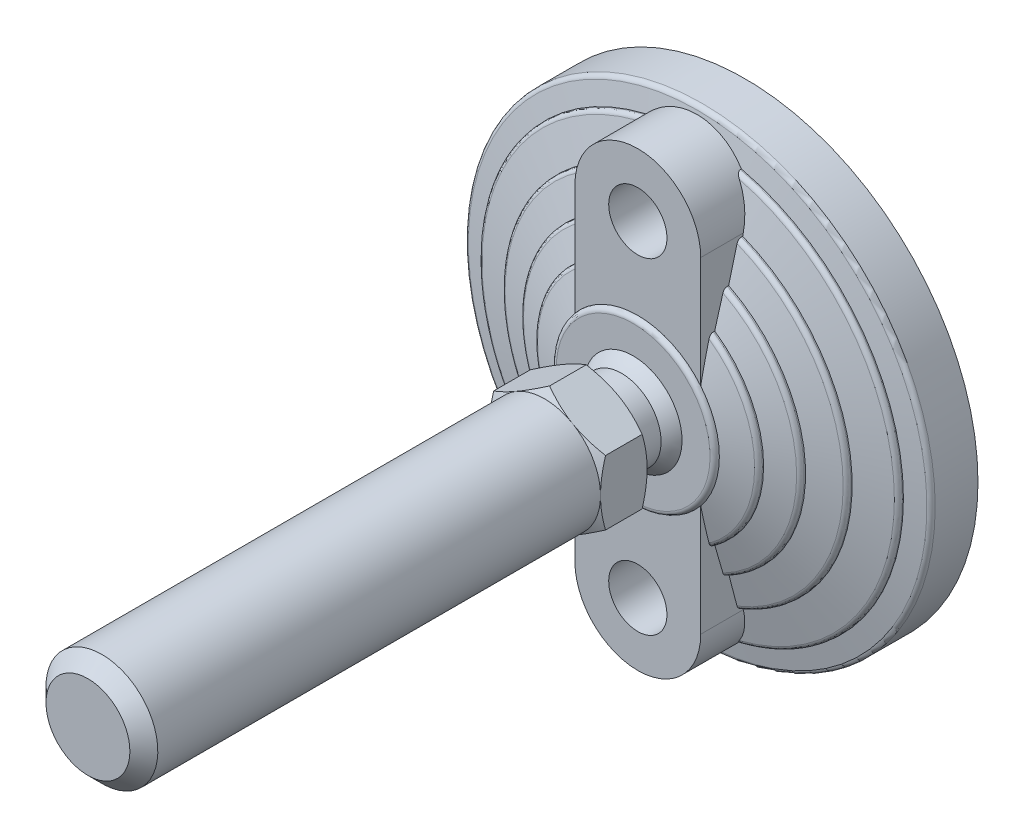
ISO-10303-21;
HEADER;
FILE_DESCRIPTION(('STEP AP214'),'2;1');
FILE_NAME('part.step','',(''),(''),'','','');
FILE_SCHEMA(('AUTOMOTIVE_DESIGN { 1 0 10303 214 1 1 1 1 }'));
ENDSEC;
DATA;
#1=APPLICATION_CONTEXT('core data for automotive mechanical design processes');
#2=APPLICATION_PROTOCOL_DEFINITION('international standard','automotive_design',2000,#1);
#3=PRODUCT_CONTEXT('',#1,'mechanical');
#4=PRODUCT('Part','Part','',(#3));
#5=PRODUCT_RELATED_PRODUCT_CATEGORY('part','',(#4));
#6=PRODUCT_DEFINITION_FORMATION('','',#4);
#7=PRODUCT_DEFINITION_CONTEXT('part definition',#1,'design');
#8=PRODUCT_DEFINITION('design','',#6,#7);
#9=PRODUCT_DEFINITION_SHAPE('','',#8);
#10=(LENGTH_UNIT() NAMED_UNIT(*) SI_UNIT(.MILLI.,.METRE.));
#11=(NAMED_UNIT(*) PLANE_ANGLE_UNIT() SI_UNIT($,.RADIAN.));
#12=(NAMED_UNIT(*) SI_UNIT($,.STERADIAN.) SOLID_ANGLE_UNIT());
#13=UNCERTAINTY_MEASURE_WITH_UNIT(LENGTH_MEASURE(1.E-05),#10,'distance_accuracy_value','');
#14=(GEOMETRIC_REPRESENTATION_CONTEXT(3) GLOBAL_UNCERTAINTY_ASSIGNED_CONTEXT((#13)) GLOBAL_UNIT_ASSIGNED_CONTEXT((#10,
#11,#12)) REPRESENTATION_CONTEXT('',''));
#15=CARTESIAN_POINT('',(0.,0.,0.));
#16=DIRECTION('',(0.,0.,1.));
#17=DIRECTION('',(1.,0.,0.));
#18=AXIS2_PLACEMENT_3D('',#15,#16,#17);
#19=CARTESIAN_POINT('',(-12.,14.022683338,33.));
#20=DIRECTION('',(0.,0.,1.));
#21=DIRECTION('',(0.,-1.,0.));
#22=AXIS2_PLACEMENT_3D('',#19,#20,#21);
#23=PLANE('',#22);
#24=CARTESIAN_POINT('',(0.,0.,33.));
#25=DIRECTION('',(0.,0.,-1.));
#26=DIRECTION('',(0.,1.,0.));
#27=AXIS2_PLACEMENT_3D('',#24,#25,#26);
#28=CIRCLE('',#27,8.5);
#29=CARTESIAN_POINT('',(0.,8.5,33.));
#30=VERTEX_POINT('',#29);
#31=EDGE_CURVE('E928',#30,#30,#28,.T.);
#32=ORIENTED_EDGE('',*,*,#31,.F.);
#33=EDGE_LOOP('',(#32));
#34=FACE_BOUND('',#33,.T.);
#35=CARTESIAN_POINT('',(0.,0.,33.));
#36=DIRECTION('',(0.,0.,1.));
#37=DIRECTION('',(0.,-1.,0.));
#38=AXIS2_PLACEMENT_3D('',#35,#36,#37);
#39=CIRCLE('',#38,12.);
#40=CARTESIAN_POINT('',(6.00000000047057,-10.3923048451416,33.));
#41=VERTEX_POINT('',#40);
#42=CARTESIAN_POINT('',(-6.00000000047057,-10.3923048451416,33.));
#43=VERTEX_POINT('',#42);
#44=EDGE_CURVE('E26',#41,#43,#39,.F.);
#45=ORIENTED_EDGE('',*,*,#44,.T.);
#46=CARTESIAN_POINT('',(-12.,0.,33.));
#47=VERTEX_POINT('',#46);
#48=EDGE_CURVE('E9',#43,#47,#39,.F.);
#49=ORIENTED_EDGE('',*,*,#48,.T.);
#50=CARTESIAN_POINT('',(-6.00000000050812,10.3923048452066,33.));
#51=VERTEX_POINT('',#50);
#52=EDGE_CURVE('E25',#47,#51,#39,.F.);
#53=ORIENTED_EDGE('',*,*,#52,.T.);
#54=CARTESIAN_POINT('',(6.00000000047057,10.3923048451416,33.));
#55=VERTEX_POINT('',#54);
#56=EDGE_CURVE('E287',#51,#55,#39,.F.);
#57=ORIENTED_EDGE('',*,*,#56,.T.);
#58=CARTESIAN_POINT('',(0.,0.,33.));
#59=DIRECTION('',(0.,0.,-1.));
#60=DIRECTION('',(0.,1.,0.));
#61=AXIS2_PLACEMENT_3D('',#58,#59,#60);
#62=CIRCLE('',#61,12.);
#63=CARTESIAN_POINT('',(12.,0.,33.));
#64=VERTEX_POINT('',#63);
#65=EDGE_CURVE('E301',#55,#64,#62,.T.);
#66=ORIENTED_EDGE('',*,*,#65,.T.);
#67=EDGE_CURVE('E310',#64,#41,#39,.F.);
#68=ORIENTED_EDGE('',*,*,#67,.T.);
#69=EDGE_LOOP('',(#45,#49,#53,#57,#66,#68));
#70=FACE_BOUND('',#69,.T.);
#71=ADVANCED_FACE('F14',(#34,#70),#23,.F.);
#72=CARTESIAN_POINT('',(0.,0.,33.));
#73=DIRECTION('',(0.,0.,-1.));
#74=DIRECTION('',(0.,1.,0.));
#75=AXIS2_PLACEMENT_3D('',#72,#73,#74);
#76=CYLINDRICAL_SURFACE('',#75,8.5);
#77=ORIENTED_EDGE('',*,*,#31,.T.);
#78=EDGE_LOOP('',(#77));
#79=FACE_BOUND('',#78,.T.);
#80=CARTESIAN_POINT('',(0.,0.,26.5000000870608));
#81=DIRECTION('',(0.,0.,-1.));
#82=DIRECTION('',(-1.,0.,0.));
#83=AXIS2_PLACEMENT_3D('',#80,#81,#82);
#84=CIRCLE('',#83,8.49999990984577);
#85=CARTESIAN_POINT('',(-8.49999990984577,0.,26.5000000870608));
#86=VERTEX_POINT('',#85);
#87=EDGE_CURVE('E924',#86,#86,#84,.T.);
#88=ORIENTED_EDGE('',*,*,#87,.F.);
#89=EDGE_LOOP('',(#88));
#90=FACE_BOUND('',#89,.T.);
#91=ADVANCED_FACE('F415',(#79,#90),#76,.T.);
#92=CARTESIAN_POINT('',(0.,0.,17.678860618));
#93=DIRECTION('',(0.,0.,-1.));
#94=DIRECTION('',(1.,0.,0.));
#95=AXIS2_PLACEMENT_3D('',#92,#93,#94);
#96=SPHERICAL_SURFACE('',#95,12.25);
#97=CARTESIAN_POINT('',(0.,0.,24.));
#98=DIRECTION('',(0.,0.,-1.));
#99=DIRECTION('',(0.,1.,0.));
#100=AXIS2_PLACEMENT_3D('',#97,#98,#99);
#101=CIRCLE('',#100,10.4931261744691);
#102=CARTESIAN_POINT('',(0.,10.4931261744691,24.));
#103=VERTEX_POINT('',#102);
#104=EDGE_CURVE('E927',#103,#103,#101,.F.);
#105=ORIENTED_EDGE('',*,*,#104,.T.);
#106=EDGE_LOOP('',(#105));
#107=FACE_BOUND('',#106,.T.);
#108=ORIENTED_EDGE('',*,*,#87,.T.);
#109=EDGE_LOOP('',(#108));
#110=FACE_BOUND('',#109,.T.);
#111=ADVANCED_FACE('F410',(#107,#110),#96,.T.);
#112=CARTESIAN_POINT('',(0.,-35.,0.));
#113=DIRECTION('',(0.,0.,1.));
#114=DIRECTION('',(0.,-1.,0.));
#115=AXIS2_PLACEMENT_3D('',#112,#113,#114);
#116=CYLINDRICAL_SURFACE('',#115,6.25);
#117=CARTESIAN_POINT('',(0.,-35.,0.));
#118=DIRECTION('',(0.,0.,1.));
#119=DIRECTION('',(0.,-1.,0.));
#120=AXIS2_PLACEMENT_3D('',#117,#118,#119);
#121=CIRCLE('',#120,6.25);
#122=CARTESIAN_POINT('',(0.,-41.25,0.));
#123=VERTEX_POINT('',#122);
#124=EDGE_CURVE('E1008',#123,#123,#121,.F.);
#125=ORIENTED_EDGE('',*,*,#124,.T.);
#126=EDGE_LOOP('',(#125));
#127=FACE_BOUND('',#126,.T.);
#128=CARTESIAN_POINT('',(0.,-35.,23.));
#129=DIRECTION('',(0.,0.,1.));
#130=DIRECTION('',(0.,-1.,0.));
#131=AXIS2_PLACEMENT_3D('',#128,#129,#130);
#132=CIRCLE('',#131,6.25);
#133=CARTESIAN_POINT('',(0.,-41.25,23.));
#134=VERTEX_POINT('',#133);
#135=EDGE_CURVE('E901',#134,#134,#132,.T.);
#136=ORIENTED_EDGE('',*,*,#135,.T.);
#137=EDGE_LOOP('',(#136));
#138=FACE_BOUND('',#137,.T.);
#139=ADVANCED_FACE('F414',(#127,#138),#116,.F.);
#140=CARTESIAN_POINT('',(-16.755457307,-16.698,24.));
#141=DIRECTION('',(0.,0.,-1.));
#142=DIRECTION('',(0.,1.,0.));
#143=AXIS2_PLACEMENT_3D('',#140,#141,#142);
#144=PLANE('',#143);
#145=ORIENTED_EDGE('',*,*,#104,.F.);
#146=EDGE_LOOP('',(#145));
#147=FACE_BOUND('',#146,.T.);
#148=CARTESIAN_POINT('',(0.,0.,24.));
#149=DIRECTION('',(0.,0.,-1.));
#150=DIRECTION('',(0.,1.,0.));
#151=AXIS2_PLACEMENT_3D('',#148,#149,#150);
#152=CIRCLE('',#151,16.5);
#153=CARTESIAN_POINT('',(0.,16.5,24.));
#154=VERTEX_POINT('',#153);
#155=EDGE_CURVE('E900',#154,#154,#152,.T.);
#156=ORIENTED_EDGE('',*,*,#155,.F.);
#157=EDGE_LOOP('',(#156));
#158=FACE_BOUND('',#157,.T.);
#159=ADVANCED_FACE('F420',(#147,#158),#144,.F.);
#160=CARTESIAN_POINT('',(-50.774113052,50.6,0.));
#161=DIRECTION('',(0.,0.,1.));
#162=DIRECTION('',(0.,-1.,0.));
#163=AXIS2_PLACEMENT_3D('',#160,#161,#162);
#164=PLANE('',#163);
#165=ORIENTED_EDGE('',*,*,#124,.F.);
#166=EDGE_LOOP('',(#165));
#167=FACE_BOUND('',#166,.T.);
#168=CARTESIAN_POINT('',(0.,35.,0.));
#169=DIRECTION('',(0.,0.,1.));
#170=DIRECTION('',(0.,-1.,0.));
#171=AXIS2_PLACEMENT_3D('',#168,#169,#170);
#172=CIRCLE('',#171,6.25);
#173=CARTESIAN_POINT('',(0.,28.75,0.));
#174=VERTEX_POINT('',#173);
#175=EDGE_CURVE('E970',#174,#174,#172,.T.);
#176=ORIENTED_EDGE('',*,*,#175,.T.);
#177=EDGE_LOOP('',(#176));
#178=FACE_BOUND('',#177,.T.);
#179=CARTESIAN_POINT('',(0.,0.,0.));
#180=DIRECTION('',(0.,0.,-1.));
#181=DIRECTION('',(1.,0.,0.));
#182=AXIS2_PLACEMENT_3D('',#179,#180,#181);
#183=CIRCLE('',#182,50.);
#184=CARTESIAN_POINT('',(50.,0.,0.));
#185=VERTEX_POINT('',#184);
#186=EDGE_CURVE('E454',#185,#185,#183,.F.);
#187=ORIENTED_EDGE('',*,*,#186,.F.);
#188=EDGE_LOOP('',(#187));
#189=FACE_BOUND('',#188,.T.);
#190=ADVANCED_FACE('F427',(#167,#178,#189),#164,.F.);
#191=CARTESIAN_POINT('',(0.,0.,23.));
#192=DIRECTION('',(0.,0.,-1.));
#193=DIRECTION('',(0.,1.,0.));
#194=AXIS2_PLACEMENT_3D('',#191,#192,#193);
#195=CONICAL_SURFACE('',#194,17.5,1.27229739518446);
#196=CARTESIAN_POINT('',(0.,0.,23.));
#197=DIRECTION('',(0.,0.,1.));
#198=DIRECTION('',(0.,-1.,0.));
#199=AXIS2_PLACEMENT_3D('',#196,#197,#198);
#200=CIRCLE('',#199,17.5);
#201=CARTESIAN_POINT('',(13.5000000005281,-11.1355287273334,22.999999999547));
#202=VERTEX_POINT('',#201);
#203=CARTESIAN_POINT('',(13.5000000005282,11.1355287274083,22.9999999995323));
#204=VERTEX_POINT('',#203);
#205=EDGE_CURVE('E897',#202,#204,#200,.T.);
#206=ORIENTED_EDGE('',*,*,#205,.F.);
#207=CARTESIAN_POINT('',(13.5,-18.9832672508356,21.2172043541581));
#208=CARTESIAN_POINT('',(13.5,-18.6579649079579,21.2987714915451));
#209=CARTESIAN_POINT('',(13.5,-18.3324976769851,21.3796813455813));
#210=CARTESIAN_POINT('',(13.5,-17.6811977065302,21.5400241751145));
#211=CARTESIAN_POINT('',(13.5,-17.3553649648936,21.6194571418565));
#212=CARTESIAN_POINT('',(13.5,-16.3773825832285,21.8552688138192));
#213=CARTESIAN_POINT('',(13.5,-15.7246371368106,22.0091884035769));
#214=CARTESIAN_POINT('',(13.5,-14.4172126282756,22.3088363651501));
#215=CARTESIAN_POINT('',(13.5,-13.7625334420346,22.4545641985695));
#216=CARTESIAN_POINT('',(13.5,-12.7787974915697,22.6654071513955));
#217=CARTESIAN_POINT('',(13.5,-12.4505717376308,22.7344021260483));
#218=CARTESIAN_POINT('',(13.5,-11.7935144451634,22.8694734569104));
#219=CARTESIAN_POINT('',(13.5,-11.4646828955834,22.9355497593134));
#220=CARTESIAN_POINT('',(13.5,-11.1355287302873,22.999999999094));
#221=B_SPLINE_CURVE_WITH_KNOTS('',3,(#207,#208,#209,#210,#211,#212,#213,#214,#215,#216,#217,
#218,#219,#220),.UNSPECIFIED.,.F.,.F.,(4,2,2,2,2,2,4),(0.,1.00611699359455,2.01223994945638,
4.02414047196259,6.03617307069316,7.04235800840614,8.04856148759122),.UNSPECIFIED.);
#222=CARTESIAN_POINT('',(13.5,-18.9832672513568,21.2172043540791));
#223=VERTEX_POINT('',#222);
#224=EDGE_CURVE('E444',#223,#202,#221,.T.);
#225=ORIENTED_EDGE('',*,*,#224,.F.);
#226=CARTESIAN_POINT('',(3.16437848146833E-10,0.,21.217204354));
#227=DIRECTION('',(0.,0.,-1.));
#228=DIRECTION('',(0.,1.,0.));
#229=AXIS2_PLACEMENT_3D('',#226,#227,#228);
#230=CIRCLE('',#229,23.2940858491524);
#231=CARTESIAN_POINT('',(13.5,18.983267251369,21.2172043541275));
#232=VERTEX_POINT('',#231);
#233=EDGE_CURVE('E407',#232,#223,#230,.T.);
#234=ORIENTED_EDGE('',*,*,#233,.F.);
#235=CARTESIAN_POINT('',(13.5,11.1355287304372,22.9999999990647));
#236=CARTESIAN_POINT('',(13.5,11.4646828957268,22.9355497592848));
#237=CARTESIAN_POINT('',(13.5,11.7935144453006,22.8694734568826));
#238=CARTESIAN_POINT('',(13.5,12.4505717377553,22.7344021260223));
#239=CARTESIAN_POINT('',(13.5,12.7787974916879,22.6654071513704));
#240=CARTESIAN_POINT('',(13.5,13.762533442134,22.4545641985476));
#241=CARTESIAN_POINT('',(13.5,14.4172126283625,22.3088363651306));
#242=CARTESIAN_POINT('',(13.5,15.7246371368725,22.0091884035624));
#243=CARTESIAN_POINT('',(13.5,16.377382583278,21.8552688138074));
#244=CARTESIAN_POINT('',(13.5,17.3553649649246,21.619457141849));
#245=CARTESIAN_POINT('',(13.5,17.681197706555,21.5400241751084));
#246=CARTESIAN_POINT('',(13.5,18.3324976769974,21.3796813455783));
#247=CARTESIAN_POINT('',(13.5,18.6579649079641,21.2987714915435));
#248=CARTESIAN_POINT('',(13.5,18.9832672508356,21.2172043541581));
#249=B_SPLINE_CURVE_WITH_KNOTS('',3,(#235,#236,#237,#238,#239,#240,#241,#242,#243,#244,#245,
#246,#247,#248),.UNSPECIFIED.,.F.,.F.,(4,2,2,2,2,2,4),(0.,1.00620347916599,2.01238841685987,
4.02442101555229,6.03632153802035,7.0424444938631,8.04856148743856),.UNSPECIFIED.);
#250=EDGE_CURVE('E435',#204,#232,#249,.T.);
#251=ORIENTED_EDGE('',*,*,#250,.F.);
#252=EDGE_LOOP('',(#206,#225,#234,#251));
#253=FACE_BOUND('',#252,.T.);
#254=ADVANCED_FACE('F422',(#253),#195,.T.);
#255=CARTESIAN_POINT('',(13.267303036,19.999466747,20.261425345));
#256=CARTESIAN_POINT('',(29.097194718,9.49818825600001,20.261425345));
#257=CARTESIAN_POINT('',(29.097194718,-9.49818825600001,20.261425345));
#258=CARTESIAN_POINT('',(13.267303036,-19.999466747,20.261425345));
#259=CARTESIAN_POINT('',(13.267303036,19.999466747,20.716888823));
#260=CARTESIAN_POINT('',(29.097194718,9.498188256,20.716888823));
#261=CARTESIAN_POINT('',(29.097194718,-9.498188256,20.716888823));
#262=CARTESIAN_POINT('',(13.267303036,-19.999466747,20.716888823));
#263=CARTESIAN_POINT('',(13.117718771,19.773979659,21.083258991));
#264=CARTESIAN_POINT('',(28.769133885,9.39109946,21.083258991));
#265=CARTESIAN_POINT('',(28.769133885,-9.39109946,21.083258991));
#266=CARTESIAN_POINT('',(13.117718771,-19.773979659,21.083258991));
#267=CARTESIAN_POINT('',(12.877070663,19.411220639,21.217204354));
#268=CARTESIAN_POINT('',(28.241356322,9.218817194,21.217204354));
#269=CARTESIAN_POINT('',(28.241356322,-9.218817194,21.217204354));
#270=CARTESIAN_POINT('',(12.877070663,-19.411220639,21.217204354));
#271=(BOUNDED_SURFACE() B_SPLINE_SURFACE(3,3,((#255,#256,#257,#258),(#259,#260,#261,#262),(#263,
#264,#265,#266),(#267,#268,#269,#270)),.UNSPECIFIED.,.F.,.F.,
.F.) B_SPLINE_SURFACE_WITH_KNOTS((4,4),(4,4),(0.,1.),(0.,1.),
.UNSPECIFIED.) GEOMETRIC_REPRESENTATION_ITEM() RATIONAL_B_SPLINE_SURFACE(((1.,0.701869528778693,
0.701869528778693,1.),(0.869593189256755,0.6103409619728,0.6103409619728,0.869593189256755),
(0.869593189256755,0.6103409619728,0.6103409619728,0.869593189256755),(1.,0.701869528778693,
0.701869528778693,1.))) REPRESENTATION_ITEM('') SURFACE());
#272=CARTESIAN_POINT('',(13.5,-19.8431348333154,20.2614253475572));
#273=CARTESIAN_POINT('',(13.5,-19.8431370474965,20.2860556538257));
#274=CARTESIAN_POINT('',(13.5,-19.8420333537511,20.3106726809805));
#275=CARTESIAN_POINT('',(13.5,-19.8376465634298,20.3597018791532));
#276=CARTESIAN_POINT('',(13.5,-19.8343643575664,20.3841141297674));
#277=CARTESIAN_POINT('',(13.5,-19.8213486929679,20.4565201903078));
#278=CARTESIAN_POINT('',(13.5,-19.8084453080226,20.5039784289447));
#279=CARTESIAN_POINT('',(13.5,-19.7748969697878,20.5959548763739));
#280=CARTESIAN_POINT('',(13.5,-19.7542611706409,20.6404764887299));
#281=CARTESIAN_POINT('',(13.5,-19.7062220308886,20.7257350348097));
#282=CARTESIAN_POINT('',(13.5,-19.6788120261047,20.7664681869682));
#283=CARTESIAN_POINT('',(13.5,-19.6164784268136,20.8458096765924));
#284=CARTESIAN_POINT('',(13.5,-19.5811980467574,20.8841360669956));
#285=CARTESIAN_POINT('',(13.5,-19.5055204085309,20.9553392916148));
#286=CARTESIAN_POINT('',(13.5,-19.465120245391,20.9882130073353));
#287=CARTESIAN_POINT('',(13.5,-19.3733614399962,21.0532792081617));
#288=CARTESIAN_POINT('',(13.5,-19.321293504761,21.0844693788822));
#289=CARTESIAN_POINT('',(13.5,-19.2133323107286,21.139175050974));
#290=CARTESIAN_POINT('',(13.5,-19.1574401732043,21.1626927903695));
#291=CARTESIAN_POINT('',(13.5,-19.0617819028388,21.1957297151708));
#292=CARTESIAN_POINT('',(13.5,-19.022719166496,21.207311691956));
#293=CARTESIAN_POINT('',(13.5,-18.9832672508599,21.2172043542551));
#294=B_SPLINE_CURVE_WITH_KNOTS('',3,(#272,#273,#274,#275,#276,#277,#278,#279,#280,#281,#282,
#283,#284,#285,#286,#287,#288,#289,#290,#291,#292,#293),.UNSPECIFIED.,.F.,.F.,(4,2,2,2,2,2,2,2,
2,2,4),(0.,0.0738405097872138,0.147650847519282,0.29439860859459,0.440973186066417,
0.587692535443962,0.743377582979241,0.89915136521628,1.08055916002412,1.26191399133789,
1.38396481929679),.UNSPECIFIED.);
#295=CARTESIAN_POINT('',(13.5,-19.8431348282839,20.2614253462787));
#296=VERTEX_POINT('',#295);
#297=EDGE_CURVE('E487',#296,#223,#294,.T.);
#298=CARTESIAN_POINT('',(0.,0.,20.261425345));
#299=DIRECTION('',(0.,0.,-1.));
#300=DIRECTION('',(0.,1.,0.));
#301=AXIS2_PLACEMENT_3D('',#298,#299,#300);
#302=CIRCLE('',#301,24.);
#303=CARTESIAN_POINT('',(13.5,19.8431348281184,20.2614253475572));
#304=VERTEX_POINT('',#303);
#305=EDGE_CURVE('E922',#304,#296,#302,.T.);
#306=CARTESIAN_POINT('',(13.5,18.9832672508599,21.2172043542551));
#307=CARTESIAN_POINT('',(13.5,19.0245269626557,21.2068474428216));
#308=CARTESIAN_POINT('',(13.5,19.0653049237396,21.1946763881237));
#309=CARTESIAN_POINT('',(13.5,19.1456358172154,21.1665827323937));
#310=CARTESIAN_POINT('',(13.5,19.1851861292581,21.1506526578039));
#311=CARTESIAN_POINT('',(13.5,19.3016874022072,21.0969581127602));
#312=CARTESIAN_POINT('',(13.5,19.3761277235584,21.0533765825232));
#313=CARTESIAN_POINT('',(13.5,19.4913457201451,20.9675664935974));
#314=CARTESIAN_POINT('',(13.5,19.5352290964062,20.9294496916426));
#315=CARTESIAN_POINT('',(13.5,19.6161219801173,20.8466003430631));
#316=CARTESIAN_POINT('',(13.5,19.6531483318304,20.8018845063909));
#317=CARTESIAN_POINT('',(13.5,19.7189344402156,20.7060840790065));
#318=CARTESIAN_POINT('',(13.5,19.747615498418,20.6549449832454));
#319=CARTESIAN_POINT('',(13.5,19.7944064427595,20.5480322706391));
#320=CARTESIAN_POINT('',(13.5,19.8125331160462,20.4922661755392));
#321=CARTESIAN_POINT('',(13.5,19.8308153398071,20.4067306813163));
#322=CARTESIAN_POINT('',(13.5,19.8354249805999,20.3778585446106));
#323=CARTESIAN_POINT('',(13.5,19.8415861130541,20.3198066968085));
#324=CARTESIAN_POINT('',(13.5,19.8431393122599,20.2906271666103));
#325=CARTESIAN_POINT('',(13.5,19.8431348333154,20.2614253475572));
#326=B_SPLINE_CURVE_WITH_KNOTS('',3,(#306,#307,#308,#309,#310,#311,#312,#313,#314,#315,#316,
#317,#318,#319,#320,#321,#322,#323,#324,#325),.UNSPECIFIED.,.F.,.F.,(4,2,2,2,2,2,2,2,2,4),(0.,
0.127516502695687,0.255288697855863,0.511930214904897,0.685657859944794,0.858952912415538,
1.03383282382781,1.20843381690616,1.296004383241,1.38352601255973),.UNSPECIFIED.);
#327=EDGE_CURVE('E561',#232,#304,#326,.T.);
#328=ORIENTED_EDGE('',*,*,#233,.T.);
#329=ORIENTED_EDGE('',*,*,#297,.F.);
#330=ORIENTED_EDGE('',*,*,#305,.F.);
#331=ORIENTED_EDGE('',*,*,#327,.F.);
#332=EDGE_LOOP('',(#328,#329,#330,#331));
#333=FACE_BOUND('',#332,.T.);
#334=ADVANCED_FACE('F426',(#333),#271,.T.);
#335=CARTESIAN_POINT('',(0.,0.,20.261425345));
#336=DIRECTION('',(0.,0.,-1.));
#337=DIRECTION('',(0.,1.,0.));
#338=AXIS2_PLACEMENT_3D('',#335,#336,#337);
#339=CYLINDRICAL_SURFACE('',#338,24.);
#340=CARTESIAN_POINT('',(0.,0.,20.));
#341=DIRECTION('',(0.,0.,-1.));
#342=DIRECTION('',(0.,1.,0.));
#343=AXIS2_PLACEMENT_3D('',#340,#341,#342);
#344=CIRCLE('',#343,24.);
#345=CARTESIAN_POINT('',(13.5,19.8431348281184,20.));
#346=VERTEX_POINT('',#345);
#347=CARTESIAN_POINT('',(13.5,-19.8431348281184,20.0000000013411));
#348=VERTEX_POINT('',#347);
#349=EDGE_CURVE('E920',#346,#348,#344,.T.);
#350=ORIENTED_EDGE('',*,*,#349,.F.);
#351=DIRECTION('',(0.,0.,-1.));
#352=VECTOR('',#351,1.);
#353=CARTESIAN_POINT('',(13.5,19.8431348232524,18.4084486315));
#354=LINE('',#353,#352);
#355=EDGE_CURVE('E582',#304,#346,#354,.T.);
#356=ORIENTED_EDGE('',*,*,#355,.F.);
#357=ORIENTED_EDGE('',*,*,#305,.T.);
#358=DIRECTION('',(0.,0.,1.));
#359=VECTOR('',#358,1.);
#360=CARTESIAN_POINT('',(13.5,-19.8431348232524,18.4084486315));
#361=LINE('',#360,#359);
#362=EDGE_CURVE('E978',#348,#296,#361,.T.);
#363=ORIENTED_EDGE('',*,*,#362,.F.);
#364=EDGE_LOOP('',(#350,#356,#357,#363));
#365=FACE_BOUND('',#364,.T.);
#366=ADVANCED_FACE('F587',(#365),#339,.T.);
#367=CARTESIAN_POINT('',(0.,0.,20.));
#368=DIRECTION('',(0.,0.,-1.));
#369=DIRECTION('',(1.,0.,0.));
#370=AXIS2_PLACEMENT_3D('',#367,#368,#369);
#371=CONICAL_SURFACE('',#370,24.,1.24904577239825);
#372=ORIENTED_EDGE('',*,*,#349,.T.);
#373=CARTESIAN_POINT('',(13.5,-26.022897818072,18.2279240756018));
#374=CARTESIAN_POINT('',(13.5,-25.5091656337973,18.3799212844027));
#375=CARTESIAN_POINT('',(13.5,-24.9951778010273,18.5310587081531));
#376=CARTESIAN_POINT('',(13.5,-23.9666187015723,18.8312926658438));
#377=CARTESIAN_POINT('',(13.5,-23.4520474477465,18.9803892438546));
#378=CARTESIAN_POINT('',(13.5,-22.4222240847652,19.2762276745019));
#379=CARTESIAN_POINT('',(13.5,-21.9069719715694,19.422969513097));
#380=CARTESIAN_POINT('',(13.5,-20.8756730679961,19.713675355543));
#381=CARTESIAN_POINT('',(13.5,-20.3596262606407,19.8576392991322));
#382=CARTESIAN_POINT('',(13.5,-19.8431348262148,20.0000000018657));
#383=B_SPLINE_CURVE_WITH_KNOTS('',3,(#373,#374,#375,#376,#377,#378,#379,#380,#381,#382),
.UNSPECIFIED.,.F.,.F.,(4,2,2,2,4),(0.,1.60723934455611,3.21444392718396,4.82165809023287,
6.42890708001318),.UNSPECIFIED.);
#384=CARTESIAN_POINT('',(13.5,-26.0228978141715,18.2279240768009));
#385=VERTEX_POINT('',#384);
#386=EDGE_CURVE('E495',#385,#348,#383,.T.);
#387=ORIENTED_EDGE('',*,*,#386,.F.);
#388=CARTESIAN_POINT('',(-5.51340223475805E-10,0.,18.227924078));
#389=DIRECTION('',(0.,0.,-1.));
#390=DIRECTION('',(0.,1.,0.));
#391=AXIS2_PLACEMENT_3D('',#388,#389,#390);
#392=CIRCLE('',#391,29.3162277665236);
#393=CARTESIAN_POINT('',(13.5,26.0228978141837,18.2279240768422));
#394=VERTEX_POINT('',#393);
#395=EDGE_CURVE('E919',#394,#385,#392,.T.);
#396=ORIENTED_EDGE('',*,*,#395,.F.);
#397=CARTESIAN_POINT('',(13.5000000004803,19.8431348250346,20.0000000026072));
#398=CARTESIAN_POINT('',(13.5000000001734,20.3596262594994,19.8576392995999));
#399=CARTESIAN_POINT('',(13.5000000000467,20.8756730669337,19.7136753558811));
#400=CARTESIAN_POINT('',(13.4999999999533,21.9069719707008,19.4229695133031));
#401=CARTESIAN_POINT('',(13.4999999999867,22.4222240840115,19.2762276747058));
#402=CARTESIAN_POINT('',(13.5000000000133,23.4520474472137,18.9803892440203));
#403=CARTESIAN_POINT('',(13.5000000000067,23.9666187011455,18.8312926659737));
#404=CARTESIAN_POINT('',(13.4999999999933,24.9951778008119,18.5310587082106));
#405=CARTESIAN_POINT('',(13.4999999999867,25.5091656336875,18.3799212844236));
#406=CARTESIAN_POINT('',(13.5,26.022897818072,18.2279240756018));
#407=B_SPLINE_CURVE_WITH_KNOTS('',3,(#397,#398,#399,#400,#401,#402,#403,#404,#405,#406),
.UNSPECIFIED.,.F.,.F.,(4,2,2,2,4),(0.,1.60724899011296,3.2144631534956,4.82166773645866,
6.42890708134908),.UNSPECIFIED.);
#408=EDGE_CURVE('E576',#346,#394,#407,.T.);
#409=ORIENTED_EDGE('',*,*,#408,.F.);
#410=EDGE_LOOP('',(#372,#387,#396,#409));
#411=FACE_BOUND('',#410,.T.);
#412=ADVANCED_FACE('F583',(#411),#371,.T.);
#413=CARTESIAN_POINT('',(13.143890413,26.967353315,17.27924078));
#414=CARTESIAN_POINT('',(38.983891,14.372934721,17.27924078));
#415=CARTESIAN_POINT('',(38.983891,-14.372934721,17.27924078));
#416=CARTESIAN_POINT('',(13.143890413,-26.967353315,17.27924078));
#417=CARTESIAN_POINT('',(13.143890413,26.967353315,17.725161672));
#418=CARTESIAN_POINT('',(38.983891,14.372934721,17.725161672));
#419=CARTESIAN_POINT('',(38.983891,-14.372934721,17.725161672));
#420=CARTESIAN_POINT('',(13.143890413,-26.967353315,17.725161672));
#421=CARTESIAN_POINT('',(13.029654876,26.732975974,18.086911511));
#422=CARTESIAN_POINT('',(38.645076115,14.248017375,18.086911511));
#423=CARTESIAN_POINT('',(38.645076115,-14.248017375,18.086911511));
#424=CARTESIAN_POINT('',(13.029654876,-26.732975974,18.086911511));
#425=CARTESIAN_POINT('',(12.844309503,26.352702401,18.227924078));
#426=CARTESIAN_POINT('',(38.095354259,14.045340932,18.227924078));
#427=CARTESIAN_POINT('',(38.095354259,-14.045340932,18.227924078));
#428=CARTESIAN_POINT('',(12.844309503,-26.352702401,18.227924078));
#429=(BOUNDED_SURFACE() B_SPLINE_SURFACE(3,3,((#413,#414,#415,#416),(#417,#418,#419,#420),(#421,
#422,#423,#424),(#425,#426,#427,#428)),.UNSPECIFIED.,.F.,.F.,
.F.) B_SPLINE_SURFACE_WITH_KNOTS((4,4),(4,4),(0.,1.),(0.,1.),
.UNSPECIFIED.) GEOMETRIC_REPRESENTATION_ITEM() RATIONAL_B_SPLINE_SURFACE(((1.,0.625419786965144,
0.625419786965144,1.),(0.874161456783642,0.546717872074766,0.546717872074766,0.874161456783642),
(0.874161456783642,0.546717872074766,0.546717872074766,0.874161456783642),(1.,0.625419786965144,
0.625419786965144,1.))) REPRESENTATION_ITEM('') SURFACE());
#430=CARTESIAN_POINT('',(13.5,-26.7908566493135,17.2792407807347));
#431=CARTESIAN_POINT('',(13.5,-26.7908579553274,17.3051907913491));
#432=CARTESIAN_POINT('',(13.5,-26.7897247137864,17.3311275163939));
#433=CARTESIAN_POINT('',(13.5,-26.7852140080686,17.3827974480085));
#434=CARTESIAN_POINT('',(13.5,-26.781837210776,17.4085307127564));
#435=CARTESIAN_POINT('',(13.5,-26.7684139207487,17.4849772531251));
#436=CARTESIAN_POINT('',(13.5,-26.7550740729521,17.5351491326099));
#437=CARTESIAN_POINT('',(13.5,-26.7202107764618,17.632486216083));
#438=CARTESIAN_POINT('',(13.5,-26.6986916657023,17.6796529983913));
#439=CARTESIAN_POINT('',(13.5,-26.648348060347,17.7699105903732));
#440=CARTESIAN_POINT('',(13.5,-26.6195218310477,17.8130004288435));
#441=CARTESIAN_POINT('',(13.5,-26.5542840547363,17.8959059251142));
#442=CARTESIAN_POINT('',(13.5,-26.5176080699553,17.9355124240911));
#443=CARTESIAN_POINT('',(13.5,-26.4386436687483,18.0087234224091));
#444=CARTESIAN_POINT('',(13.5,-26.3963509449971,18.0423232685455));
#445=CARTESIAN_POINT('',(13.5,-26.3267001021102,18.0898793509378));
#446=CARTESIAN_POINT('',(13.5,-26.3008113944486,18.106038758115));
#447=CARTESIAN_POINT('',(13.5,-26.2478537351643,18.1362297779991));
#448=CARTESIAN_POINT('',(13.5,-26.2207861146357,18.1502637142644));
#449=CARTESIAN_POINT('',(13.5,-26.1657188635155,18.176151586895));
#450=CARTESIAN_POINT('',(13.5,-26.1377218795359,18.1880111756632));
#451=CARTESIAN_POINT('',(13.5,-26.0808891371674,18.2095853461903));
#452=CARTESIAN_POINT('',(13.5,-26.0520527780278,18.2192983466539));
#453=CARTESIAN_POINT('',(13.5,-26.0228978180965,18.2279240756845));
#454=B_SPLINE_CURVE_WITH_KNOTS('',3,(#430,#431,#432,#433,#434,#435,#436,#437,#438,#439,#440,
#441,#442,#443,#444,#445,#446,#447,#448,#449,#450,#451,#452,#453),.UNSPECIFIED.,.F.,.F.,(4,2,2,
2,2,2,2,2,2,2,2,4),(0.,0.0777993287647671,0.155575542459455,0.310500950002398,0.465344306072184,
0.620224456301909,0.781511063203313,0.942922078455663,1.03439248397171,1.12576216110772,
1.21689083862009,1.30808642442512),.UNSPECIFIED.);
#455=CARTESIAN_POINT('',(13.5,-26.7908566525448,17.27924078));
#456=VERTEX_POINT('',#455);
#457=EDGE_CURVE('E503',#456,#385,#454,.T.);
#458=CARTESIAN_POINT('',(0.,0.,17.27924078));
#459=DIRECTION('',(0.,0.,-1.));
#460=DIRECTION('',(0.,1.,0.));
#461=AXIS2_PLACEMENT_3D('',#458,#459,#460);
#462=CIRCLE('',#461,30.);
#463=CARTESIAN_POINT('',(13.5,26.7908566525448,17.2792407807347));
#464=VERTEX_POINT('',#463);
#465=EDGE_CURVE('E917',#464,#456,#462,.T.);
#466=CARTESIAN_POINT('',(13.5,26.0228978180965,18.2279240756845));
#467=CARTESIAN_POINT('',(13.5,26.0845570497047,18.2097134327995));
#468=CARTESIAN_POINT('',(13.5,26.1448460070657,18.1865640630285));
#469=CARTESIAN_POINT('',(13.5,26.2611194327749,18.1305926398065));
#470=CARTESIAN_POINT('',(13.5,26.3170802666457,18.0977216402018));
#471=CARTESIAN_POINT('',(13.5,26.422621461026,18.022592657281));
#472=CARTESIAN_POINT('',(13.5,26.4721821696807,17.9803067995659));
#473=CARTESIAN_POINT('',(13.5,26.5625156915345,17.887307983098));
#474=CARTESIAN_POINT('',(13.5,26.6033065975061,17.8366127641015));
#475=CARTESIAN_POINT('',(13.5,26.6708532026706,17.7331354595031));
#476=CARTESIAN_POINT('',(13.5,26.6985518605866,17.68096918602));
#477=CARTESIAN_POINT('',(13.5,26.743619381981,17.5723560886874));
#478=CARTESIAN_POINT('',(13.5,26.7610021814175,17.5159151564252));
#479=CARTESIAN_POINT('',(13.5,26.7787549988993,17.4289072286));
#480=CARTESIAN_POINT('',(13.5,26.7832876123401,17.399138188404));
#481=CARTESIAN_POINT('',(13.5,26.78933789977,17.3393328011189));
#482=CARTESIAN_POINT('',(13.5,26.7908592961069,17.3092968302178));
#483=CARTESIAN_POINT('',(13.5,26.7908566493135,17.2792407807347));
#484=B_SPLINE_CURVE_WITH_KNOTS('',3,(#466,#467,#468,#469,#470,#471,#472,#473,#474,#475,#476,
#477,#478,#479,#480,#481,#482,#483),.UNSPECIFIED.,.F.,.F.,(4,2,2,2,2,2,2,2,4),(0.,
0.192810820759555,0.386609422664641,0.580989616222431,0.77496485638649,0.951184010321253,
1.12716456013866,1.21736691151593,1.30745768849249),.UNSPECIFIED.);
#485=EDGE_CURVE('E543',#394,#464,#484,.T.);
#486=ORIENTED_EDGE('',*,*,#395,.T.);
#487=ORIENTED_EDGE('',*,*,#457,.F.);
#488=ORIENTED_EDGE('',*,*,#465,.F.);
#489=ORIENTED_EDGE('',*,*,#485,.F.);
#490=EDGE_LOOP('',(#486,#487,#488,#489));
#491=FACE_BOUND('',#490,.T.);
#492=ADVANCED_FACE('F586',(#491),#429,.T.);
#493=CARTESIAN_POINT('',(0.,0.,17.27924078));
#494=DIRECTION('',(0.,0.,-1.));
#495=DIRECTION('',(0.,1.,0.));
#496=AXIS2_PLACEMENT_3D('',#493,#494,#495);
#497=CYLINDRICAL_SURFACE('',#496,30.);
#498=CARTESIAN_POINT('',(0.,0.,17.));
#499=DIRECTION('',(0.,0.,-1.));
#500=DIRECTION('',(0.,1.,0.));
#501=AXIS2_PLACEMENT_3D('',#498,#499,#500);
#502=CIRCLE('',#501,30.);
#503=CARTESIAN_POINT('',(13.5,26.7908566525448,17.));
#504=VERTEX_POINT('',#503);
#505=CARTESIAN_POINT('',(13.5,-26.7908566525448,16.9999999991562));
#506=VERTEX_POINT('',#505);
#507=EDGE_CURVE('E915',#504,#506,#502,.T.);
#508=ORIENTED_EDGE('',*,*,#507,.F.);
#509=DIRECTION('',(0.,0.,-1.));
#510=VECTOR('',#509,1.);
#511=CARTESIAN_POINT('',(13.5,26.7908566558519,18.4084486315));
#512=LINE('',#511,#510);
#513=EDGE_CURVE('E538',#464,#504,#512,.T.);
#514=ORIENTED_EDGE('',*,*,#513,.F.);
#515=ORIENTED_EDGE('',*,*,#465,.T.);
#516=DIRECTION('',(0.,0.,1.));
#517=VECTOR('',#516,1.);
#518=CARTESIAN_POINT('',(13.5,-26.7908566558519,18.4084486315));
#519=LINE('',#518,#517);
#520=EDGE_CURVE('E516',#506,#456,#519,.T.);
#521=ORIENTED_EDGE('',*,*,#520,.F.);
#522=EDGE_LOOP('',(#508,#514,#515,#521));
#523=FACE_BOUND('',#522,.T.);
#524=ADVANCED_FACE('F522',(#523),#497,.T.);
#525=CARTESIAN_POINT('',(0.,0.,17.));
#526=DIRECTION('',(0.,0.,-1.));
#527=DIRECTION('',(0.,1.,0.));
#528=AXIS2_PLACEMENT_3D('',#525,#526,#527);
#529=CONICAL_SURFACE('',#528,30.,1.29249666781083);
#530=ORIENTED_EDGE('',*,*,#507,.T.);
#531=CARTESIAN_POINT('',(13.5000000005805,-33.6690568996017,15.2072225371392));
#532=CARTESIAN_POINT('',(13.5000000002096,-33.0965095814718,15.3590521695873));
#533=CARTESIAN_POINT('',(13.5000000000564,-32.5238313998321,15.5103895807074));
#534=CARTESIAN_POINT('',(13.4999999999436,-31.3781752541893,15.8119124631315));
#535=CARTESIAN_POINT('',(13.4999999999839,-30.8051972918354,15.9620979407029));
#536=CARTESIAN_POINT('',(13.5000000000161,-29.6588964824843,16.2611513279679));
#537=CARTESIAN_POINT('',(13.5000000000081,-29.0855736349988,16.4100192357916));
#538=CARTESIAN_POINT('',(13.4999999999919,-27.9385277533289,16.7062178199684));
#539=CARTESIAN_POINT('',(13.4999999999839,-27.3648047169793,16.8535484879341));
#540=CARTESIAN_POINT('',(13.5,-26.7908566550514,16.9999999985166));
#541=B_SPLINE_CURVE_WITH_KNOTS('',3,(#531,#532,#533,#534,#535,#536,#537,#538,#539,#540),
.UNSPECIFIED.,.F.,.F.,(4,2,2,2,4),(0.,1.7770100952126,3.55401051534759,5.33101345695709,
7.10802608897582),.UNSPECIFIED.);
#542=CARTESIAN_POINT('',(13.5,-33.6690569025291,15.2072225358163));
#543=VERTEX_POINT('',#542);
#544=EDGE_CURVE('E509',#543,#506,#541,.T.);
#545=ORIENTED_EDGE('',*,*,#544,.F.);
#546=CARTESIAN_POINT('',(3.08438170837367E-10,0.,15.207222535));
#547=DIRECTION('',(0.,0.,-1.));
#548=DIRECTION('',(0.,1.,0.));
#549=AXIS2_PLACEMENT_3D('',#546,#547,#548);
#550=CIRCLE('',#549,36.2747211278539);
#551=CARTESIAN_POINT('',(13.5,33.6690569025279,15.2072225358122));
#552=VERTEX_POINT('',#551);
#553=EDGE_CURVE('E914',#552,#543,#550,.T.);
#554=ORIENTED_EDGE('',*,*,#553,.F.);
#555=CARTESIAN_POINT('',(13.5000000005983,26.790856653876,16.9999999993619));
#556=CARTESIAN_POINT('',(13.5000000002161,27.3648047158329,16.85354848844));
#557=CARTESIAN_POINT('',(13.5000000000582,27.9385277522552,16.7062178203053));
#558=CARTESIAN_POINT('',(13.4999999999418,29.0855736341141,16.4100192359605));
#559=CARTESIAN_POINT('',(13.4999999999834,29.6588964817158,16.2611513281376));
#560=CARTESIAN_POINT('',(13.5000000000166,30.8051972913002,15.9620979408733));
#561=CARTESIAN_POINT('',(13.5000000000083,31.378175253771,15.8119124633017));
#562=CARTESIAN_POINT('',(13.4999999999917,32.523831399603,15.5103895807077));
#563=CARTESIAN_POINT('',(13.4999999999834,33.0965095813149,15.359052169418));
#564=CARTESIAN_POINT('',(13.5,33.6690568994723,15.2072225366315));
#565=B_SPLINE_CURVE_WITH_KNOTS('',3,(#555,#556,#557,#558,#559,#560,#561,#562,#563,#564),
.UNSPECIFIED.,.F.,.F.,(4,2,2,2,4),(0.,1.77701263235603,3.55401557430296,5.3310159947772,
7.10802609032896),.UNSPECIFIED.);
#566=EDGE_CURVE('E530',#504,#552,#565,.T.);
#567=ORIENTED_EDGE('',*,*,#566,.F.);
#568=EDGE_LOOP('',(#530,#545,#554,#567));
#569=FACE_BOUND('',#568,.T.);
#570=ADVANCED_FACE('F517',(#569),#529,.T.);
#571=CARTESIAN_POINT('',(13.003667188,34.639639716,14.245698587));
#572=CARTESIAN_POINT('',(51.0914438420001,20.341547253,14.245698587));
#573=CARTESIAN_POINT('',(51.0914438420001,-20.341547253,14.245698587));
#574=CARTESIAN_POINT('',(13.003667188,-34.639639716,14.245698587));
#575=CARTESIAN_POINT('',(13.003667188,34.639639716,14.709515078));
#576=CARTESIAN_POINT('',(51.091443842,20.341547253,14.709515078));
#577=CARTESIAN_POINT('',(51.091443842,-20.341547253,14.709515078));
#578=CARTESIAN_POINT('',(13.003667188,-34.639639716,14.709515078));
#579=CARTESIAN_POINT('',(12.905504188,34.378149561,15.079802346));
#580=CARTESIAN_POINT('',(50.705761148,20.187991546,15.079802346));
#581=CARTESIAN_POINT('',(50.705761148,-20.187991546,15.079802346));
#582=CARTESIAN_POINT('',(12.905504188,-34.378149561,15.079802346));
#583=CARTESIAN_POINT('',(12.748767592,33.960628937,15.207222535));
#584=CARTESIAN_POINT('',(50.089942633,19.942809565,15.207222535));
#585=CARTESIAN_POINT('',(50.089942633,-19.942809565,15.207222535));
#586=CARTESIAN_POINT('',(12.748767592,-33.960628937,15.207222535));
#587=(BOUNDED_SURFACE() B_SPLINE_SURFACE(3,3,((#571,#572,#573,#574),(#575,#576,#577,#578),(#579,
#580,#581,#582),(#583,#584,#585,#586)),.UNSPECIFIED.,.F.,.F.,
.F.) B_SPLINE_SURFACE_WITH_KNOTS((4,4),(4,4),(0.,1.),(0.,1.),
.UNSPECIFIED.) GEOMETRIC_REPRESENTATION_ITEM() RATIONAL_B_SPLINE_SURFACE(((1.,0.567633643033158,
0.567633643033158,1.),(0.865565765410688,0.491324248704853,0.491324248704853,0.865565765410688),
(0.865565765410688,0.491324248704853,0.491324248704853,0.865565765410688),(1.,0.567633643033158,
0.567633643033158,1.))) REPRESENTATION_ITEM('') SURFACE());
#588=CARTESIAN_POINT('',(13.5,-34.4492380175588,14.2456985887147));
#589=CARTESIAN_POINT('',(13.5,-34.4492388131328,14.2724185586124));
#590=CARTESIAN_POINT('',(13.5,-34.4480869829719,14.2991252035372));
#591=CARTESIAN_POINT('',(13.5,-34.4434985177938,14.3523366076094));
#592=CARTESIAN_POINT('',(13.5,-34.4400623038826,14.3788414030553));
#593=CARTESIAN_POINT('',(13.5,-34.42638545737,14.457641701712));
#594=CARTESIAN_POINT('',(13.5,-34.4127763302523,14.5093910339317));
#595=CARTESIAN_POINT('',(13.5,-34.3771048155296,14.6098360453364));
#596=CARTESIAN_POINT('',(13.5,-34.3550440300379,14.6585323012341));
#597=CARTESIAN_POINT('',(13.5,-34.3032810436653,14.7516688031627));
#598=CARTESIAN_POINT('',(13.5,-34.2735788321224,14.7961090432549));
#599=CARTESIAN_POINT('',(13.5,-34.2066078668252,14.8808807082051));
#600=CARTESIAN_POINT('',(13.5,-34.1691521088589,14.9210639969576));
#601=CARTESIAN_POINT('',(13.5,-34.0883643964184,14.9950807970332));
#602=CARTESIAN_POINT('',(13.5,-34.045025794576,15.0289070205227));
#603=CARTESIAN_POINT('',(13.5,-33.9488589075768,15.0927883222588));
#604=CARTESIAN_POINT('',(13.5,-33.8955116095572,15.1220613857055));
#605=CARTESIAN_POINT('',(13.5,-33.7848588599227,15.1715344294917));
#606=CARTESIAN_POINT('',(13.5,-33.727559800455,15.1917486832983));
#607=CARTESIAN_POINT('',(13.5,-33.6690568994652,15.2072225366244));
#608=B_SPLINE_CURVE_WITH_KNOTS('',3,(#588,#589,#590,#591,#592,#593,#594,#595,#596,#597,#598,
#599,#600,#601,#602,#603,#604,#605,#606,#607),.UNSPECIFIED.,.F.,.F.,(4,2,2,2,2,2,2,2,2,4),(0.,
0.0801088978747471,0.160203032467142,0.319894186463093,0.479555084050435,0.639216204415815,
0.803305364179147,0.967581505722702,1.14930395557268,1.33073905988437),.UNSPECIFIED.);
#609=CARTESIAN_POINT('',(13.5,-34.4492380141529,14.2456985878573));
#610=VERTEX_POINT('',#609);
#611=EDGE_CURVE('E455',#610,#543,#608,.T.);
#612=CARTESIAN_POINT('',(0.,0.,14.245698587));
#613=DIRECTION('',(0.,0.,-1.));
#614=DIRECTION('',(0.,1.,0.));
#615=AXIS2_PLACEMENT_3D('',#612,#613,#614);
#616=CIRCLE('',#615,37.);
#617=CARTESIAN_POINT('',(13.5,34.4492380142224,14.2456985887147));
#618=VERTEX_POINT('',#617);
#619=EDGE_CURVE('E912',#618,#610,#616,.T.);
#620=CARTESIAN_POINT('',(13.5,33.6690568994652,15.2072225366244));
#621=CARTESIAN_POINT('',(13.5,33.7285004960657,15.1914984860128));
#622=CARTESIAN_POINT('',(13.5,33.7866931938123,15.1708859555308));
#623=CARTESIAN_POINT('',(13.5,33.8990439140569,15.1203027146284));
#624=CARTESIAN_POINT('',(13.5,33.9531903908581,15.09030640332));
#625=CARTESIAN_POINT('',(13.5,34.0556677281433,15.0214004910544));
#626=CARTESIAN_POINT('',(13.5,34.1039872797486,14.9824739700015));
#627=CARTESIAN_POINT('',(13.5,34.192879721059,14.8966704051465));
#628=CARTESIAN_POINT('',(13.5,34.2334627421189,14.8498039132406));
#629=CARTESIAN_POINT('',(13.5,34.3033335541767,14.7520897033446));
#630=CARTESIAN_POINT('',(13.5,34.3331130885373,14.7015938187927));
#631=CARTESIAN_POINT('',(13.5,34.3830581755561,14.5960457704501));
#632=CARTESIAN_POINT('',(13.5,34.4032299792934,14.5409965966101));
#633=CARTESIAN_POINT('',(13.5,34.4284319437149,14.4456451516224));
#634=CARTESIAN_POINT('',(13.5,34.4362159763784,14.4060504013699));
#635=CARTESIAN_POINT('',(13.5,34.4466250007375,14.3262117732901));
#636=CARTESIAN_POINT('',(13.5,34.4492528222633,14.2859682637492));
#637=CARTESIAN_POINT('',(13.5,34.4492380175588,14.2456985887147));
#638=B_SPLINE_CURVE_WITH_KNOTS('',3,(#620,#621,#622,#623,#624,#625,#626,#627,#628,#629,#630,
#631,#632,#633,#634,#635,#636,#637),.UNSPECIFIED.,.F.,.F.,(4,2,2,2,2,2,2,2,4),(0.,
0.184329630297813,0.369166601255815,0.554356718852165,0.739302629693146,0.914257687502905,
1.08909875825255,1.20983997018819,1.33051489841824),.UNSPECIFIED.);
#639=EDGE_CURVE('E537',#552,#618,#638,.T.);
#640=ORIENTED_EDGE('',*,*,#553,.T.);
#641=ORIENTED_EDGE('',*,*,#611,.F.);
#642=ORIENTED_EDGE('',*,*,#619,.F.);
#643=ORIENTED_EDGE('',*,*,#639,.F.);
#644=EDGE_LOOP('',(#640,#641,#642,#643));
#645=FACE_BOUND('',#644,.T.);
#646=ADVANCED_FACE('F521',(#645),#587,.T.);
#647=CARTESIAN_POINT('',(0.,0.,14.245698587));
#648=DIRECTION('',(0.,0.,-1.));
#649=DIRECTION('',(1.,0.,0.));
#650=AXIS2_PLACEMENT_3D('',#647,#648,#649);
#651=CYLINDRICAL_SURFACE('',#650,37.);
#652=CARTESIAN_POINT('',(0.,0.,14.));
#653=DIRECTION('',(0.,0.,-1.));
#654=DIRECTION('',(0.,1.,0.));
#655=AXIS2_PLACEMENT_3D('',#652,#653,#654);
#656=CIRCLE('',#655,37.);
#657=CARTESIAN_POINT('',(13.5,34.4492380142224,14.000000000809));
#658=VERTEX_POINT('',#657);
#659=CARTESIAN_POINT('',(13.5,-34.4492380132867,14.0000000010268));
#660=VERTEX_POINT('',#659);
#661=EDGE_CURVE('E780',#658,#660,#656,.T.);
#662=ORIENTED_EDGE('',*,*,#661,.F.);
#663=DIRECTION('',(0.,0.,-1.));
#664=VECTOR('',#663,1.);
#665=CARTESIAN_POINT('',(13.5,34.4492380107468,18.4084486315));
#666=LINE('',#665,#664);
#667=EDGE_CURVE('E782',#618,#658,#666,.T.);
#668=ORIENTED_EDGE('',*,*,#667,.F.);
#669=ORIENTED_EDGE('',*,*,#619,.T.);
#670=DIRECTION('',(0.,0.,1.));
#671=VECTOR('',#670,1.);
#672=CARTESIAN_POINT('',(13.5,-34.4492380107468,18.4084486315));
#673=LINE('',#672,#671);
#674=EDGE_CURVE('E453',#660,#610,#673,.T.);
#675=ORIENTED_EDGE('',*,*,#674,.F.);
#676=EDGE_LOOP('',(#662,#668,#669,#675));
#677=FACE_BOUND('',#676,.T.);
#678=ADVANCED_FACE('F768',(#677),#651,.T.);
#679=CARTESIAN_POINT('',(0.,0.,9.180196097));
#680=DIRECTION('',(0.,0.,-1.));
#681=DIRECTION('',(1.,0.,0.));
#682=AXIS2_PLACEMENT_3D('',#679,#680,#681);
#683=CYLINDRICAL_SURFACE('',#682,50.);
#684=CARTESIAN_POINT('',(0.,0.,9.180196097));
#685=DIRECTION('',(0.,0.,1.));
#686=DIRECTION('',(0.,-1.,0.));
#687=AXIS2_PLACEMENT_3D('',#684,#685,#686);
#688=CIRCLE('',#687,50.);
#689=CARTESIAN_POINT('',(0.,-50.,9.180196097));
#690=VERTEX_POINT('',#689);
#691=EDGE_CURVE('E889',#690,#690,#688,.T.);
#692=ORIENTED_EDGE('',*,*,#691,.F.);
#693=EDGE_LOOP('',(#692));
#694=FACE_BOUND('',#693,.T.);
#695=ORIENTED_EDGE('',*,*,#186,.T.);
#696=EDGE_LOOP('',(#695));
#697=FACE_BOUND('',#696,.T.);
#698=ADVANCED_FACE('F469',(#694,#697),#683,.T.);
#699=CARTESIAN_POINT('',(13.5,-35.,13.816897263));
#700=DIRECTION('',(1.,0.,0.));
#701=DIRECTION('',(0.,1.,0.));
#702=AXIS2_PLACEMENT_3D('',#699,#700,#701);
#703=PLANE('',#702);
#704=ORIENTED_EDGE('',*,*,#362,.T.);
#705=ORIENTED_EDGE('',*,*,#297,.T.);
#706=ORIENTED_EDGE('',*,*,#224,.T.);
#707=DIRECTION('',(0.,-1.,0.));
#708=VECTOR('',#707,1.);
#709=CARTESIAN_POINT('',(13.5,-29.840990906,23.));
#710=LINE('',#709,#708);
#711=CARTESIAN_POINT('',(13.5,-35.0000000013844,23.));
#712=VERTEX_POINT('',#711);
#713=EDGE_CURVE('E796',#202,#712,#710,.T.);
#714=ORIENTED_EDGE('',*,*,#713,.T.);
#715=DIRECTION('',(0.,0.,1.));
#716=VECTOR('',#715,1.);
#717=CARTESIAN_POINT('',(13.5,-35.0000000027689,16.6119));
#718=LINE('',#717,#716);
#719=CARTESIAN_POINT('',(13.5,-34.9999999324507,13.8716672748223));
#720=VERTEX_POINT('',#719);
#721=EDGE_CURVE('E907',#720,#712,#718,.T.);
#722=ORIENTED_EDGE('',*,*,#721,.F.);
#723=CARTESIAN_POINT('',(13.4999999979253,-34.4492380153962,13.9999999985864));
#724=CARTESIAN_POINT('',(13.4999999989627,-34.5410365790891,13.9786323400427));
#725=CARTESIAN_POINT('',(13.4999999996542,-34.632832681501,13.9572541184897));
#726=CARTESIAN_POINT('',(13.5000000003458,-34.8164199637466,13.9144765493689));
#727=CARTESIAN_POINT('',(13.5000000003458,-34.9082111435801,13.8930772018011));
#728=CARTESIAN_POINT('',(13.5,-34.9999998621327,13.871667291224));
#729=B_SPLINE_CURVE_WITH_KNOTS('',3,(#723,#724,#725,#726,#727,#728),.UNSPECIFIED.,.F.,.F.,(4,2,
4),(0.,0.282757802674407,0.565515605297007),.UNSPECIFIED.);
#730=EDGE_CURVE('E476',#660,#720,#729,.T.);
#731=ORIENTED_EDGE('',*,*,#730,.F.);
#732=ORIENTED_EDGE('',*,*,#674,.T.);
#733=ORIENTED_EDGE('',*,*,#611,.T.);
#734=ORIENTED_EDGE('',*,*,#544,.T.);
#735=ORIENTED_EDGE('',*,*,#520,.T.);
#736=ORIENTED_EDGE('',*,*,#457,.T.);
#737=ORIENTED_EDGE('',*,*,#386,.T.);
#738=EDGE_LOOP('',(#704,#705,#706,#714,#722,#731,#732,#733,#734,#735,#736,#737));
#739=FACE_BOUND('',#738,.T.);
#740=ADVANCED_FACE('F463',(#739),#703,.T.);
#741=CARTESIAN_POINT('',(-13.5,-48.770918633,23.));
#742=DIRECTION('',(0.,0.,-1.));
#743=DIRECTION('',(0.,1.,0.));
#744=AXIS2_PLACEMENT_3D('',#741,#742,#743);
#745=PLANE('',#744);
#746=ORIENTED_EDGE('',*,*,#135,.F.);
#747=EDGE_LOOP('',(#746));
#748=FACE_BOUND('',#747,.T.);
#749=ORIENTED_EDGE('',*,*,#713,.F.);
#750=CARTESIAN_POINT('',(0.,0.,23.));
#751=DIRECTION('',(0.,0.,-1.));
#752=DIRECTION('',(0.,1.,0.));
#753=AXIS2_PLACEMENT_3D('',#750,#751,#752);
#754=CIRCLE('',#753,17.5);
#755=CARTESIAN_POINT('',(-13.4999999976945,-11.1355287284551,23.));
#756=VERTEX_POINT('',#755);
#757=EDGE_CURVE('E968',#756,#202,#754,.F.);
#758=ORIENTED_EDGE('',*,*,#757,.F.);
#759=DIRECTION('',(0.,1.,0.));
#760=VECTOR('',#759,1.);
#761=CARTESIAN_POINT('',(-13.5,-22.996170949,23.));
#762=LINE('',#761,#760);
#763=CARTESIAN_POINT('',(-13.5,-35.,23.));
#764=VERTEX_POINT('',#763);
#765=EDGE_CURVE('E805',#764,#756,#762,.T.);
#766=ORIENTED_EDGE('',*,*,#765,.F.);
#767=CARTESIAN_POINT('',(0.,-35.,23.));
#768=DIRECTION('',(0.,0.,-1.));
#769=DIRECTION('',(0.,1.,0.));
#770=AXIS2_PLACEMENT_3D('',#767,#768,#769);
#771=CIRCLE('',#770,13.5);
#772=EDGE_CURVE('E744',#712,#764,#771,.T.);
#773=ORIENTED_EDGE('',*,*,#772,.F.);
#774=EDGE_LOOP('',(#749,#758,#766,#773));
#775=FACE_BOUND('',#774,.T.);
#776=ADVANCED_FACE('F468',(#748,#775),#745,.F.);
#777=CARTESIAN_POINT('',(0.,0.,23.));
#778=DIRECTION('',(0.,0.,-1.));
#779=DIRECTION('',(0.,1.,0.));
#780=AXIS2_PLACEMENT_3D('',#777,#778,#779);
#781=TOROIDAL_SURFACE('',#780,16.5,1.);
#782=ORIENTED_EDGE('',*,*,#155,.T.);
#783=EDGE_LOOP('',(#782));
#784=FACE_BOUND('',#783,.T.);
#785=CARTESIAN_POINT('',(0.,0.,23.));
#786=DIRECTION('',(0.,0.,-1.));
#787=DIRECTION('',(0.,1.,0.));
#788=AXIS2_PLACEMENT_3D('',#785,#786,#787);
#789=CIRCLE('',#788,17.5);
#790=CARTESIAN_POINT('',(-13.4999999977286,11.1355287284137,23.));
#791=VERTEX_POINT('',#790);
#792=EDGE_CURVE('E877',#756,#791,#789,.T.);
#793=ORIENTED_EDGE('',*,*,#792,.F.);
#794=ORIENTED_EDGE('',*,*,#757,.T.);
#795=ORIENTED_EDGE('',*,*,#205,.T.);
#796=CARTESIAN_POINT('',(0.,0.,23.));
#797=DIRECTION('',(0.,0.,-1.));
#798=DIRECTION('',(0.,1.,0.));
#799=AXIS2_PLACEMENT_3D('',#796,#797,#798);
#800=CIRCLE('',#799,17.5);
#801=EDGE_CURVE('E824',#204,#791,#800,.F.);
#802=ORIENTED_EDGE('',*,*,#801,.T.);
#803=EDGE_LOOP('',(#793,#794,#795,#802));
#804=FACE_BOUND('',#803,.T.);
#805=ADVANCED_FACE('F556',(#784,#804),#781,.T.);
#806=CARTESIAN_POINT('',(0.,35.,0.));
#807=DIRECTION('',(0.,0.,1.));
#808=DIRECTION('',(0.,-1.,0.));
#809=AXIS2_PLACEMENT_3D('',#806,#807,#808);
#810=CYLINDRICAL_SURFACE('',#809,6.25);
#811=ORIENTED_EDGE('',*,*,#175,.F.);
#812=EDGE_LOOP('',(#811));
#813=FACE_BOUND('',#812,.T.);
#814=CARTESIAN_POINT('',(0.,35.,23.));
#815=DIRECTION('',(0.,0.,1.));
#816=DIRECTION('',(0.,-1.,0.));
#817=AXIS2_PLACEMENT_3D('',#814,#815,#816);
#818=CIRCLE('',#817,6.25);
#819=CARTESIAN_POINT('',(0.,28.75,23.));
#820=VERTEX_POINT('',#819);
#821=EDGE_CURVE('E896',#820,#820,#818,.T.);
#822=ORIENTED_EDGE('',*,*,#821,.T.);
#823=EDGE_LOOP('',(#822));
#824=FACE_BOUND('',#823,.T.);
#825=ADVANCED_FACE('F554',(#813,#824),#810,.F.);
#826=CARTESIAN_POINT('',(13.5,10.992341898,13.816897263));
#827=DIRECTION('',(1.,0.,0.));
#828=DIRECTION('',(0.,1.,0.));
#829=AXIS2_PLACEMENT_3D('',#826,#827,#828);
#830=PLANE('',#829);
#831=DIRECTION('',(0.,0.,-1.));
#832=VECTOR('',#831,1.);
#833=CARTESIAN_POINT('',(13.5,34.9999999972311,16.6119));
#834=LINE('',#833,#832);
#835=CARTESIAN_POINT('',(13.5,34.9999999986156,23.));
#836=VERTEX_POINT('',#835);
#837=CARTESIAN_POINT('',(13.5,34.9999999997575,13.8716672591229));
#838=VERTEX_POINT('',#837);
#839=EDGE_CURVE('E894',#836,#838,#834,.T.);
#840=ORIENTED_EDGE('',*,*,#839,.F.);
#841=DIRECTION('',(0.,-1.,0.));
#842=VECTOR('',#841,1.);
#843=CARTESIAN_POINT('',(13.5,29.817764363,23.));
#844=LINE('',#843,#842);
#845=EDGE_CURVE('E821',#836,#204,#844,.T.);
#846=ORIENTED_EDGE('',*,*,#845,.T.);
#847=ORIENTED_EDGE('',*,*,#250,.T.);
#848=ORIENTED_EDGE('',*,*,#327,.T.);
#849=ORIENTED_EDGE('',*,*,#355,.T.);
#850=ORIENTED_EDGE('',*,*,#408,.T.);
#851=ORIENTED_EDGE('',*,*,#485,.T.);
#852=ORIENTED_EDGE('',*,*,#513,.T.);
#853=ORIENTED_EDGE('',*,*,#566,.T.);
#854=ORIENTED_EDGE('',*,*,#639,.T.);
#855=ORIENTED_EDGE('',*,*,#667,.T.);
#856=CARTESIAN_POINT('',(13.5,34.9999999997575,13.8716672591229));
#857=CARTESIAN_POINT('',(13.5,34.9082112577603,13.8930771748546));
#858=CARTESIAN_POINT('',(13.5,34.8164200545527,13.9144765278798));
#859=CARTESIAN_POINT('',(13.5,34.6328327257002,13.9572541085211));
#860=CARTESIAN_POINT('',(13.5,34.5410366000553,13.9786323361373));
#861=CARTESIAN_POINT('',(13.5,34.4492380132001,14.0000000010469));
#862=B_SPLINE_CURVE_WITH_KNOTS('',3,(#856,#857,#858,#859,#860,#861),.UNSPECIFIED.,.F.,.F.,(4,2,
4),(0.,0.282757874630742,0.565515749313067),.UNSPECIFIED.);
#863=EDGE_CURVE('E568',#838,#658,#862,.T.);
#864=ORIENTED_EDGE('',*,*,#863,.F.);
#865=EDGE_LOOP('',(#840,#846,#847,#848,#849,#850,#851,#852,#853,#854,#855,#864));
#866=FACE_BOUND('',#865,.T.);
#867=ADVANCED_FACE('F549',(#866),#830,.T.);
#868=CARTESIAN_POINT('',(0.,0.,14.));
#869=DIRECTION('',(0.,0.,-1.));
#870=DIRECTION('',(1.,0.,0.));
#871=AXIS2_PLACEMENT_3D('',#868,#869,#870);
#872=CONICAL_SURFACE('',#871,37.,1.32581766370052);
#873=ORIENTED_EDGE('',*,*,#863,.T.);
#874=ORIENTED_EDGE('',*,*,#661,.T.);
#875=ORIENTED_EDGE('',*,*,#730,.T.);
#876=CARTESIAN_POINT('',(10.9763923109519,-42.859313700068,12.1893660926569));
#877=CARTESIAN_POINT('',(11.0902470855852,-42.7003026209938,12.2208143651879));
#878=CARTESIAN_POINT('',(11.2005742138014,-42.5389181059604,12.2528659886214));
#879=CARTESIAN_POINT('',(11.4140175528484,-42.2116832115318,12.3181517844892));
#880=CARTESIAN_POINT('',(11.5171338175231,-42.045832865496,12.3513859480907));
#881=CARTESIAN_POINT('',(11.815381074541,-41.5420926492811,12.452808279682));
#882=CARTESIAN_POINT('',(11.9994728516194,-41.1979264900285,12.5227334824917));
#883=CARTESIAN_POINT('',(12.3326507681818,-40.5045455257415,12.665083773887));
#884=CARTESIAN_POINT('',(12.4824970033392,-40.1556720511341,12.7374026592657));
#885=CARTESIAN_POINT('',(12.7520641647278,-39.4472922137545,12.8858534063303));
#886=CARTESIAN_POINT('',(12.8717896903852,-39.0877874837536,12.9619846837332));
#887=CARTESIAN_POINT('',(13.0622198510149,-38.4243028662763,13.1041347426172));
#888=CARTESIAN_POINT('',(13.1378349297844,-38.121600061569,13.1695954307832));
#889=CARTESIAN_POINT('',(13.26786214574,-37.5121519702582,13.3027279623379));
#890=CARTESIAN_POINT('',(13.3222748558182,-37.2054067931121,13.3703997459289));
#891=CARTESIAN_POINT('',(13.410651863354,-36.5828211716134,13.5092155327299));
#892=CARTESIAN_POINT('',(13.4441594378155,-36.2669255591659,13.5804026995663));
#893=CARTESIAN_POINT('',(13.4888437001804,-35.6339537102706,13.7246710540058));
#894=CARTESIAN_POINT('',(13.5000180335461,-35.3168773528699,13.7977524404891));
#895=CARTESIAN_POINT('',(13.5,-34.9999998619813,13.8716672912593));
#896=B_SPLINE_CURVE_WITH_KNOTS('',3,(#876,#877,#878,#879,#880,#881,#882,#883,#884,#885,#886,
#887,#888,#889,#890,#891,#892,#893,#894,#895),.UNSPECIFIED.,.F.,.F.,(4,2,2,2,2,2,2,2,2,4),(0.,
0.594146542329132,1.18828864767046,2.37624851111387,3.53450882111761,4.69259215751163,
5.64827317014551,6.60392835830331,7.57979141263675,8.55575734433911),.UNSPECIFIED.);
#897=CARTESIAN_POINT('',(10.9763923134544,-42.8593136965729,12.1893660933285));
#898=VERTEX_POINT('',#897);
#899=EDGE_CURVE('E720',#898,#720,#896,.T.);
#900=ORIENTED_EDGE('',*,*,#899,.F.);
#901=CARTESIAN_POINT('',(2.4252648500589E-10,0.,12.189366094));
#902=DIRECTION('',(0.,0.,-1.));
#903=DIRECTION('',(0.,1.,0.));
#904=AXIS2_PLACEMENT_3D('',#901,#902,#903);
#905=CIRCLE('',#904,44.2425356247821);
#906=CARTESIAN_POINT('',(10.9763923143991,42.8593136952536,12.1893660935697));
#907=VERTEX_POINT('',#906);
#908=EDGE_CURVE('E786',#907,#898,#905,.T.);
#909=ORIENTED_EDGE('',*,*,#908,.F.);
#910=CARTESIAN_POINT('',(13.5,34.9999999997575,13.8716672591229));
#911=CARTESIAN_POINT('',(13.5000427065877,35.3882039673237,13.781111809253));
#912=CARTESIAN_POINT('',(13.4832570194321,35.7767153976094,13.6918094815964));
#913=CARTESIAN_POINT('',(13.4161694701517,36.5515574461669,13.5160966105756));
#914=CARTESIAN_POINT('',(13.3658621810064,36.9378877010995,13.429686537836));
#915=CARTESIAN_POINT('',(13.2335638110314,37.6957533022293,13.2623134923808));
#916=CARTESIAN_POINT('',(13.1524048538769,38.0674159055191,13.1812680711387));
#917=CARTESIAN_POINT('',(12.9587932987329,38.8031976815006,13.0226641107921));
#918=CARTESIAN_POINT('',(12.8463473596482,39.1673184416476,12.9451048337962));
#919=CARTESIAN_POINT('',(12.614591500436,39.8185376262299,12.8078727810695));
#920=CARTESIAN_POINT('',(12.5004567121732,40.107355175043,12.7475582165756));
#921=CARTESIAN_POINT('',(12.2523231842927,40.6768873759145,12.6295958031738));
#922=CARTESIAN_POINT('',(12.1183253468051,40.9576023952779,12.5719478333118));
#923=CARTESIAN_POINT('',(11.827980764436,41.5153469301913,12.4582871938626));
#924=CARTESIAN_POINT('',(11.6712235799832,41.7921750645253,12.402334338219));
#925=CARTESIAN_POINT('',(11.3382342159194,42.3345673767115,12.2935032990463));
#926=CARTESIAN_POINT('',(11.1619981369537,42.6001292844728,12.240625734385));
#927=CARTESIAN_POINT('',(10.9763923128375,42.8593136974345,12.1893660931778));
#928=B_SPLINE_CURVE_WITH_KNOTS('',3,(#910,#911,#912,#913,#914,#915,#916,#917,#918,#919,#920,
#921,#922,#923,#924,#925,#926,#927),.UNSPECIFIED.,.F.,.F.,(4,2,2,2,2,2,2,2,4),(0.,
1.19554847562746,2.39129055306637,3.5568389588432,4.72213948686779,5.67049672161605,
6.61881089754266,7.58705133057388,8.55548594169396),.UNSPECIFIED.);
#929=EDGE_CURVE('E649',#838,#907,#928,.T.);
#930=ORIENTED_EDGE('',*,*,#929,.F.);
#931=EDGE_LOOP('',(#873,#874,#875,#900,#909,#930));
#932=FACE_BOUND('',#931,.T.);
#933=ADVANCED_FACE('F553',(#932),#872,.T.);
#934=CARTESIAN_POINT('',(9.509200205,43.983805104,11.219223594));
#935=CARTESIAN_POINT('',(69.9472960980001,30.917224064,11.219223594));
#936=CARTESIAN_POINT('',(69.9472960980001,-30.917224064,11.219223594));
#937=CARTESIAN_POINT('',(9.509200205,-43.983805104,11.219223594));
#938=CARTESIAN_POINT('',(9.509200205,43.983805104,11.696951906));
#939=CARTESIAN_POINT('',(69.9472960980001,30.917224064,11.696951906));
#940=CARTESIAN_POINT('',(69.9472960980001,-30.917224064,11.696951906));
#941=CARTESIAN_POINT('',(9.509200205,-43.983805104,11.696951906));
#942=CARTESIAN_POINT('',(9.447073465,43.696444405,12.073499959));
#943=CARTESIAN_POINT('',(69.490307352,30.715231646,12.073499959));
#944=CARTESIAN_POINT('',(69.490307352,-30.715231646,12.073499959));
#945=CARTESIAN_POINT('',(9.447073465,-43.696444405,12.073499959));
#946=CARTESIAN_POINT('',(9.349136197,43.243445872,12.189366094));
#947=CARTESIAN_POINT('',(68.769905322,30.396808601,12.189366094));
#948=CARTESIAN_POINT('',(68.769905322,-30.396808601,12.189366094));
#949=CARTESIAN_POINT('',(9.349136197,-43.243445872,12.189366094));
#950=(BOUNDED_SURFACE() B_SPLINE_SURFACE(3,3,((#934,#935,#936,#937),(#938,#939,#940,#941),(#942,
#943,#944,#945),(#946,#947,#948,#949)),.UNSPECIFIED.,.F.,.F.,
.F.) B_SPLINE_SURFACE_WITH_KNOTS((4,4),(4,4),(0.,1.),(0.,1.),
.UNSPECIFIED.) GEOMETRIC_REPRESENTATION_ITEM() RATIONAL_B_SPLINE_SURFACE(((1.,0.474210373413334,
0.474210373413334,1.),(0.858803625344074,0.407253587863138,0.407253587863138,0.858803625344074),
(0.858803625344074,0.407253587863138,0.407253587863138,0.858803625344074),(1.,0.474210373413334,
0.474210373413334,1.))) REPRESENTATION_ITEM('') SURFACE());
#951=CARTESIAN_POINT('',(0.,0.,11.219223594));
#952=DIRECTION('',(0.,0.,-1.));
#953=DIRECTION('',(0.,1.,0.));
#954=AXIS2_PLACEMENT_3D('',#951,#952,#953);
#955=CIRCLE('',#954,45.);
#956=CARTESIAN_POINT('',(10.2161330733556,43.8250000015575,11.2192235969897));
#957=VERTEX_POINT('',#956);
#958=CARTESIAN_POINT('',(10.216133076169,-43.8249999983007,11.2192235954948));
#959=VERTEX_POINT('',#958);
#960=EDGE_CURVE('E804',#957,#959,#955,.T.);
#961=CARTESIAN_POINT('',(10.9763923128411,42.8593136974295,12.1893660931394));
#962=CARTESIAN_POINT('',(10.9414184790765,42.9081655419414,12.1796813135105));
#963=CARTESIAN_POINT('',(10.906315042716,42.9564954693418,12.1677025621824));
#964=CARTESIAN_POINT('',(10.8360680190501,43.0519016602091,12.1389495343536));
#965=CARTESIAN_POINT('',(10.8009246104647,43.0989738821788,12.1221614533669));
#966=CARTESIAN_POINT('',(10.7305792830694,43.1919542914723,12.0833916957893));
#967=CARTESIAN_POINT('',(10.6953822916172,43.2378400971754,12.0613467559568));
#968=CARTESIAN_POINT('',(10.6259110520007,43.3272572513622,12.0118633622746));
#969=CARTESIAN_POINT('',(10.5916356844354,43.370791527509,11.9844318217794));
#970=CARTESIAN_POINT('',(10.5256394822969,43.4536161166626,11.9245405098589));
#971=CARTESIAN_POINT('',(10.4938728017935,43.4929947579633,11.8922570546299));
#972=CARTESIAN_POINT('',(10.4481189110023,43.5491166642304,11.8392517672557));
#973=CARTESIAN_POINT('',(10.4332041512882,43.5673083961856,11.8208503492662));
#974=CARTESIAN_POINT('',(10.4041301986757,43.6025925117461,11.78238705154));
#975=CARTESIAN_POINT('',(10.3899723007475,43.6196830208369,11.7623224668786));
#976=CARTESIAN_POINT('',(10.3542455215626,43.662608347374,11.7076181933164));
#977=CARTESIAN_POINT('',(10.3334614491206,43.6873719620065,11.6715913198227));
#978=CARTESIAN_POINT('',(10.2956896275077,43.7321035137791,11.5949209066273));
#979=CARTESIAN_POINT('',(10.2786908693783,43.7520853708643,11.5542912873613));
#980=CARTESIAN_POINT('',(10.2536278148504,43.7814230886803,11.4795639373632));
#981=CARTESIAN_POINT('',(10.2443910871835,43.7921884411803,11.446417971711));
#982=CARTESIAN_POINT('',(10.2295810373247,43.8094156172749,11.3782664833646));
#983=CARTESIAN_POINT('',(10.2239986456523,43.8158880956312,11.3432657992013));
#984=CARTESIAN_POINT('',(10.2190506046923,43.8216216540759,11.2931619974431));
#985=CARTESIAN_POINT('',(10.2179590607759,43.8228858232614,11.2784273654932));
#986=CARTESIAN_POINT('',(10.216499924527,43.8245753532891,11.248872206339));
#987=CARTESIAN_POINT('',(10.2161324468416,43.8250005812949,11.2340516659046));
#988=CARTESIAN_POINT('',(10.2161330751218,43.8249999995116,11.21922359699));
#989=B_SPLINE_CURVE_WITH_KNOTS('',3,(#961,#962,#963,#964,#965,#966,#967,#968,#969,#970,#971,
#972,#973,#974,#975,#976,#977,#978,#979,#980,#981,#982,#983,#984,#985,#986,#987,#988),
.UNSPECIFIED.,.F.,.F.,(4,2,2,2,2,2,2,2,2,2,2,2,2,4),(0.,0.18255276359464,0.36563486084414,
0.551042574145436,0.736213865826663,0.915808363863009,1.00534306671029,1.09502635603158,
1.23975433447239,1.38405573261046,1.49181113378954,1.59929807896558,1.64375005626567,
1.68820907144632),.UNSPECIFIED.);
#990=EDGE_CURVE('E641',#907,#957,#989,.T.);
#991=CARTESIAN_POINT('',(10.2161330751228,-43.8249999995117,11.2192235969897));
#992=CARTESIAN_POINT('',(10.2161249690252,-43.8250086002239,11.2397973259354));
#993=CARTESIAN_POINT('',(10.2168379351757,-43.824184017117,11.2603638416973));
#994=CARTESIAN_POINT('',(10.2196429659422,-43.8209356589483,11.3012464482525));
#995=CARTESIAN_POINT('',(10.2217330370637,-43.8185141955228,11.321562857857));
#996=CARTESIAN_POINT('',(10.2271943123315,-43.8121797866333,11.3615120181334));
#997=CARTESIAN_POINT('',(10.230548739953,-43.8082863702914,11.3811501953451));
#998=CARTESIAN_POINT('',(10.2384364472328,-43.7991167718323,11.4198571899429));
#999=CARTESIAN_POINT('',(10.242970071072,-43.7938401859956,11.4389258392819));
#1000=CARTESIAN_POINT('',(10.2581066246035,-43.7761886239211,11.4948727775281));
#1001=CARTESIAN_POINT('',(10.2702836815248,-43.7619475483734,11.5307547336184));
#1002=CARTESIAN_POINT('',(10.2978960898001,-43.7294783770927,11.5993915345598));
#1003=CARTESIAN_POINT('',(10.313342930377,-43.7112362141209,11.6321347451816));
#1004=CARTESIAN_POINT('',(10.3565346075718,-43.6599003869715,11.7128958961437));
#1005=CARTESIAN_POINT('',(10.3861274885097,-43.6244290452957,11.7584076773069));
#1006=CARTESIAN_POINT('',(10.4489566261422,-43.5482023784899,11.8418473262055));
#1007=CARTESIAN_POINT('',(10.4822021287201,-43.5074335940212,11.879755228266));
#1008=CARTESIAN_POINT('',(10.5436529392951,-43.4310889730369,11.9415576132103));
#1009=CARTESIAN_POINT('',(10.5714611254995,-43.3962063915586,11.9667253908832));
#1010=CARTESIAN_POINT('',(10.6279526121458,-43.3245847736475,12.013154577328));
#1011=CARTESIAN_POINT('',(10.6566364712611,-43.2878445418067,12.0344134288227));
#1012=CARTESIAN_POINT('',(10.7434400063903,-43.1754150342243,12.092711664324));
#1013=CARTESIAN_POINT('',(10.8023642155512,-43.097451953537,12.1243230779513));
#1014=CARTESIAN_POINT('',(10.8805294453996,-42.9915669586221,12.1573317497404));
#1015=CARTESIAN_POINT('',(10.8997568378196,-42.9653233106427,12.1647354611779));
#1016=CARTESIAN_POINT('',(10.9381278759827,-42.9125478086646,12.178109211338));
#1017=CARTESIAN_POINT('',(10.957271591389,-42.8860171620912,12.1840838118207));
#1018=CARTESIAN_POINT('',(10.9763923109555,-42.859313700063,12.1893660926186));
#1019=B_SPLINE_CURVE_WITH_KNOTS('',3,(#991,#992,#993,#994,#995,#996,#997,#998,#999,#1000,#1001,
#1002,#1003,#1004,#1005,#1006,#1007,#1008,#1009,#1010,#1011,#1012,#1013,#1014,#1015,#1016,#1017,
#1018),.UNSPECIFIED.,.F.,.F.,(4,2,2,2,2,2,2,2,2,2,2,2,2,4),(0.,0.0616807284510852,
0.123272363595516,0.184073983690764,0.244893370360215,0.365736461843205,0.487011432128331,
0.68045887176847,0.874407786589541,1.02785807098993,1.18140839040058,1.48821944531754,
1.58829974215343,1.68805618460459),.UNSPECIFIED.);
#1020=EDGE_CURVE('E729',#959,#898,#1019,.T.);
#1021=ORIENTED_EDGE('',*,*,#960,.F.);
#1022=ORIENTED_EDGE('',*,*,#990,.F.);
#1023=ORIENTED_EDGE('',*,*,#908,.T.);
#1024=ORIENTED_EDGE('',*,*,#1020,.F.);
#1025=EDGE_LOOP('',(#1021,#1022,#1023,#1024));
#1026=FACE_BOUND('',#1025,.T.);
#1027=ADVANCED_FACE('F745',(#1026),#950,.T.);
#1028=CARTESIAN_POINT('',(0.,0.,11.219223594));
#1029=DIRECTION('',(0.,0.,-1.));
#1030=DIRECTION('',(0.,1.,0.));
#1031=AXIS2_PLACEMENT_3D('',#1028,#1029,#1030);
#1032=CYLINDRICAL_SURFACE('',#1031,45.);
#1033=CARTESIAN_POINT('',(0.,0.,11.));
#1034=DIRECTION('',(0.,0.,-1.));
#1035=DIRECTION('',(0.,1.,0.));
#1036=AXIS2_PLACEMENT_3D('',#1033,#1034,#1035);
#1037=CIRCLE('',#1036,45.);
#1038=CARTESIAN_POINT('',(10.2161330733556,43.8250000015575,11.));
#1039=VERTEX_POINT('',#1038);
#1040=CARTESIAN_POINT('',(10.2161330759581,-43.8249999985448,11.0000000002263));
#1041=VERTEX_POINT('',#1040);
#1042=EDGE_CURVE('E886',#1039,#1041,#1037,.T.);
#1043=ORIENTED_EDGE('',*,*,#1042,.F.);
#1044=DIRECTION('',(0.,0.,-1.));
#1045=VECTOR('',#1044,1.);
#1046=CARTESIAN_POINT('',(10.2161330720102,43.825000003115,16.6119));
#1047=LINE('',#1046,#1045);
#1048=EDGE_CURVE('E890',#957,#1039,#1047,.T.);
#1049=ORIENTED_EDGE('',*,*,#1048,.F.);
#1050=ORIENTED_EDGE('',*,*,#960,.T.);
#1051=DIRECTION('',(0.,0.,1.));
#1052=VECTOR('',#1051,1.);
#1053=CARTESIAN_POINT('',(10.2161330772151,-43.8249999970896,16.6119));
#1054=LINE('',#1053,#1052);
#1055=EDGE_CURVE('E737',#1041,#959,#1054,.T.);
#1056=ORIENTED_EDGE('',*,*,#1055,.F.);
#1057=EDGE_LOOP('',(#1043,#1049,#1050,#1056));
#1058=FACE_BOUND('',#1057,.T.);
#1059=ADVANCED_FACE('F714',(#1058),#1032,.T.);
#1060=CARTESIAN_POINT('',(0.,0.,9.180196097));
#1061=DIRECTION('',(0.,0.,-1.));
#1062=DIRECTION('',(0.,1.,0.));
#1063=AXIS2_PLACEMENT_3D('',#1060,#1061,#1062);
#1064=TOROIDAL_SURFACE('',#1063,48.9999999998,1.0000000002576);
#1065=CARTESIAN_POINT('',(0.,0.,10.1607767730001));
#1066=DIRECTION('',(0.,0.,-1.));
#1067=DIRECTION('',(0.,1.,0.));
#1068=AXIS2_PLACEMENT_3D('',#1065,#1066,#1067);
#1069=CIRCLE('',#1068,49.196116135);
#1070=CARTESIAN_POINT('',(0.,49.196116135,10.160776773));
#1071=VERTEX_POINT('',#1070);
#1072=EDGE_CURVE('E857',#1071,#1071,#1069,.F.);
#1073=ORIENTED_EDGE('',*,*,#1072,.F.);
#1074=EDGE_LOOP('',(#1073));
#1075=FACE_BOUND('',#1074,.T.);
#1076=ORIENTED_EDGE('',*,*,#691,.T.);
#1077=EDGE_LOOP('',(#1076));
#1078=FACE_BOUND('',#1077,.T.);
#1079=ADVANCED_FACE('F557',(#1075,#1078),#1064,.T.);
#1080=CARTESIAN_POINT('',(0.,-35.,23.));
#1081=DIRECTION('',(0.,0.,-1.));
#1082=DIRECTION('',(0.,1.,0.));
#1083=AXIS2_PLACEMENT_3D('',#1080,#1081,#1082);
#1084=CYLINDRICAL_SURFACE('',#1083,13.5);
#1085=ORIENTED_EDGE('',*,*,#1055,.T.);
#1086=ORIENTED_EDGE('',*,*,#1020,.T.);
#1087=ORIENTED_EDGE('',*,*,#899,.T.);
#1088=ORIENTED_EDGE('',*,*,#721,.T.);
#1089=ORIENTED_EDGE('',*,*,#772,.T.);
#1090=DIRECTION('',(0.,0.,1.));
#1091=VECTOR('',#1090,1.);
#1092=CARTESIAN_POINT('',(-13.5,-35.,18.4084486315));
#1093=LINE('',#1092,#1091);
#1094=CARTESIAN_POINT('',(-13.5,-34.999999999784,13.8716672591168));
#1095=VERTEX_POINT('',#1094);
#1096=EDGE_CURVE('E736',#1095,#764,#1093,.T.);
#1097=ORIENTED_EDGE('',*,*,#1096,.F.);
#1098=CARTESIAN_POINT('',(-10.9763923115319,-42.8593136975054,12.1893660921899));
#1099=CARTESIAN_POINT('',(-11.0902470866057,-42.7003026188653,12.220814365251));
#1100=CARTESIAN_POINT('',(-11.2005742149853,-42.5389181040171,12.2528659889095));
#1101=CARTESIAN_POINT('',(-11.4140175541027,-42.2116832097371,12.3181517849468));
#1102=CARTESIAN_POINT('',(-11.5171338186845,-42.0458328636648,12.3513859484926));
#1103=CARTESIAN_POINT('',(-11.8153810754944,-41.5420926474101,12.4528082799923));
#1104=CARTESIAN_POINT('',(-11.9994728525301,-41.1979264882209,12.5227334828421));
#1105=CARTESIAN_POINT('',(-12.3326507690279,-40.5045455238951,12.6650837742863));
#1106=CARTESIAN_POINT('',(-12.4824970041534,-40.1556720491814,12.7374026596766));
#1107=CARTESIAN_POINT('',(-12.7520641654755,-39.4472922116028,12.8858534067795));
#1108=CARTESIAN_POINT('',(-12.8717896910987,-39.0877874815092,12.9619846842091));
#1109=CARTESIAN_POINT('',(-13.0622198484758,-38.4243028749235,13.1041347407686));
#1110=CARTESIAN_POINT('',(-13.1378349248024,-38.1216000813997,13.1695954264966));
#1111=CARTESIAN_POINT('',(-13.2678621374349,-37.5121520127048,13.3027279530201));
#1112=CARTESIAN_POINT('',(-13.322274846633,-37.2054068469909,13.3703997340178));
#1113=CARTESIAN_POINT('',(-13.4106518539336,-36.58282124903,13.5092155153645));
#1114=CARTESIAN_POINT('',(-13.444159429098,-36.2669256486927,13.5804026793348));
#1115=CARTESIAN_POINT('',(-13.4888436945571,-35.633953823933,13.7246710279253));
#1116=CARTESIAN_POINT('',(-13.5000180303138,-35.3168774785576,13.7977524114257));
#1117=CARTESIAN_POINT('',(-13.5,-34.9999999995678,13.8716672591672));
#1118=B_SPLINE_CURVE_WITH_KNOTS('',3,(#1098,#1099,#1100,#1101,#1102,#1103,#1104,#1105,#1106,
#1107,#1108,#1109,#1110,#1111,#1112,#1113,#1114,#1115,#1116,#1117),.UNSPECIFIED.,.F.,.F.,(4,2,2,
2,2,2,2,2,2,4),(0.,0.594146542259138,1.18828864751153,2.37624851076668,3.53450882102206,
4.6925921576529,5.64827313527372,6.60392828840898,7.57979130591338,8.55575720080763),.UNSPECIFIED.);
#1119=CARTESIAN_POINT('',(-10.9763923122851,-42.859313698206,12.1893660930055));
#1120=VERTEX_POINT('',#1119);
#1121=EDGE_CURVE('E696',#1120,#1095,#1118,.T.);
#1122=ORIENTED_EDGE('',*,*,#1121,.F.);
#1123=CARTESIAN_POINT('',(-10.2161330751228,-43.8249999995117,11.219223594));
#1124=CARTESIAN_POINT('',(-10.2161249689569,-43.825008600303,11.2397973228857));
#1125=CARTESIAN_POINT('',(-10.2168379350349,-43.8241840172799,11.2603638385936));
#1126=CARTESIAN_POINT('',(-10.2196429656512,-43.8209356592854,11.3012464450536));
#1127=CARTESIAN_POINT('',(-10.221733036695,-43.8185141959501,11.3215628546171));
#1128=CARTESIAN_POINT('',(-10.2271943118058,-43.8121797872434,11.3615120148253));
#1129=CARTESIAN_POINT('',(-10.2305487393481,-43.8082863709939,11.3811501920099));
#1130=CARTESIAN_POINT('',(-10.2384364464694,-43.7991167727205,11.4198571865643));
#1131=CARTESIAN_POINT('',(-10.2429700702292,-43.7938401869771,11.4389258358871));
#1132=CARTESIAN_POINT('',(-10.2581066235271,-43.7761886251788,11.4948727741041));
#1133=CARTESIAN_POINT('',(-10.2702836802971,-43.7619475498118,11.5307547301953));
#1134=CARTESIAN_POINT('',(-10.2978960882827,-43.7294783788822,11.5993915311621));
#1135=CARTESIAN_POINT('',(-10.3133429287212,-43.7112362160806,11.6321347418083));
#1136=CARTESIAN_POINT('',(-10.3565346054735,-43.6599003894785,11.7128958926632));
#1137=CARTESIAN_POINT('',(-10.3861274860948,-43.6244290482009,11.7584076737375));
#1138=CARTESIAN_POINT('',(-10.4489566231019,-43.5482023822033,11.8418473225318));
#1139=CARTESIAN_POINT('',(-10.4822021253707,-43.5074335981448,11.8797552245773));
#1140=CARTESIAN_POINT('',(-10.5436529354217,-43.4310889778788,11.9415576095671));
#1141=CARTESIAN_POINT('',(-10.5714611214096,-43.3962063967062,11.9667253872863));
#1142=CARTESIAN_POINT('',(-10.6279526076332,-43.3245847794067,12.0131545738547));
#1143=CARTESIAN_POINT('',(-10.6566364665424,-43.287844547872,12.0344134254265));
#1144=CARTESIAN_POINT('',(-10.7434400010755,-43.1754150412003,12.0927116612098));
#1145=CARTESIAN_POINT('',(-10.8023642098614,-43.0974519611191,12.1243230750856));
#1146=CARTESIAN_POINT('',(-10.8805294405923,-42.9915669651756,12.1573317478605));
#1147=CARTESIAN_POINT('',(-10.8997568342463,-42.965323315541,12.1647354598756));
#1148=CARTESIAN_POINT('',(-10.9381278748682,-42.9125478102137,12.1781092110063));
#1149=CARTESIAN_POINT('',(-10.9572715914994,-42.8860171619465,12.1840838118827));
#1150=CARTESIAN_POINT('',(-10.9763923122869,-42.8593136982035,12.1893660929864));
#1151=B_SPLINE_CURVE_WITH_KNOTS('',3,(#1123,#1124,#1125,#1126,#1127,#1128,#1129,#1130,#1131,
#1132,#1133,#1134,#1135,#1136,#1137,#1138,#1139,#1140,#1141,#1142,#1143,#1144,#1145,#1146,#1147,
#1148,#1149,#1150),.UNSPECIFIED.,.F.,.F.,(4,2,2,2,2,2,2,2,2,2,2,2,2,4),(0.,0.0616807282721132,
0.123272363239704,0.18407398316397,0.244893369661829,0.365736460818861,0.487011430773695,
0.680458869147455,0.874407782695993,1.02785806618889,1.18140838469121,1.48821943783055,
1.58829974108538,1.68805618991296),.UNSPECIFIED.);
#1152=CARTESIAN_POINT('',(-10.2161330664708,-43.8250000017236,11.219223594));
#1153=VERTEX_POINT('',#1152);
#1154=EDGE_CURVE('E687',#1153,#1120,#1151,.T.);
#1155=ORIENTED_EDGE('',*,*,#1154,.F.);
#1156=DIRECTION('',(0.,0.,1.));
#1157=VECTOR('',#1156,1.);
#1158=CARTESIAN_POINT('',(-10.2161330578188,-43.8250000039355,11.109611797));
#1159=LINE('',#1158,#1157);
#1160=CARTESIAN_POINT('',(-10.216133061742,-43.8250000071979,10.9999999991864));
#1161=VERTEX_POINT('',#1160);
#1162=EDGE_CURVE('E827',#1161,#1153,#1159,.T.);
#1163=ORIENTED_EDGE('',*,*,#1162,.F.);
#1164=CARTESIAN_POINT('',(10.2161330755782,-43.8249999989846,11.0000000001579));
#1165=CARTESIAN_POINT('',(9.9702084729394,-44.1097543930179,10.955706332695));
#1166=CARTESIAN_POINT('',(9.71217126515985,-44.3843445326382,10.9133179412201));
#1167=CARTESIAN_POINT('',(9.17374577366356,-44.9113062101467,10.8324868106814));
#1168=CARTESIAN_POINT('',(8.89335691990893,-45.1636771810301,10.7940441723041));
#1169=CARTESIAN_POINT('',(8.31182712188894,-45.6445337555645,10.7212058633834));
#1170=CARTESIAN_POINT('',(8.01066589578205,-45.8729954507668,10.6868142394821));
#1171=CARTESIAN_POINT('',(7.38995533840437,-46.3040391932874,10.6222415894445));
#1172=CARTESIAN_POINT('',(7.07040692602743,-46.506622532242,10.592060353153));
#1173=CARTESIAN_POINT('',(6.41484825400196,-46.8845701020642,10.5359848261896));
#1174=CARTESIAN_POINT('',(6.07882327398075,-47.0599093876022,10.510094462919));
#1175=CARTESIAN_POINT('',(5.39296621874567,-47.3818181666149,10.4627230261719));
#1176=CARTESIAN_POINT('',(5.04313419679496,-47.5283877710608,10.4412419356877));
#1177=CARTESIAN_POINT('',(4.33283427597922,-47.7913913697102,10.4027991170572));
#1178=CARTESIAN_POINT('',(3.97238786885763,-47.9078821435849,10.3858288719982));
#1179=CARTESIAN_POINT('',(3.24293849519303,-48.1101705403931,10.3564169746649));
#1180=CARTESIAN_POINT('',(2.87393835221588,-48.1959781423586,10.3439738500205));
#1181=CARTESIAN_POINT('',(2.08991768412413,-48.343836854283,10.3225586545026));
#1182=CARTESIAN_POINT('',(1.67421067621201,-48.4023470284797,10.314102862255));
#1183=CARTESIAN_POINT('',(0.838994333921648,-48.4804318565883,10.3028230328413));
#1184=CARTESIAN_POINT('',(0.419484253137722,-48.4999986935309,10.3000001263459));
#1185=CARTESIAN_POINT('',(-0.376171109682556,-48.5000011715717,10.2999998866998));
#1186=CARTESIAN_POINT('',(-0.752321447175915,-48.4842686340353,10.3022697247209));
#1187=CARTESIAN_POINT('',(-1.50207049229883,-48.4214504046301,10.3113426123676));
#1188=CARTESIAN_POINT('',(-1.87566835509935,-48.374354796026,10.3181470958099));
#1189=CARTESIAN_POINT('',(-2.6179837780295,-48.2490764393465,10.3362793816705));
#1190=CARTESIAN_POINT('',(-2.98669461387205,-48.1708546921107,10.3476128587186));
#1191=CARTESIAN_POINT('',(-3.71613465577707,-47.9839169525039,10.3747648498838));
#1192=CARTESIAN_POINT('',(-4.07686384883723,-47.8752009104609,10.3905833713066));
#1193=CARTESIAN_POINT('',(-4.78761683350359,-47.6281514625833,10.426643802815));
#1194=CARTESIAN_POINT('',(-5.13764551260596,-47.4898318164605,10.4468836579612));
#1195=CARTESIAN_POINT('',(-5.82473732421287,-47.184571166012,10.4917245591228));
#1196=CARTESIAN_POINT('',(-6.16179924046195,-47.0176274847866,10.5163260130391));
#1197=CARTESIAN_POINT('',(-6.82029215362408,-46.6565209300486,10.5697840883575));
#1198=CARTESIAN_POINT('',(-7.14173617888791,-46.4623812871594,10.5986370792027));
#1199=CARTESIAN_POINT('',(-7.76695354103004,-46.0483044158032,10.6605027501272));
#1200=CARTESIAN_POINT('',(-8.07073211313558,-45.8283748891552,10.6935141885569));
#1201=CARTESIAN_POINT('',(-8.70112684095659,-45.3307278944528,10.7686595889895));
#1202=CARTESIAN_POINT('',(-9.02472178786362,-45.0492503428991,10.8114226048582));
#1203=CARTESIAN_POINT('',(-9.48831755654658,-44.6056004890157,10.8793534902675));
#1204=CARTESIAN_POINT('',(-9.63911856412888,-44.4542585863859,10.9026105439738));
#1205=CARTESIAN_POINT('',(-9.93327475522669,-44.1447042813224,10.9503733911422));
#1206=CARTESIAN_POINT('',(-10.0766302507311,-43.9864921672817,10.9748791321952));
#1207=CARTESIAN_POINT('',(-10.2161330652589,-43.8250000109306,10.9999999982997));
#1208=B_SPLINE_CURVE_WITH_KNOTS('',3,(#1164,#1165,#1166,#1167,#1168,#1169,#1170,#1171,#1172,
#1173,#1174,#1175,#1176,#1177,#1178,#1179,#1180,#1181,#1182,#1183,#1184,#1185,#1186,#1187,#1188,
#1189,#1190,#1191,#1192,#1193,#1194,#1195,#1196,#1197,#1198,#1199,#1200,#1201,#1202,#1203,#1204,
#1205,#1206,#1207),.UNSPECIFIED.,.F.,.F.,(4,2,2,2,2,2,2,2,2,2,2,2,2,2,2,2,2,2,2,2,2,4),(0.,
1.13621447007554,2.27245792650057,3.40982694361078,4.54713917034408,5.68548668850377,
6.82382981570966,7.96000812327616,9.09581657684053,10.3536032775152,11.611642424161,
12.7397847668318,13.8682839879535,14.9982016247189,16.1281211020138,17.257516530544,
18.3870176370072,19.5155597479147,20.6437656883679,21.9346193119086,22.5791427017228,
23.2236390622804),.UNSPECIFIED.);
#1209=EDGE_CURVE('E702',#1041,#1161,#1208,.T.);
#1210=ORIENTED_EDGE('',*,*,#1209,.F.);
#1211=EDGE_LOOP('',(#1085,#1086,#1087,#1088,#1089,#1097,#1122,#1155,#1163,#1210));
#1212=FACE_BOUND('',#1211,.T.);
#1213=ADVANCED_FACE('F707',(#1212),#1084,.T.);
#1214=CARTESIAN_POINT('',(-13.5,-10.992341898,13.816897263));
#1215=DIRECTION('',(-1.,0.,0.));
#1216=DIRECTION('',(0.,-1.,0.));
#1217=AXIS2_PLACEMENT_3D('',#1214,#1215,#1216);
#1218=PLANE('',#1217);
#1219=ORIENTED_EDGE('',*,*,#1096,.T.);
#1220=ORIENTED_EDGE('',*,*,#765,.T.);
#1221=CARTESIAN_POINT('',(-13.5000000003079,-18.983267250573,21.2172043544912));
#1222=CARTESIAN_POINT('',(-13.5000000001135,-18.6579649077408,21.2987714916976));
#1223=CARTESIAN_POINT('',(-13.5000000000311,-18.3324976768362,21.3796813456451));
#1224=CARTESIAN_POINT('',(-13.4999999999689,-17.6811977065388,21.5400241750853));
#1225=CARTESIAN_POINT('',(-13.4999999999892,-17.3553649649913,21.6194571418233));
#1226=CARTESIAN_POINT('',(-13.5000000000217,-16.3773825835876,21.855268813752));
#1227=CARTESIAN_POINT('',(-13.5000000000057,-15.7246371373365,22.0091884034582));
#1228=CARTESIAN_POINT('',(-13.4999999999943,-14.4172126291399,22.3088363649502));
#1229=CARTESIAN_POINT('',(-13.4999999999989,-13.7625334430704,22.4545641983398));
#1230=CARTESIAN_POINT('',(-13.5000000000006,-12.7787974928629,22.6654071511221));
#1231=CARTESIAN_POINT('',(-13.5000000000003,-12.45057173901,22.7344021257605));
#1232=CARTESIAN_POINT('',(-13.4999999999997,-11.7935144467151,22.8694734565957));
#1233=CARTESIAN_POINT('',(-13.4999999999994,-11.4646828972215,22.9355497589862));
#1234=CARTESIAN_POINT('',(-13.5,-11.1355287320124,22.9999999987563));
#1235=B_SPLINE_CURVE_WITH_KNOTS('',3,(#1221,#1222,#1223,#1224,#1225,#1226,#1227,#1228,#1229,
#1230,#1231,#1232,#1233,#1234),.UNSPECIFIED.,.F.,.F.,(4,2,2,2,2,2,4),(0.,1.00611699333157,
2.01223994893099,4.02414047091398,6.03617306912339,7.04235800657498,8.04856148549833),.UNSPECIFIED.);
#1236=CARTESIAN_POINT('',(-13.5,-18.9832672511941,21.2172043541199));
#1237=VERTEX_POINT('',#1236);
#1238=EDGE_CURVE('E738',#1237,#756,#1235,.T.);
#1239=ORIENTED_EDGE('',*,*,#1238,.F.);
#1240=CARTESIAN_POINT('',(-13.5,-19.8431348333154,20.2614253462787));
#1241=CARTESIAN_POINT('',(-13.5,-19.8431370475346,20.2860556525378));
#1242=CARTESIAN_POINT('',(-13.5,-19.8420333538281,20.310672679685));
#1243=CARTESIAN_POINT('',(-13.5,-19.8376465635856,20.3597018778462));
#1244=CARTESIAN_POINT('',(-13.5,-19.8343643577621,20.3841141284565));
#1245=CARTESIAN_POINT('',(-13.5,-19.8213486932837,20.456520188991));
#1246=CARTESIAN_POINT('',(-13.5,-19.8084453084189,20.5039784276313));
#1247=CARTESIAN_POINT('',(-13.5,-19.7748969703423,20.5959548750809));
#1248=CARTESIAN_POINT('',(-13.5,-19.7542611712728,20.6404764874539));
#1249=CARTESIAN_POINT('',(-13.5,-19.7062220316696,20.7257350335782));
#1250=CARTESIAN_POINT('',(-13.5,-19.6788120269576,20.7664681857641));
#1251=CARTESIAN_POINT('',(-13.5,-19.6164784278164,20.8458096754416));
#1252=CARTESIAN_POINT('',(-13.5,-19.5811980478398,20.8841360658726));
#1253=CARTESIAN_POINT('',(-13.5,-19.5055204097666,20.955339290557));
#1254=CARTESIAN_POINT('',(-13.5,-19.4651202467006,20.9882130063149));
#1255=CARTESIAN_POINT('',(-13.5,-19.3733614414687,21.0532792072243));
#1256=CARTESIAN_POINT('',(-13.5,-19.3212935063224,21.0844693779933));
#1257=CARTESIAN_POINT('',(-13.5,-19.2133323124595,21.1391750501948));
#1258=CARTESIAN_POINT('',(-13.5,-19.1574401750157,21.1626927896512));
#1259=CARTESIAN_POINT('',(-13.5,-19.06178190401,21.1957297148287));
#1260=CARTESIAN_POINT('',(-13.5,-19.0227191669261,21.207311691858));
#1261=CARTESIAN_POINT('',(-13.5,-18.9832672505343,21.2172043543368));
#1262=B_SPLINE_CURVE_WITH_KNOTS('',3,(#1240,#1241,#1242,#1243,#1244,#1245,#1246,#1247,#1248,
#1249,#1250,#1251,#1252,#1253,#1254,#1255,#1256,#1257,#1258,#1259,#1260,#1261),.UNSPECIFIED.,
.F.,.F.,(4,2,2,2,2,2,2,2,2,2,4),(0.,0.0738405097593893,0.147650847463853,0.294398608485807,
0.440973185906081,0.587692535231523,0.743377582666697,0.899151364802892,1.08055915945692,
1.26191399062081,1.38396482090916),.UNSPECIFIED.);
#1263=CARTESIAN_POINT('',(-13.499999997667,-19.8431348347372,20.2614253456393));
#1264=VERTEX_POINT('',#1263);
#1265=EDGE_CURVE('E816',#1264,#1237,#1262,.T.);
#1266=ORIENTED_EDGE('',*,*,#1265,.F.);
#1267=DIRECTION('',(0.,0.,1.));
#1268=VECTOR('',#1267,1.);
#1269=CARTESIAN_POINT('',(-13.499999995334,-19.8431348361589,20.1307126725));
#1270=LINE('',#1269,#1268);
#1271=CARTESIAN_POINT('',(-13.499999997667,-19.8431348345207,20.0000000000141));
#1272=VERTEX_POINT('',#1271);
#1273=EDGE_CURVE('E820',#1272,#1264,#1270,.T.);
#1274=ORIENTED_EDGE('',*,*,#1273,.F.);
#1275=CARTESIAN_POINT('',(-13.5000000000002,-26.0228978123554,18.2279240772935));
#1276=CARTESIAN_POINT('',(-13.5000000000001,-25.5091656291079,18.3799212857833));
#1277=CARTESIAN_POINT('',(-13.5,-24.9951777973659,18.5310587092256));
#1278=CARTESIAN_POINT('',(-13.5,-23.9666186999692,18.8312926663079));
#1279=CARTESIAN_POINT('',(-13.5,-23.4520474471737,18.9803892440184));
#1280=CARTESIAN_POINT('',(-13.5,-22.4222240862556,19.2762276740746));
#1281=CARTESIAN_POINT('',(-13.5,-21.9069719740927,19.4229695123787));
#1282=CARTESIAN_POINT('',(-13.5,-20.8756730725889,19.7136753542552));
#1283=CARTESIAN_POINT('',(-13.5,-20.35962626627,19.8576392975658));
#1284=CARTESIAN_POINT('',(-13.5,-19.8431348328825,20.0000000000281));
#1285=B_SPLINE_CURVE_WITH_KNOTS('',3,(#1275,#1276,#1277,#1278,#1279,#1280,#1281,#1282,#1283,
#1284),.UNSPECIFIED.,.F.,.F.,(4,2,2,2,4),(0.,1.60723934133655,3.21444392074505,4.82165808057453,
6.4289070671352),.UNSPECIFIED.);
#1286=CARTESIAN_POINT('',(-13.5,-26.0228978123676,18.2279240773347));
#1287=VERTEX_POINT('',#1286);
#1288=EDGE_CURVE('E861',#1287,#1272,#1285,.T.);
#1289=ORIENTED_EDGE('',*,*,#1288,.F.);
#1290=CARTESIAN_POINT('',(-13.5,-26.7908566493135,17.2792407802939));
#1291=CARTESIAN_POINT('',(-13.5,-26.7908579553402,17.3051907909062));
#1292=CARTESIAN_POINT('',(-13.5,-26.7897247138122,17.3311275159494));
#1293=CARTESIAN_POINT('',(-13.5,-26.7852140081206,17.3827974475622));
#1294=CARTESIAN_POINT('',(-13.5,-26.7818372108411,17.4085307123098));
#1295=CARTESIAN_POINT('',(-13.5,-26.7684139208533,17.4849772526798));
#1296=CARTESIAN_POINT('',(-13.5,-26.7550740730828,17.5351491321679));
#1297=CARTESIAN_POINT('',(-13.5,-26.7202107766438,17.6324862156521));
#1298=CARTESIAN_POINT('',(-13.5,-26.6986916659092,17.6796529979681));
#1299=CARTESIAN_POINT('',(-13.5,-26.648348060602,17.7699105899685));
#1300=CARTESIAN_POINT('',(-13.5,-26.6195218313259,17.8130004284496));
#1301=CARTESIAN_POINT('',(-13.5,-26.5542840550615,17.8959059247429));
#1302=CARTESIAN_POINT('',(-13.5,-26.5176080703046,17.935512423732));
#1303=CARTESIAN_POINT('',(-13.5,-26.438643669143,18.0087234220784));
#1304=CARTESIAN_POINT('',(-13.5,-26.3963509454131,18.0423232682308));
#1305=CARTESIAN_POINT('',(-13.5,-26.3267001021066,18.0898793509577));
#1306=CARTESIAN_POINT('',(-13.5,-26.3008113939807,18.1060387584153));
#1307=CARTESIAN_POINT('',(-13.5,-26.2478537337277,18.1362297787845));
#1308=CARTESIAN_POINT('',(-13.5,-26.2207861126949,18.1502637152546));
#1309=CARTESIAN_POINT('',(-13.5,-26.1657188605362,18.176151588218));
#1310=CARTESIAN_POINT('',(-13.5,-26.1377218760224,18.1880111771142));
#1311=CARTESIAN_POINT('',(-13.5,-26.0808891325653,18.2095853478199));
#1312=CARTESIAN_POINT('',(-13.5,-26.0520527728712,18.2192983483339));
#1313=CARTESIAN_POINT('',(-13.5,-26.0228978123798,18.227924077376));
#1314=B_SPLINE_CURVE_WITH_KNOTS('',3,(#1290,#1291,#1292,#1293,#1294,#1295,#1296,#1297,#1298,
#1299,#1300,#1301,#1302,#1303,#1304,#1305,#1306,#1307,#1308,#1309,#1310,#1311,#1312,#1313),
.UNSPECIFIED.,.F.,.F.,(4,2,2,2,2,2,2,2,2,2,2,4),(0.,0.0777993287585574,0.1555755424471,
0.310500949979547,0.465344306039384,0.620224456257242,0.781511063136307,0.942922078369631,
1.03439248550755,1.12576216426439,1.21689084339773,1.30808643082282),.UNSPECIFIED.);
#1315=CARTESIAN_POINT('',(-13.5000000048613,-26.7908566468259,17.2792407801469));
#1316=VERTEX_POINT('',#1315);
#1317=EDGE_CURVE('E865',#1316,#1287,#1314,.T.);
#1318=ORIENTED_EDGE('',*,*,#1317,.F.);
#1319=DIRECTION('',(0.,0.,1.));
#1320=VECTOR('',#1319,1.);
#1321=CARTESIAN_POINT('',(-13.5000000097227,-26.7908566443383,17.13962039));
#1322=LINE('',#1321,#1320);
#1323=CARTESIAN_POINT('',(-13.5000000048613,-26.7908566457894,17.0000000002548));
#1324=VERTEX_POINT('',#1323);
#1325=EDGE_CURVE('E869',#1324,#1316,#1322,.T.);
#1326=ORIENTED_EDGE('',*,*,#1325,.F.);
#1327=CARTESIAN_POINT('',(-13.5000000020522,-33.6690569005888,15.2072225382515));
#1328=CARTESIAN_POINT('',(-13.5000000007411,-33.0965095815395,15.3590521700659));
#1329=CARTESIAN_POINT('',(-13.5000000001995,-32.5238313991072,15.5103895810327));
#1330=CARTESIAN_POINT('',(-13.4999999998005,-31.3781752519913,15.8119124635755));
#1331=CARTESIAN_POINT('',(-13.499999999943,-30.8051972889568,15.9620979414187));
#1332=CARTESIAN_POINT('',(-13.500000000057,-29.6588964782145,16.261151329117));
#1333=CARTESIAN_POINT('',(-13.5000000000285,-29.0855736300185,16.4100192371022));
#1334=CARTESIAN_POINT('',(-13.4999999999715,-27.9385277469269,16.7062178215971));
#1335=CARTESIAN_POINT('',(-13.499999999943,-27.364804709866,16.8535484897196));
#1336=CARTESIAN_POINT('',(-13.5,-26.7908566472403,17.0000000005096));
#1337=B_SPLINE_CURVE_WITH_KNOTS('',3,(#1327,#1328,#1329,#1330,#1331,#1332,#1333,#1334,#1335,
#1336),.UNSPECIFIED.,.F.,.F.,(4,2,2,2,4),(0.,1.77701009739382,3.55401051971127,5.33101346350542,
7.10802609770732),.UNSPECIFIED.);
#1338=CARTESIAN_POINT('',(-13.5,-33.669056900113,15.2072225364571));
#1339=VERTEX_POINT('',#1338);
#1340=EDGE_CURVE('E870',#1339,#1324,#1337,.T.);
#1341=ORIENTED_EDGE('',*,*,#1340,.F.);
#1342=CARTESIAN_POINT('',(-13.5,-34.4492380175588,14.2456985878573));
#1343=CARTESIAN_POINT('',(-13.5,-34.4492388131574,14.2724185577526));
#1344=CARTESIAN_POINT('',(-13.5,-34.4480869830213,14.299125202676));
#1345=CARTESIAN_POINT('',(-13.5,-34.4434985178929,14.3523366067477));
#1346=CARTESIAN_POINT('',(-13.5,-34.4400623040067,14.3788414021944));
#1347=CARTESIAN_POINT('',(-13.5,-34.4263854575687,14.4576417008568));
#1348=CARTESIAN_POINT('',(-13.5,-34.4127763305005,14.5093910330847));
#1349=CARTESIAN_POINT('',(-13.5,-34.3771048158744,14.609836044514));
#1350=CARTESIAN_POINT('',(-13.5,-34.3550440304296,14.6585323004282));
#1351=CARTESIAN_POINT('',(-13.5,-34.3032810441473,14.7516688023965));
#1352=CARTESIAN_POINT('',(-13.5,-34.2735788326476,14.7961090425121));
#1353=CARTESIAN_POINT('',(-13.5,-34.2066078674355,14.8808807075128));
#1354=CARTESIAN_POINT('',(-13.5,-34.1691521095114,14.9210639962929));
#1355=CARTESIAN_POINT('',(-13.5,-34.0883643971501,14.9950807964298));
#1356=CARTESIAN_POINT('',(-13.5,-34.0450257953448,15.0289070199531));
#1357=CARTESIAN_POINT('',(-13.5,-33.9488589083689,15.0927883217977));
#1358=CARTESIAN_POINT('',(-13.5,-33.8955116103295,15.1220613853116));
#1359=CARTESIAN_POINT('',(-13.5,-33.7848588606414,15.1715344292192));
#1360=CARTESIAN_POINT('',(-13.5,-33.7275598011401,15.1917486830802));
#1361=CARTESIAN_POINT('',(-13.5,-33.6690569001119,15.2072225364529));
#1362=B_SPLINE_CURVE_WITH_KNOTS('',3,(#1342,#1343,#1344,#1345,#1346,#1347,#1348,#1349,#1350,
#1351,#1352,#1353,#1354,#1355,#1356,#1357,#1358,#1359,#1360,#1361),.UNSPECIFIED.,.F.,.F.,(4,2,2,
2,2,2,2,2,2,4),(0.,0.0801088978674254,0.160203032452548,0.319894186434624,0.479555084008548,
0.639216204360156,0.803305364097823,0.967581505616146,1.14930395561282,1.33073906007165),.UNSPECIFIED.);
#1363=CARTESIAN_POINT('',(-13.4999999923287,-34.4492380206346,14.2456985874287));
#1364=VERTEX_POINT('',#1363);
#1365=EDGE_CURVE('E811',#1364,#1339,#1362,.T.);
#1366=ORIENTED_EDGE('',*,*,#1365,.F.);
#1367=DIRECTION('',(0.,0.,1.));
#1368=VECTOR('',#1367,1.);
#1369=CARTESIAN_POINT('',(-13.4999999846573,-34.4492380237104,14.1228492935));
#1370=LINE('',#1369,#1368);
#1371=CARTESIAN_POINT('',(-13.4999999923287,-34.4492380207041,14.));
#1372=VERTEX_POINT('',#1371);
#1373=EDGE_CURVE('E812',#1372,#1364,#1370,.T.);
#1374=ORIENTED_EDGE('',*,*,#1373,.F.);
#1375=CARTESIAN_POINT('',(-13.5,-34.9999999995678,13.8716672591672));
#1376=CARTESIAN_POINT('',(-13.5,-34.9082112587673,13.8930771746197));
#1377=CARTESIAN_POINT('',(-13.5,-34.8164200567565,13.914476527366));
#1378=CARTESIAN_POINT('',(-13.5,-34.6328327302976,13.9572541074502));
#1379=CARTESIAN_POINT('',(-13.5,-34.5410366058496,13.978632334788));
#1380=CARTESIAN_POINT('',(-13.5,-34.4492380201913,13.9999999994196));
#1381=B_SPLINE_CURVE_WITH_KNOTS('',3,(#1375,#1376,#1377,#1378,#1379,#1380),.UNSPECIFIED.,.F.,
.F.,(4,2,4),(0.,0.282757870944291,0.56551574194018),.UNSPECIFIED.);
#1382=EDGE_CURVE('E876',#1095,#1372,#1381,.T.);
#1383=ORIENTED_EDGE('',*,*,#1382,.F.);
#1384=EDGE_LOOP('',(#1219,#1220,#1239,#1266,#1274,#1289,#1318,#1326,#1341,#1366,#1374,#1383));
#1385=FACE_BOUND('',#1384,.T.);
#1386=ADVANCED_FACE('F712',(#1385),#1218,.T.);
#1387=CARTESIAN_POINT('',(0.,0.,23.));
#1388=DIRECTION('',(0.,0.,-1.));
#1389=DIRECTION('',(0.,1.,0.));
#1390=AXIS2_PLACEMENT_3D('',#1387,#1388,#1389);
#1391=CONICAL_SURFACE('',#1390,17.5,1.27229739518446);
#1392=ORIENTED_EDGE('',*,*,#792,.T.);
#1393=CARTESIAN_POINT('',(-13.5,18.9832672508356,21.2172043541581));
#1394=CARTESIAN_POINT('',(-13.5,18.6579649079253,21.2987714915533));
#1395=CARTESIAN_POINT('',(-13.5,18.3324976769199,21.3796813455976));
#1396=CARTESIAN_POINT('',(-13.5,17.6811977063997,21.5400241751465));
#1397=CARTESIAN_POINT('',(-13.5,17.3553649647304,21.6194571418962));
#1398=CARTESIAN_POINT('',(-13.5,16.3773825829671,21.8552688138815));
#1399=CARTESIAN_POINT('',(-13.5,15.7246371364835,22.0091884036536));
#1400=CARTESIAN_POINT('',(-13.5,14.4172126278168,22.3088363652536));
#1401=CARTESIAN_POINT('',(-13.5,13.7625334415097,22.4545641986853));
#1402=CARTESIAN_POINT('',(-13.5,12.7787974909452,22.6654071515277));
#1403=CARTESIAN_POINT('',(-13.5,12.450571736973,22.7344021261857));
#1404=CARTESIAN_POINT('',(-13.5,11.793514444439,22.8694734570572));
#1405=CARTESIAN_POINT('',(-13.5,11.4646828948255,22.9355497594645));
#1406=CARTESIAN_POINT('',(-13.5,11.135528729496,22.9999999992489));
#1407=B_SPLINE_CURVE_WITH_KNOTS('',3,(#1393,#1394,#1395,#1396,#1397,#1398,#1399,#1400,#1401,
#1402,#1403,#1404,#1405,#1406),.UNSPECIFIED.,.F.,.F.,(4,2,2,2,2,2,4),(0.,1.00611699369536,
2.01223994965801,4.02414047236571,6.03617307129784,7.04235800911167,8.04856148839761),.UNSPECIFIED.);
#1408=CARTESIAN_POINT('',(-13.5,18.9832672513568,21.2172043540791));
#1409=VERTEX_POINT('',#1408);
#1410=EDGE_CURVE('E846',#1409,#791,#1407,.T.);
#1411=ORIENTED_EDGE('',*,*,#1410,.F.);
#1412=CARTESIAN_POINT('',(-3.16437848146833E-10,0.,21.217204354));
#1413=DIRECTION('',(0.,0.,-1.));
#1414=DIRECTION('',(0.,1.,0.));
#1415=AXIS2_PLACEMENT_3D('',#1412,#1413,#1414);
#1416=CIRCLE('',#1415,23.2940858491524);
#1417=EDGE_CURVE('E817',#1237,#1409,#1416,.T.);
#1418=ORIENTED_EDGE('',*,*,#1417,.F.);
#1419=ORIENTED_EDGE('',*,*,#1238,.T.);
#1420=EDGE_LOOP('',(#1392,#1411,#1418,#1419));
#1421=FACE_BOUND('',#1420,.T.);
#1422=ADVANCED_FACE('F715',(#1421),#1391,.T.);
#1423=CARTESIAN_POINT('',(0.,0.,14.245698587));
#1424=DIRECTION('',(0.,0.,-1.));
#1425=DIRECTION('',(1.,0.,0.));
#1426=AXIS2_PLACEMENT_3D('',#1423,#1424,#1425);
#1427=CYLINDRICAL_SURFACE('',#1426,37.);
#1428=CARTESIAN_POINT('',(0.,0.,14.));
#1429=DIRECTION('',(0.,0.,-1.));
#1430=DIRECTION('',(0.,1.,0.));
#1431=AXIS2_PLACEMENT_3D('',#1428,#1429,#1430);
#1432=CIRCLE('',#1431,37.);
#1433=CARTESIAN_POINT('',(-13.5,34.4492380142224,14.000000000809));
#1434=VERTEX_POINT('',#1433);
#1435=EDGE_CURVE('E874',#1372,#1434,#1432,.T.);
#1436=ORIENTED_EDGE('',*,*,#1435,.F.);
#1437=ORIENTED_EDGE('',*,*,#1373,.T.);
#1438=CARTESIAN_POINT('',(1.28203871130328E-10,0.,14.245698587));
#1439=DIRECTION('',(0.,0.,1.));
#1440=DIRECTION('',(0.,-1.,0.));
#1441=AXIS2_PLACEMENT_3D('',#1438,#1439,#1440);
#1442=CIRCLE('',#1441,36.9999999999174);
#1443=CARTESIAN_POINT('',(-13.5,34.4492380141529,14.2456985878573));
#1444=VERTEX_POINT('',#1443);
#1445=EDGE_CURVE('E808',#1444,#1364,#1442,.T.);
#1446=ORIENTED_EDGE('',*,*,#1445,.F.);
#1447=DIRECTION('',(0.,0.,1.));
#1448=VECTOR('',#1447,1.);
#1449=CARTESIAN_POINT('',(-13.5,34.4492380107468,18.4084486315));
#1450=LINE('',#1449,#1448);
#1451=EDGE_CURVE('E838',#1434,#1444,#1450,.T.);
#1452=ORIENTED_EDGE('',*,*,#1451,.F.);
#1453=EDGE_LOOP('',(#1436,#1437,#1446,#1452));
#1454=FACE_BOUND('',#1453,.T.);
#1455=ADVANCED_FACE('F1449',(#1454),#1427,.T.);
#1456=CARTESIAN_POINT('',(-13.003667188,-34.639639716,14.245698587));
#1457=CARTESIAN_POINT('',(-51.0914438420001,-20.341547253,14.245698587));
#1458=CARTESIAN_POINT('',(-51.0914438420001,20.341547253,14.245698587));
#1459=CARTESIAN_POINT('',(-13.003667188,34.639639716,14.245698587));
#1460=CARTESIAN_POINT('',(-13.003667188,-34.639639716,14.709515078));
#1461=CARTESIAN_POINT('',(-51.091443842,-20.341547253,14.709515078));
#1462=CARTESIAN_POINT('',(-51.091443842,20.341547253,14.709515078));
#1463=CARTESIAN_POINT('',(-13.003667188,34.639639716,14.709515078));
#1464=CARTESIAN_POINT('',(-12.905504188,-34.378149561,15.079802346));
#1465=CARTESIAN_POINT('',(-50.705761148,-20.187991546,15.079802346));
#1466=CARTESIAN_POINT('',(-50.705761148,20.187991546,15.079802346));
#1467=CARTESIAN_POINT('',(-12.905504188,34.378149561,15.079802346));
#1468=CARTESIAN_POINT('',(-12.748767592,-33.960628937,15.207222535));
#1469=CARTESIAN_POINT('',(-50.089942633,-19.942809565,15.207222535));
#1470=CARTESIAN_POINT('',(-50.089942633,19.942809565,15.207222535));
#1471=CARTESIAN_POINT('',(-12.748767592,33.960628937,15.207222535));
#1472=(BOUNDED_SURFACE() B_SPLINE_SURFACE(3,3,((#1456,#1457,#1458,#1459),(#1460,#1461,#1462,
#1463),(#1464,#1465,#1466,#1467),(#1468,#1469,#1470,#1471)),.UNSPECIFIED.,.F.,.F.,
.F.) B_SPLINE_SURFACE_WITH_KNOTS((4,4),(4,4),(0.,1.),(0.,1.),
.UNSPECIFIED.) GEOMETRIC_REPRESENTATION_ITEM() RATIONAL_B_SPLINE_SURFACE(((1.,0.567633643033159,
0.567633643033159,1.),(0.865565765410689,0.491324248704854,0.491324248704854,0.865565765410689),
(0.865565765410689,0.491324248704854,0.491324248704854,0.865565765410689),(1.,0.567633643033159,
0.567633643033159,1.))) REPRESENTATION_ITEM('') SURFACE());
#1473=CARTESIAN_POINT('',(0.,0.,15.2072225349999));
#1474=DIRECTION('',(0.,0.,-1.));
#1475=DIRECTION('',(0.,1.,0.));
#1476=AXIS2_PLACEMENT_3D('',#1473,#1474,#1475);
#1477=CIRCLE('',#1476,36.274721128);
#1478=CARTESIAN_POINT('',(-13.5,33.6690569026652,15.2072225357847));
#1479=VERTEX_POINT('',#1478);
#1480=EDGE_CURVE('E871',#1479,#1339,#1477,.F.);
#1481=CARTESIAN_POINT('',(-13.5,34.4492380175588,14.2456985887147));
#1482=CARTESIAN_POINT('',(-13.5,34.4492388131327,14.2724185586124));
#1483=CARTESIAN_POINT('',(-13.5,34.4480869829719,14.2991252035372));
#1484=CARTESIAN_POINT('',(-13.5,34.4434985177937,14.3523366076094));
#1485=CARTESIAN_POINT('',(-13.5,34.4400623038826,14.3788414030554));
#1486=CARTESIAN_POINT('',(-13.5,34.42638545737,14.457641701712));
#1487=CARTESIAN_POINT('',(-13.5,34.4127763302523,14.5093910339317));
#1488=CARTESIAN_POINT('',(-13.5,34.3771048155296,14.6098360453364));
#1489=CARTESIAN_POINT('',(-13.5,34.3550440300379,14.6585323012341));
#1490=CARTESIAN_POINT('',(-13.5,34.3032810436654,14.7516688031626));
#1491=CARTESIAN_POINT('',(-13.5,34.2735788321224,14.7961090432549));
#1492=CARTESIAN_POINT('',(-13.5,34.2066078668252,14.8808807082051));
#1493=CARTESIAN_POINT('',(-13.5,34.1691521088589,14.9210639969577));
#1494=CARTESIAN_POINT('',(-13.5,34.0883643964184,14.9950807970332));
#1495=CARTESIAN_POINT('',(-13.5,34.045025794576,15.0289070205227));
#1496=CARTESIAN_POINT('',(-13.5,33.948858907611,15.092788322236));
#1497=CARTESIAN_POINT('',(-13.5,33.8955116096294,15.1220613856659));
#1498=CARTESIAN_POINT('',(-13.5,33.7848588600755,15.1715344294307));
#1499=CARTESIAN_POINT('',(-13.5,33.7275598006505,15.1917486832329));
#1500=CARTESIAN_POINT('',(-13.5,33.6690568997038,15.2072225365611));
#1501=B_SPLINE_CURVE_WITH_KNOTS('',3,(#1481,#1482,#1483,#1484,#1485,#1486,#1487,#1488,#1489,
#1490,#1491,#1492,#1493,#1494,#1495,#1496,#1497,#1498,#1499,#1500),.UNSPECIFIED.,.F.,.F.,(4,2,2,
2,2,2,2,2,2,4),(0.,0.080108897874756,0.16020303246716,0.319894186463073,0.479555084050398,
0.639216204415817,0.803305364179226,0.96758150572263,1.1493039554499,1.33073905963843),.UNSPECIFIED.);
#1502=EDGE_CURVE('E841',#1444,#1479,#1501,.T.);
#1503=ORIENTED_EDGE('',*,*,#1445,.T.);
#1504=ORIENTED_EDGE('',*,*,#1365,.T.);
#1505=ORIENTED_EDGE('',*,*,#1480,.F.);
#1506=ORIENTED_EDGE('',*,*,#1502,.F.);
#1507=EDGE_LOOP('',(#1503,#1504,#1505,#1506));
#1508=FACE_BOUND('',#1507,.T.);
#1509=ADVANCED_FACE('F1458',(#1508),#1472,.T.);
#1510=CARTESIAN_POINT('',(0.,0.,17.));
#1511=DIRECTION('',(0.,0.,-1.));
#1512=DIRECTION('',(0.,1.,0.));
#1513=AXIS2_PLACEMENT_3D('',#1510,#1511,#1512);
#1514=CONICAL_SURFACE('',#1513,30.,1.29249666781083);
#1515=CARTESIAN_POINT('',(0.,0.,17.));
#1516=DIRECTION('',(0.,0.,-1.));
#1517=DIRECTION('',(0.,1.,0.));
#1518=AXIS2_PLACEMENT_3D('',#1515,#1516,#1517);
#1519=CIRCLE('',#1518,30.);
#1520=CARTESIAN_POINT('',(-13.5,26.7908566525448,16.9999999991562));
#1521=VERTEX_POINT('',#1520);
#1522=EDGE_CURVE('E866',#1521,#1324,#1519,.F.);
#1523=ORIENTED_EDGE('',*,*,#1522,.F.);
#1524=CARTESIAN_POINT('',(-13.5000000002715,33.6690568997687,15.2072225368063));
#1525=CARTESIAN_POINT('',(-13.500000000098,33.0965095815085,15.3590521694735));
#1526=CARTESIAN_POINT('',(-13.5000000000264,32.5238313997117,15.5103895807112));
#1527=CARTESIAN_POINT('',(-13.4999999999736,31.3781752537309,15.81191246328));
#1528=CARTESIAN_POINT('',(-13.4999999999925,30.8051972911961,15.9620979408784));
#1529=CARTESIAN_POINT('',(-13.5000000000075,29.6588964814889,16.2611513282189));
#1530=CARTESIAN_POINT('',(-13.5000000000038,29.0855736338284,16.4100192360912));
#1531=CARTESIAN_POINT('',(-13.4999999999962,27.9385277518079,16.7062178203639));
#1532=CARTESIAN_POINT('',(-13.4999999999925,27.3648047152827,16.853548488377));
#1533=CARTESIAN_POINT('',(-13.5,26.7908566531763,16.9999999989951));
#1534=B_SPLINE_CURVE_WITH_KNOTS('',3,(#1524,#1525,#1526,#1527,#1528,#1529,#1530,#1531,#1532,
#1533),.UNSPECIFIED.,.F.,.F.,(4,2,2,2,4),(0.,1.77701009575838,3.55401051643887,5.33101345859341,
7.10802609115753),.UNSPECIFIED.);
#1535=EDGE_CURVE('E837',#1479,#1521,#1534,.T.);
#1536=ORIENTED_EDGE('',*,*,#1535,.F.);
#1537=ORIENTED_EDGE('',*,*,#1480,.T.);
#1538=ORIENTED_EDGE('',*,*,#1340,.T.);
#1539=EDGE_LOOP('',(#1523,#1536,#1537,#1538));
#1540=FACE_BOUND('',#1539,.T.);
#1541=ADVANCED_FACE('F1467',(#1540),#1514,.T.);
#1542=CARTESIAN_POINT('',(0.,0.,17.27924078));
#1543=DIRECTION('',(0.,0.,-1.));
#1544=DIRECTION('',(0.,1.,0.));
#1545=AXIS2_PLACEMENT_3D('',#1542,#1543,#1544);
#1546=CYLINDRICAL_SURFACE('',#1545,30.);
#1547=ORIENTED_EDGE('',*,*,#1522,.T.);
#1548=ORIENTED_EDGE('',*,*,#1325,.T.);
#1549=CARTESIAN_POINT('',(0.,0.,17.27924078));
#1550=DIRECTION('',(0.,0.,-1.));
#1551=DIRECTION('',(0.,1.,0.));
#1552=AXIS2_PLACEMENT_3D('',#1549,#1550,#1551);
#1553=CIRCLE('',#1552,30.);
#1554=CARTESIAN_POINT('',(-13.5,26.7908566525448,17.27924078));
#1555=VERTEX_POINT('',#1554);
#1556=EDGE_CURVE('E904',#1555,#1316,#1553,.F.);
#1557=ORIENTED_EDGE('',*,*,#1556,.F.);
#1558=DIRECTION('',(0.,0.,1.));
#1559=VECTOR('',#1558,1.);
#1560=CARTESIAN_POINT('',(-13.5,26.7908566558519,18.4084486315));
#1561=LINE('',#1560,#1559);
#1562=EDGE_CURVE('E833',#1521,#1555,#1561,.T.);
#1563=ORIENTED_EDGE('',*,*,#1562,.F.);
#1564=EDGE_LOOP('',(#1547,#1548,#1557,#1563));
#1565=FACE_BOUND('',#1564,.T.);
#1566=ADVANCED_FACE('F1477',(#1565),#1546,.T.);
#1567=CARTESIAN_POINT('',(-13.143890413,-26.967353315,17.27924078));
#1568=CARTESIAN_POINT('',(-38.983891,-14.372934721,17.27924078));
#1569=CARTESIAN_POINT('',(-38.983891,14.372934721,17.27924078));
#1570=CARTESIAN_POINT('',(-13.143890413,26.967353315,17.27924078));
#1571=CARTESIAN_POINT('',(-13.143890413,-26.967353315,17.725161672));
#1572=CARTESIAN_POINT('',(-38.983891,-14.372934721,17.725161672));
#1573=CARTESIAN_POINT('',(-38.983891,14.372934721,17.725161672));
#1574=CARTESIAN_POINT('',(-13.143890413,26.967353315,17.725161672));
#1575=CARTESIAN_POINT('',(-13.029654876,-26.732975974,18.086911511));
#1576=CARTESIAN_POINT('',(-38.645076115,-14.248017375,18.086911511));
#1577=CARTESIAN_POINT('',(-38.645076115,14.248017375,18.086911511));
#1578=CARTESIAN_POINT('',(-13.029654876,26.732975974,18.086911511));
#1579=CARTESIAN_POINT('',(-12.844309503,-26.352702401,18.227924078));
#1580=CARTESIAN_POINT('',(-38.095354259,-14.045340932,18.227924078));
#1581=CARTESIAN_POINT('',(-38.095354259,14.045340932,18.227924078));
#1582=CARTESIAN_POINT('',(-12.844309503,26.352702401,18.227924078));
#1583=(BOUNDED_SURFACE() B_SPLINE_SURFACE(3,3,((#1567,#1568,#1569,#1570),(#1571,#1572,#1573,
#1574),(#1575,#1576,#1577,#1578),(#1579,#1580,#1581,#1582)),.UNSPECIFIED.,.F.,.F.,
.F.) B_SPLINE_SURFACE_WITH_KNOTS((4,4),(4,4),(0.,1.),(0.,1.),
.UNSPECIFIED.) GEOMETRIC_REPRESENTATION_ITEM() RATIONAL_B_SPLINE_SURFACE(((1.,0.625419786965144,
0.625419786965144,1.),(0.874161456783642,0.546717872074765,0.546717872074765,0.874161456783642),
(0.874161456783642,0.546717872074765,0.546717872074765,0.874161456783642),(1.,0.625419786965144,
0.625419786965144,1.))) REPRESENTATION_ITEM('') SURFACE());
#1584=CARTESIAN_POINT('',(0.,0.,18.2279240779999));
#1585=DIRECTION('',(0.,0.,-1.));
#1586=DIRECTION('',(0.,1.,0.));
#1587=AXIS2_PLACEMENT_3D('',#1584,#1585,#1586);
#1588=CIRCLE('',#1587,29.316227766);
#1589=CARTESIAN_POINT('',(-13.5,26.0228978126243,18.2279240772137));
#1590=VERTEX_POINT('',#1589);
#1591=EDGE_CURVE('E862',#1590,#1287,#1588,.F.);
#1592=CARTESIAN_POINT('',(-13.5,26.7908566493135,17.2792407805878));
#1593=CARTESIAN_POINT('',(-13.5,26.7908579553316,17.3051907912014));
#1594=CARTESIAN_POINT('',(-13.5,26.789724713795,17.3311275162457));
#1595=CARTESIAN_POINT('',(-13.5,26.785214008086,17.3827974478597));
#1596=CARTESIAN_POINT('',(-13.5,26.7818372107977,17.4085307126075));
#1597=CARTESIAN_POINT('',(-13.5,26.7684139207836,17.4849772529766));
#1598=CARTESIAN_POINT('',(-13.5,26.7550740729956,17.5351491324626));
#1599=CARTESIAN_POINT('',(-13.5,26.7202107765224,17.6324862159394));
#1600=CARTESIAN_POINT('',(-13.5,26.6986916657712,17.6796529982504));
#1601=CARTESIAN_POINT('',(-13.5,26.648348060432,17.7699105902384));
#1602=CARTESIAN_POINT('',(-13.5,26.6195218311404,17.8130004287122));
#1603=CARTESIAN_POINT('',(-13.5,26.5542840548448,17.8959059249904));
#1604=CARTESIAN_POINT('',(-13.5,26.5176080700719,17.9355124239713));
#1605=CARTESIAN_POINT('',(-13.5,26.43864366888,18.0087234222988));
#1606=CARTESIAN_POINT('',(-13.5,26.3963509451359,18.0423232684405));
#1607=CARTESIAN_POINT('',(-13.5,26.3267001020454,18.0898793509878));
#1608=CARTESIAN_POINT('',(-13.5,26.3008113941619,18.1060387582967));
#1609=CARTESIAN_POINT('',(-13.5,26.247853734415,18.136229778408));
#1610=CARTESIAN_POINT('',(-13.5,26.2207861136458,18.1502637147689));
#1611=CARTESIAN_POINT('',(-13.5,26.1657188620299,18.1761515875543));
#1612=CARTESIAN_POINT('',(-13.5,26.1377218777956,18.1880111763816));
#1613=CARTESIAN_POINT('',(-13.5,26.080889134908,18.2095853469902));
#1614=CARTESIAN_POINT('',(-13.5,26.0520527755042,18.2192983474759));
#1615=CARTESIAN_POINT('',(-13.5,26.0228978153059,18.2279240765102));
#1616=B_SPLINE_CURVE_WITH_KNOTS('',3,(#1592,#1593,#1594,#1595,#1596,#1597,#1598,#1599,#1600,
#1601,#1602,#1603,#1604,#1605,#1606,#1607,#1608,#1609,#1610,#1611,#1612,#1613,#1614,#1615),
.UNSPECIFIED.,.F.,.F.,(4,2,2,2,2,2,2,2,2,2,2,4),(0.,0.0777993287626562,0.155575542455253,
0.310500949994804,0.465344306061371,0.620224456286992,0.78151106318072,0.94292207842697,
1.03439248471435,1.12576216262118,1.21689084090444,1.30808642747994),.UNSPECIFIED.);
#1617=EDGE_CURVE('E836',#1555,#1590,#1616,.T.);
#1618=ORIENTED_EDGE('',*,*,#1556,.T.);
#1619=ORIENTED_EDGE('',*,*,#1317,.T.);
#1620=ORIENTED_EDGE('',*,*,#1591,.F.);
#1621=ORIENTED_EDGE('',*,*,#1617,.F.);
#1622=EDGE_LOOP('',(#1618,#1619,#1620,#1621));
#1623=FACE_BOUND('',#1622,.T.);
#1624=ADVANCED_FACE('F1487',(#1623),#1583,.T.);
#1625=CARTESIAN_POINT('',(0.,0.,20.));
#1626=DIRECTION('',(0.,0.,-1.));
#1627=DIRECTION('',(1.,0.,0.));
#1628=AXIS2_PLACEMENT_3D('',#1625,#1626,#1627);
#1629=CONICAL_SURFACE('',#1628,24.,1.24904577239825);
#1630=CARTESIAN_POINT('',(0.,0.,20.));
#1631=DIRECTION('',(0.,0.,-1.));
#1632=DIRECTION('',(0.,1.,0.));
#1633=AXIS2_PLACEMENT_3D('',#1630,#1631,#1632);
#1634=CIRCLE('',#1633,24.);
#1635=CARTESIAN_POINT('',(-13.5,19.8431348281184,20.000000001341));
#1636=VERTEX_POINT('',#1635);
#1637=EDGE_CURVE('E858',#1636,#1272,#1634,.F.);
#1638=ORIENTED_EDGE('',*,*,#1637,.F.);
#1639=CARTESIAN_POINT('',(-13.5,26.0228978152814,18.2279240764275));
#1640=CARTESIAN_POINT('',(-13.5,25.5091656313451,18.3799212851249));
#1641=CARTESIAN_POINT('',(-13.5,24.9951777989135,18.5310587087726));
#1642=CARTESIAN_POINT('',(-13.5,23.9666187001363,18.8312926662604));
#1643=CARTESIAN_POINT('',(-13.5,23.4520474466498,18.9803892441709));
#1644=CARTESIAN_POINT('',(-13.5,22.4222240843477,19.2762276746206));
#1645=CARTESIAN_POINT('',(-13.5,21.9069719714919,19.4229695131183));
#1646=CARTESIAN_POINT('',(-13.5,20.8756730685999,19.7136753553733));
#1647=CARTESIAN_POINT('',(-13.5,20.3596262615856,19.8576392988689));
#1648=CARTESIAN_POINT('',(-13.5,19.8431348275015,20.0000000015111));
#1649=B_SPLINE_CURVE_WITH_KNOTS('',3,(#1639,#1640,#1641,#1642,#1643,#1644,#1645,#1646,#1647,
#1648),.UNSPECIFIED.,.F.,.F.,(4,2,2,2,4),(0.,1.60723934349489,3.21444392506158,4.82165808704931,
6.42890707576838),.UNSPECIFIED.);
#1650=EDGE_CURVE('E832',#1590,#1636,#1649,.T.);
#1651=ORIENTED_EDGE('',*,*,#1650,.F.);
#1652=ORIENTED_EDGE('',*,*,#1591,.T.);
#1653=ORIENTED_EDGE('',*,*,#1288,.T.);
#1654=EDGE_LOOP('',(#1638,#1651,#1652,#1653));
#1655=FACE_BOUND('',#1654,.T.);
#1656=ADVANCED_FACE('F1497',(#1655),#1629,.T.);
#1657=CARTESIAN_POINT('',(0.,0.,20.261425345));
#1658=DIRECTION('',(0.,0.,-1.));
#1659=DIRECTION('',(0.,1.,0.));
#1660=AXIS2_PLACEMENT_3D('',#1657,#1658,#1659);
#1661=CYLINDRICAL_SURFACE('',#1660,24.);
#1662=ORIENTED_EDGE('',*,*,#1637,.T.);
#1663=ORIENTED_EDGE('',*,*,#1273,.T.);
#1664=CARTESIAN_POINT('',(6.05879929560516E-10,0.,20.261425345));
#1665=DIRECTION('',(0.,0.,1.));
#1666=DIRECTION('',(0.,-1.,0.));
#1667=AXIS2_PLACEMENT_3D('',#1664,#1665,#1666);
#1668=CIRCLE('',#1667,24.0000000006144);
#1669=CARTESIAN_POINT('',(-13.5,19.8431348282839,20.2614253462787));
#1670=VERTEX_POINT('',#1669);
#1671=EDGE_CURVE('E813',#1670,#1264,#1668,.T.);
#1672=ORIENTED_EDGE('',*,*,#1671,.F.);
#1673=DIRECTION('',(0.,0.,1.));
#1674=VECTOR('',#1673,1.);
#1675=CARTESIAN_POINT('',(-13.5,19.8431348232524,18.4084486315));
#1676=LINE('',#1675,#1674);
#1677=EDGE_CURVE('E828',#1636,#1670,#1676,.T.);
#1678=ORIENTED_EDGE('',*,*,#1677,.F.);
#1679=EDGE_LOOP('',(#1662,#1663,#1672,#1678));
#1680=FACE_BOUND('',#1679,.T.);
#1681=ADVANCED_FACE('F1507',(#1680),#1661,.T.);
#1682=CARTESIAN_POINT('',(-13.267303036,-19.999466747,20.261425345));
#1683=CARTESIAN_POINT('',(-29.097194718,-9.49818825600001,20.261425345));
#1684=CARTESIAN_POINT('',(-29.097194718,9.49818825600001,20.261425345));
#1685=CARTESIAN_POINT('',(-13.267303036,19.999466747,20.261425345));
#1686=CARTESIAN_POINT('',(-13.267303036,-19.999466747,20.716888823));
#1687=CARTESIAN_POINT('',(-29.097194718,-9.498188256,20.716888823));
#1688=CARTESIAN_POINT('',(-29.097194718,9.498188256,20.716888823));
#1689=CARTESIAN_POINT('',(-13.267303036,19.999466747,20.716888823));
#1690=CARTESIAN_POINT('',(-13.117718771,-19.773979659,21.083258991));
#1691=CARTESIAN_POINT('',(-28.769133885,-9.39109946,21.083258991));
#1692=CARTESIAN_POINT('',(-28.769133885,9.39109946,21.083258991));
#1693=CARTESIAN_POINT('',(-13.117718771,19.773979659,21.083258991));
#1694=CARTESIAN_POINT('',(-12.877070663,-19.411220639,21.217204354));
#1695=CARTESIAN_POINT('',(-28.241356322,-9.218817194,21.217204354));
#1696=CARTESIAN_POINT('',(-28.241356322,9.218817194,21.217204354));
#1697=CARTESIAN_POINT('',(-12.877070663,19.411220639,21.217204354));
#1698=(BOUNDED_SURFACE() B_SPLINE_SURFACE(3,3,((#1682,#1683,#1684,#1685),(#1686,#1687,#1688,
#1689),(#1690,#1691,#1692,#1693),(#1694,#1695,#1696,#1697)),.UNSPECIFIED.,.F.,.F.,
.F.) B_SPLINE_SURFACE_WITH_KNOTS((4,4),(4,4),(0.,1.),(0.,1.),
.UNSPECIFIED.) GEOMETRIC_REPRESENTATION_ITEM() RATIONAL_B_SPLINE_SURFACE(((1.,0.701869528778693,
0.701869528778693,1.),(0.869593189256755,0.6103409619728,0.6103409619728,0.869593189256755),
(0.869593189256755,0.6103409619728,0.6103409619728,0.869593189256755),(1.,0.701869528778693,
0.701869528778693,1.))) REPRESENTATION_ITEM('') SURFACE());
#1699=CARTESIAN_POINT('',(-13.5,19.8431348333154,20.2614253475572));
#1700=CARTESIAN_POINT('',(-13.5,19.8431370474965,20.2860556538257));
#1701=CARTESIAN_POINT('',(-13.5,19.8420333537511,20.3106726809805));
#1702=CARTESIAN_POINT('',(-13.5,19.8376465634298,20.3597018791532));
#1703=CARTESIAN_POINT('',(-13.5,19.8343643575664,20.3841141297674));
#1704=CARTESIAN_POINT('',(-13.5,19.8213486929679,20.4565201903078));
#1705=CARTESIAN_POINT('',(-13.5,19.8084453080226,20.5039784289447));
#1706=CARTESIAN_POINT('',(-13.5,19.7748969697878,20.5959548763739));
#1707=CARTESIAN_POINT('',(-13.5,19.7542611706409,20.6404764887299));
#1708=CARTESIAN_POINT('',(-13.5,19.7062220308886,20.7257350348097));
#1709=CARTESIAN_POINT('',(-13.5,19.6788120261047,20.7664681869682));
#1710=CARTESIAN_POINT('',(-13.5,19.6164784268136,20.8458096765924));
#1711=CARTESIAN_POINT('',(-13.5,19.5811980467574,20.8841360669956));
#1712=CARTESIAN_POINT('',(-13.5,19.5055204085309,20.9553392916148));
#1713=CARTESIAN_POINT('',(-13.5,19.465120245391,20.9882130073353));
#1714=CARTESIAN_POINT('',(-13.5,19.3733614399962,21.0532792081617));
#1715=CARTESIAN_POINT('',(-13.5,19.321293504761,21.0844693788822));
#1716=CARTESIAN_POINT('',(-13.5,19.2133323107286,21.139175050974));
#1717=CARTESIAN_POINT('',(-13.5,19.1574401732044,21.1626927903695));
#1718=CARTESIAN_POINT('',(-13.5,19.0617819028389,21.1957297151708));
#1719=CARTESIAN_POINT('',(-13.5,19.0227191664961,21.207311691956));
#1720=CARTESIAN_POINT('',(-13.5,18.9832672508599,21.2172043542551));
#1721=B_SPLINE_CURVE_WITH_KNOTS('',3,(#1699,#1700,#1701,#1702,#1703,#1704,#1705,#1706,#1707,
#1708,#1709,#1710,#1711,#1712,#1713,#1714,#1715,#1716,#1717,#1718,#1719,#1720),.UNSPECIFIED.,
.F.,.F.,(4,2,2,2,2,2,2,2,2,2,4),(0.,0.0738405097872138,0.147650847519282,0.29439860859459,
0.440973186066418,0.587692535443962,0.74337758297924,0.899151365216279,1.0805591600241,
1.26191399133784,1.38396481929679),.UNSPECIFIED.);
#1722=EDGE_CURVE('E831',#1670,#1409,#1721,.T.);
#1723=ORIENTED_EDGE('',*,*,#1671,.T.);
#1724=ORIENTED_EDGE('',*,*,#1265,.T.);
#1725=ORIENTED_EDGE('',*,*,#1417,.T.);
#1726=ORIENTED_EDGE('',*,*,#1722,.F.);
#1727=EDGE_LOOP('',(#1723,#1724,#1725,#1726));
#1728=FACE_BOUND('',#1727,.T.);
#1729=ADVANCED_FACE('F1517',(#1728),#1698,.T.);
#1730=CARTESIAN_POINT('',(-13.5,10.911341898,23.));
#1731=DIRECTION('',(0.,0.,-1.));
#1732=DIRECTION('',(0.,1.,0.));
#1733=AXIS2_PLACEMENT_3D('',#1730,#1731,#1732);
#1734=PLANE('',#1733);
#1735=ORIENTED_EDGE('',*,*,#821,.F.);
#1736=EDGE_LOOP('',(#1735));
#1737=FACE_BOUND('',#1736,.T.);
#1738=ORIENTED_EDGE('',*,*,#801,.F.);
#1739=ORIENTED_EDGE('',*,*,#845,.F.);
#1740=CARTESIAN_POINT('',(0.,35.,23.));
#1741=DIRECTION('',(0.,0.,-1.));
#1742=DIRECTION('',(0.,1.,0.));
#1743=AXIS2_PLACEMENT_3D('',#1740,#1741,#1742);
#1744=CIRCLE('',#1743,13.5);
#1745=CARTESIAN_POINT('',(-13.5,34.9999999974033,23.));
#1746=VERTEX_POINT('',#1745);
#1747=EDGE_CURVE('E1694',#1746,#836,#1744,.T.);
#1748=ORIENTED_EDGE('',*,*,#1747,.F.);
#1749=DIRECTION('',(0.,1.,0.));
#1750=VECTOR('',#1749,1.);
#1751=CARTESIAN_POINT('',(-13.5,22.996170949,23.));
#1752=LINE('',#1751,#1750);
#1753=EDGE_CURVE('E843',#791,#1746,#1752,.T.);
#1754=ORIENTED_EDGE('',*,*,#1753,.F.);
#1755=EDGE_LOOP('',(#1738,#1739,#1748,#1754));
#1756=FACE_BOUND('',#1755,.T.);
#1757=ADVANCED_FACE('F1527',(#1737,#1756),#1734,.F.);
#1758=CARTESIAN_POINT('',(0.,0.,11.));
#1759=DIRECTION('',(0.,0.,-1.));
#1760=DIRECTION('',(0.,1.,0.));
#1761=AXIS2_PLACEMENT_3D('',#1758,#1759,#1760);
#1762=CONICAL_SURFACE('',#1761,45.,1.37340076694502);
#1763=ORIENTED_EDGE('',*,*,#1042,.T.);
#1764=ORIENTED_EDGE('',*,*,#1209,.T.);
#1765=CARTESIAN_POINT('',(0.,0.,11.));
#1766=DIRECTION('',(0.,0.,-1.));
#1767=DIRECTION('',(0.,1.,0.));
#1768=AXIS2_PLACEMENT_3D('',#1765,#1766,#1767);
#1769=CIRCLE('',#1768,45.);
#1770=CARTESIAN_POINT('',(-10.216133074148,43.8250000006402,10.9999999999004));
#1771=VERTEX_POINT('',#1770);
#1772=EDGE_CURVE('E854',#1771,#1161,#1769,.F.);
#1773=ORIENTED_EDGE('',*,*,#1772,.F.);
#1774=CARTESIAN_POINT('',(10.2161330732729,43.8250000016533,10.9999999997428));
#1775=CARTESIAN_POINT('',(9.9702084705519,44.1097543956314,10.9557063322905));
#1776=CARTESIAN_POINT('',(9.71217126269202,44.3843445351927,10.9133179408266));
#1777=CARTESIAN_POINT('',(9.17374577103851,44.911306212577,10.8324868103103));
#1778=CARTESIAN_POINT('',(8.89335691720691,45.1636771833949,10.7940441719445));
#1779=CARTESIAN_POINT('',(8.31182711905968,45.6445337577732,10.7212058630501));
#1780=CARTESIAN_POINT('',(8.01066589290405,45.8729954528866,10.6868142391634));
#1781=CARTESIAN_POINT('',(7.38995533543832,46.3040391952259,10.6222415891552));
#1782=CARTESIAN_POINT('',(7.07040692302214,46.5066225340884,10.5920603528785));
#1783=CARTESIAN_POINT('',(6.41484825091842,46.8845701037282,10.5359848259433));
#1784=CARTESIAN_POINT('',(6.07882327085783,47.0599093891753,10.5100944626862));
#1785=CARTESIAN_POINT('',(5.39296621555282,47.3818181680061,10.4627230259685));
#1786=CARTESIAN_POINT('',(5.04313419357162,47.5283877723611,10.4412419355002));
#1787=CARTESIAN_POINT('',(4.33283427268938,47.7913913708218,10.4027991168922));
#1788=CARTESIAN_POINT('',(3.97238786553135,47.9078821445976,10.38582887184));
#1789=CARTESIAN_POINT('',(3.24293849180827,48.1101705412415,10.3564169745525));
#1790=CARTESIAN_POINT('',(2.87393834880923,48.195978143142,10.3439738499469));
#1791=CARTESIAN_POINT('',(2.08991768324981,48.3438368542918,10.3225586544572));
#1792=CARTESIAN_POINT('',(1.67421067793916,48.4023470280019,10.3141028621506));
#1793=CARTESIAN_POINT('',(0.838994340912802,48.4804318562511,10.3028230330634));
#1794=CARTESIAN_POINT('',(0.419484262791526,48.4999986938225,10.3000001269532));
#1795=CARTESIAN_POINT('',(-0.376171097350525,48.5000011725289,10.2999998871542));
#1796=CARTESIAN_POINT('',(-0.752321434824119,48.4842686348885,10.3022697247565));
#1797=CARTESIAN_POINT('',(-1.50207047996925,48.4214504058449,10.3113426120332));
#1798=CARTESIAN_POINT('',(-1.87566834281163,48.3743547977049,10.3181470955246));
#1799=CARTESIAN_POINT('',(-2.61798376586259,48.2490764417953,10.3362793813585));
#1800=CARTESIAN_POINT('',(-2.98669460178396,48.170854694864,10.3476128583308));
#1801=CARTESIAN_POINT('',(-3.7161346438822,47.9839169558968,10.374764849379));
#1802=CARTESIAN_POINT('',(-4.07686383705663,47.8752009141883,10.3905833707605));
#1803=CARTESIAN_POINT('',(-4.78761682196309,47.6281514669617,10.4266438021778));
#1804=CARTESIAN_POINT('',(-5.13764550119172,47.4898318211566,10.4468836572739));
#1805=CARTESIAN_POINT('',(-5.8247373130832,47.1845711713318,10.4917245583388));
#1806=CARTESIAN_POINT('',(-6.16179922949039,47.0176274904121,10.5163260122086));
#1807=CARTESIAN_POINT('',(-6.82029214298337,46.6565209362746,10.5697840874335));
#1808=CARTESIAN_POINT('',(-7.14173616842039,46.4623812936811,10.5986370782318));
#1809=CARTESIAN_POINT('',(-7.76695353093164,46.0483044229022,10.6605027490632));
#1810=CARTESIAN_POINT('',(-8.07073210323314,45.8283748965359,10.6935141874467));
#1811=CARTESIAN_POINT('',(-8.70112683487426,45.3307278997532,10.7686595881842));
#1812=CARTESIAN_POINT('',(-9.02472178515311,45.0492503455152,10.8114226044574));
#1813=CARTESIAN_POINT('',(-9.48831755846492,44.6056004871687,10.8793534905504));
#1814=CARTESIAN_POINT('',(-9.63911856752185,44.4542585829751,10.902610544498));
#1815=CARTESIAN_POINT('',(-9.9332747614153,44.1447042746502,10.9503733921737));
#1816=CARTESIAN_POINT('',(-10.0766302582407,43.9864921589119,10.9748791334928));
#1817=CARTESIAN_POINT('',(-10.2161330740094,43.8250000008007,10.9999999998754));
#1818=B_SPLINE_CURVE_WITH_KNOTS('',3,(#1774,#1775,#1776,#1777,#1778,#1779,#1780,#1781,#1782,
#1783,#1784,#1785,#1786,#1787,#1788,#1789,#1790,#1791,#1792,#1793,#1794,#1795,#1796,#1797,#1798,
#1799,#1800,#1801,#1802,#1803,#1804,#1805,#1806,#1807,#1808,#1809,#1810,#1811,#1812,#1813,#1814,
#1815,#1816,#1817),.UNSPECIFIED.,.F.,.F.,(4,2,2,2,2,2,2,2,2,2,2,2,2,2,2,2,2,2,2,2,2,4),(0.,
1.13621447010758,2.27245792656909,3.40982694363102,4.54713917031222,5.68548668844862,
6.8238298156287,7.96000812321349,9.09581657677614,10.3536032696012,11.6116424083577,
12.7397847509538,13.8682839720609,14.9982016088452,16.1281210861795,17.2575165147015,
18.3870176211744,19.5155597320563,20.6437656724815,21.9346193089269,22.5791427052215,
23.2236390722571),.UNSPECIFIED.);
#1819=EDGE_CURVE('E630',#1039,#1771,#1818,.T.);
#1820=ORIENTED_EDGE('',*,*,#1819,.F.);
#1821=EDGE_LOOP('',(#1763,#1764,#1773,#1820));
#1822=FACE_BOUND('',#1821,.T.);
#1823=ORIENTED_EDGE('',*,*,#1072,.T.);
#1824=EDGE_LOOP('',(#1823));
#1825=FACE_BOUND('',#1824,.T.);
#1826=ADVANCED_FACE('F1537',(#1822,#1825),#1762,.T.);
#1827=CARTESIAN_POINT('',(0.,0.,11.219223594));
#1828=DIRECTION('',(0.,0.,-1.));
#1829=DIRECTION('',(0.,1.,0.));
#1830=AXIS2_PLACEMENT_3D('',#1827,#1828,#1829);
#1831=CYLINDRICAL_SURFACE('',#1830,45.);
#1832=CARTESIAN_POINT('',(-2.73740231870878E-10,0.,11.219223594));
#1833=DIRECTION('',(0.,0.,1.));
#1834=DIRECTION('',(0.,-1.,0.));
#1835=AXIS2_PLACEMENT_3D('',#1832,#1833,#1834);
#1836=CIRCLE('',#1835,44.999999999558);
#1837=CARTESIAN_POINT('',(-10.2161330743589,43.825000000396,11.2192235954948));
#1838=VERTEX_POINT('',#1837);
#1839=EDGE_CURVE('E695',#1838,#1153,#1836,.T.);
#1840=ORIENTED_EDGE('',*,*,#1839,.F.);
#1841=DIRECTION('',(0.,0.,1.));
#1842=VECTOR('',#1841,1.);
#1843=CARTESIAN_POINT('',(-10.216133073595,43.8250000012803,16.6119));
#1844=LINE('',#1843,#1842);
#1845=EDGE_CURVE('E671',#1771,#1838,#1844,.T.);
#1846=ORIENTED_EDGE('',*,*,#1845,.F.);
#1847=ORIENTED_EDGE('',*,*,#1772,.T.);
#1848=ORIENTED_EDGE('',*,*,#1162,.T.);
#1849=EDGE_LOOP('',(#1840,#1846,#1847,#1848));
#1850=FACE_BOUND('',#1849,.T.);
#1851=ADVANCED_FACE('F678',(#1850),#1831,.T.);
#1852=CARTESIAN_POINT('',(-9.509200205,-43.983805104,11.219223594));
#1853=CARTESIAN_POINT('',(-69.9472960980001,-30.917224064,11.219223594));
#1854=CARTESIAN_POINT('',(-69.9472960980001,30.917224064,11.219223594));
#1855=CARTESIAN_POINT('',(-9.509200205,43.983805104,11.219223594));
#1856=CARTESIAN_POINT('',(-9.509200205,-43.983805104,11.696951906));
#1857=CARTESIAN_POINT('',(-69.9472960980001,-30.917224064,11.696951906));
#1858=CARTESIAN_POINT('',(-69.9472960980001,30.917224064,11.696951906));
#1859=CARTESIAN_POINT('',(-9.509200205,43.983805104,11.696951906));
#1860=CARTESIAN_POINT('',(-9.447073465,-43.696444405,12.073499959));
#1861=CARTESIAN_POINT('',(-69.490307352,-30.715231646,12.073499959));
#1862=CARTESIAN_POINT('',(-69.490307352,30.715231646,12.073499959));
#1863=CARTESIAN_POINT('',(-9.447073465,43.696444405,12.073499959));
#1864=CARTESIAN_POINT('',(-9.349136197,-43.243445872,12.189366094));
#1865=CARTESIAN_POINT('',(-68.769905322,-30.396808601,12.189366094));
#1866=CARTESIAN_POINT('',(-68.769905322,30.396808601,12.189366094));
#1867=CARTESIAN_POINT('',(-9.349136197,43.243445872,12.189366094));
#1868=(BOUNDED_SURFACE() B_SPLINE_SURFACE(3,3,((#1852,#1853,#1854,#1855),(#1856,#1857,#1858,
#1859),(#1860,#1861,#1862,#1863),(#1864,#1865,#1866,#1867)),.UNSPECIFIED.,.F.,.F.,
.F.) B_SPLINE_SURFACE_WITH_KNOTS((4,4),(4,4),(0.,1.),(0.,1.),
.UNSPECIFIED.) GEOMETRIC_REPRESENTATION_ITEM() RATIONAL_B_SPLINE_SURFACE(((1.,0.474210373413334,
0.474210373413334,1.),(0.858803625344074,0.407253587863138,0.407253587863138,0.858803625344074),
(0.858803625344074,0.407253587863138,0.407253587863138,0.858803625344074),(1.,0.474210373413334,
0.474210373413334,1.))) REPRESENTATION_ITEM('') SURFACE());
#1869=CARTESIAN_POINT('',(0.,0.,12.189366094));
#1870=DIRECTION('',(0.,0.,-1.));
#1871=DIRECTION('',(0.,1.,0.));
#1872=AXIS2_PLACEMENT_3D('',#1869,#1870,#1871);
#1873=CIRCLE('',#1872,44.242535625);
#1874=CARTESIAN_POINT('',(-10.9763923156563,42.8593136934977,12.1893660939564));
#1875=VERTEX_POINT('',#1874);
#1876=EDGE_CURVE('E694',#1875,#1120,#1873,.F.);
#1877=CARTESIAN_POINT('',(-10.2161330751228,43.8249999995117,11.2192235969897));
#1878=CARTESIAN_POINT('',(-10.2161249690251,43.8250086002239,11.2397973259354));
#1879=CARTESIAN_POINT('',(-10.2168379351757,43.8241840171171,11.2603638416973));
#1880=CARTESIAN_POINT('',(-10.2196429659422,43.8209356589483,11.3012464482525));
#1881=CARTESIAN_POINT('',(-10.2217330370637,43.8185141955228,11.321562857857));
#1882=CARTESIAN_POINT('',(-10.2271943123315,43.8121797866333,11.3615120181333));
#1883=CARTESIAN_POINT('',(-10.2305487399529,43.8082863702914,11.3811501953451));
#1884=CARTESIAN_POINT('',(-10.2384364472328,43.7991167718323,11.4198571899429));
#1885=CARTESIAN_POINT('',(-10.242970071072,43.7938401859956,11.4389258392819));
#1886=CARTESIAN_POINT('',(-10.2581066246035,43.7761886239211,11.4948727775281));
#1887=CARTESIAN_POINT('',(-10.2702836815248,43.7619475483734,11.5307547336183));
#1888=CARTESIAN_POINT('',(-10.2978960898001,43.7294783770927,11.5993915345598));
#1889=CARTESIAN_POINT('',(-10.313342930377,43.711236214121,11.6321347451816));
#1890=CARTESIAN_POINT('',(-10.3565346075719,43.6599003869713,11.7128958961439));
#1891=CARTESIAN_POINT('',(-10.3861274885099,43.6244290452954,11.7584076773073));
#1892=CARTESIAN_POINT('',(-10.4489566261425,43.5482023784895,11.8418473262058));
#1893=CARTESIAN_POINT('',(-10.4822021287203,43.507433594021,11.8797552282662));
#1894=CARTESIAN_POINT('',(-10.5436529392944,43.4310889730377,11.9415576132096));
#1895=CARTESIAN_POINT('',(-10.5714611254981,43.3962063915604,11.9667253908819));
#1896=CARTESIAN_POINT('',(-10.6279526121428,43.3245847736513,12.0131545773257));
#1897=CARTESIAN_POINT('',(-10.6566364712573,43.2878445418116,12.0344134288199));
#1898=CARTESIAN_POINT('',(-10.743440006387,43.1754150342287,12.0927116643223));
#1899=CARTESIAN_POINT('',(-10.8023642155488,43.0974519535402,12.1243230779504));
#1900=CARTESIAN_POINT('',(-10.8805294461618,42.9915669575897,12.1573317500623));
#1901=CARTESIAN_POINT('',(-10.8997568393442,42.9653233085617,12.1647354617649));
#1902=CARTESIAN_POINT('',(-10.9381278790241,42.9125478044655,12.1781092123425));
#1903=CARTESIAN_POINT('',(-10.9572715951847,42.8860171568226,12.184083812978));
#1904=CARTESIAN_POINT('',(-10.9763923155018,42.8593136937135,12.1893660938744));
#1905=B_SPLINE_CURVE_WITH_KNOTS('',3,(#1877,#1878,#1879,#1880,#1881,#1882,#1883,#1884,#1885,
#1886,#1887,#1888,#1889,#1890,#1891,#1892,#1893,#1894,#1895,#1896,#1897,#1898,#1899,#1900,#1901,
#1902,#1903,#1904),.UNSPECIFIED.,.F.,.F.,(4,2,2,2,2,2,2,2,2,2,2,2,2,4),(0.,0.0616807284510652,
0.123272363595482,0.184073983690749,0.244893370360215,0.365736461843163,0.487011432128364,
0.680458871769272,0.874407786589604,1.02785807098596,1.18140839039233,1.48821944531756,
1.58829974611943,1.6880561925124),.UNSPECIFIED.);
#1906=EDGE_CURVE('E663',#1838,#1875,#1905,.T.);
#1907=ORIENTED_EDGE('',*,*,#1876,.F.);
#1908=ORIENTED_EDGE('',*,*,#1906,.F.);
#1909=ORIENTED_EDGE('',*,*,#1839,.T.);
#1910=ORIENTED_EDGE('',*,*,#1154,.T.);
#1911=EDGE_LOOP('',(#1907,#1908,#1909,#1910));
#1912=FACE_BOUND('',#1911,.T.);
#1913=ADVANCED_FACE('F672',(#1912),#1868,.T.);
#1914=CARTESIAN_POINT('',(0.,0.,14.));
#1915=DIRECTION('',(0.,0.,-1.));
#1916=DIRECTION('',(1.,0.,0.));
#1917=AXIS2_PLACEMENT_3D('',#1914,#1915,#1916);
#1918=CONICAL_SURFACE('',#1917,37.,1.32581766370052);
#1919=CARTESIAN_POINT('',(-13.5,34.9999998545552,13.8716672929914));
#1920=CARTESIAN_POINT('',(-13.5,34.9082111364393,13.8930772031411));
#1921=CARTESIAN_POINT('',(-13.5,34.8164199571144,13.9144765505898));
#1922=CARTESIAN_POINT('',(-13.5,34.6328326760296,13.957254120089));
#1923=CARTESIAN_POINT('',(-13.5,34.5410365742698,13.9786323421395));
#1924=CARTESIAN_POINT('',(-13.5,34.449238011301,14.000000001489));
#1925=B_SPLINE_CURVE_WITH_KNOTS('',3,(#1919,#1920,#1921,#1922,#1923,#1924),.UNSPECIFIED.,.F.,
.F.,(4,2,4),(0.,0.282757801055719,0.565515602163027),.UNSPECIFIED.);
#1926=CARTESIAN_POINT('',(-13.5,34.999999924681,13.8716672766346));
#1927=VERTEX_POINT('',#1926);
#1928=EDGE_CURVE('E842',#1927,#1434,#1925,.T.);
#1929=ORIENTED_EDGE('',*,*,#1928,.F.);
#1930=CARTESIAN_POINT('',(-10.9763923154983,42.8593136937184,12.1893660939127));
#1931=CARTESIAN_POINT('',(-11.0902470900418,42.7003026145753,12.2208143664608));
#1932=CARTESIAN_POINT('',(-11.2005742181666,42.5389180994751,12.2528659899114));
#1933=CARTESIAN_POINT('',(-11.4140175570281,42.2116832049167,12.3181517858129));
#1934=CARTESIAN_POINT('',(-11.5171338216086,42.045832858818,12.351385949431));
#1935=CARTESIAN_POINT('',(-11.8153810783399,41.5420926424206,12.4528082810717));
#1936=CARTESIAN_POINT('',(-11.9994728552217,41.1979264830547,12.5227334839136));
#1937=CARTESIAN_POINT('',(-12.3326507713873,40.5045455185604,12.6650837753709));
#1938=CARTESIAN_POINT('',(-12.4824970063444,40.1556720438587,12.7374026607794));
#1939=CARTESIAN_POINT('',(-12.7520641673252,39.4472922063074,12.8858534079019));
#1940=CARTESIAN_POINT('',(-12.871789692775,39.0877874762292,12.9619846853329));
#1941=CARTESIAN_POINT('',(-13.0622198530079,38.4243028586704,13.104134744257));
#1942=CARTESIAN_POINT('',(-13.1378349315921,38.121600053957,13.1695954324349));
#1943=CARTESIAN_POINT('',(-13.2678621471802,37.512151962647,13.3027279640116));
#1944=CARTESIAN_POINT('',(-13.3222748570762,37.2054067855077,13.3703997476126));
#1945=CARTESIAN_POINT('',(-13.4106518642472,36.5828211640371,13.5092155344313));
#1946=CARTESIAN_POINT('',(-13.4441594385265,36.266925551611,13.5804027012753));
#1947=CARTESIAN_POINT('',(-13.4888437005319,35.633953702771,13.724671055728));
#1948=CARTESIAN_POINT('',(-13.5000180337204,35.3168773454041,13.7977524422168));
#1949=CARTESIAN_POINT('',(-13.5,34.9999998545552,13.8716672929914));
#1950=B_SPLINE_CURVE_WITH_KNOTS('',3,(#1930,#1931,#1932,#1933,#1934,#1935,#1936,#1937,#1938,
#1939,#1940,#1941,#1942,#1943,#1944,#1945,#1946,#1947,#1948,#1949),.UNSPECIFIED.,.F.,.F.,(4,2,2,
2,2,2,2,2,2,4),(0.,0.594146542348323,1.18828864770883,2.37624851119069,3.53450882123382,
4.69259215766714,5.64827317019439,6.60392835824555,7.57979141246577,8.55575734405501),.UNSPECIFIED.);
#1951=EDGE_CURVE('E656',#1875,#1927,#1950,.T.);
#1952=ORIENTED_EDGE('',*,*,#1951,.F.);
#1953=ORIENTED_EDGE('',*,*,#1876,.T.);
#1954=ORIENTED_EDGE('',*,*,#1121,.T.);
#1955=ORIENTED_EDGE('',*,*,#1382,.T.);
#1956=ORIENTED_EDGE('',*,*,#1435,.T.);
#1957=EDGE_LOOP('',(#1929,#1952,#1953,#1954,#1955,#1956));
#1958=FACE_BOUND('',#1957,.T.);
#1959=ADVANCED_FACE('F619',(#1958),#1918,.T.);
#1960=CARTESIAN_POINT('',(-13.5,35.,13.816897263));
#1961=DIRECTION('',(-1.,0.,0.));
#1962=DIRECTION('',(0.,-1.,0.));
#1963=AXIS2_PLACEMENT_3D('',#1960,#1961,#1962);
#1964=PLANE('',#1963);
#1965=ORIENTED_EDGE('',*,*,#1677,.T.);
#1966=ORIENTED_EDGE('',*,*,#1722,.T.);
#1967=ORIENTED_EDGE('',*,*,#1410,.T.);
#1968=ORIENTED_EDGE('',*,*,#1753,.T.);
#1969=DIRECTION('',(0.,0.,1.));
#1970=VECTOR('',#1969,1.);
#1971=CARTESIAN_POINT('',(-13.5,34.9999999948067,16.6119));
#1972=LINE('',#1971,#1970);
#1973=EDGE_CURVE('E662',#1927,#1746,#1972,.T.);
#1974=ORIENTED_EDGE('',*,*,#1973,.F.);
#1975=ORIENTED_EDGE('',*,*,#1928,.T.);
#1976=ORIENTED_EDGE('',*,*,#1451,.T.);
#1977=ORIENTED_EDGE('',*,*,#1502,.T.);
#1978=ORIENTED_EDGE('',*,*,#1535,.T.);
#1979=ORIENTED_EDGE('',*,*,#1562,.T.);
#1980=ORIENTED_EDGE('',*,*,#1617,.T.);
#1981=ORIENTED_EDGE('',*,*,#1650,.T.);
#1982=EDGE_LOOP('',(#1965,#1966,#1967,#1968,#1974,#1975,#1976,#1977,#1978,#1979,#1980,#1981));
#1983=FACE_BOUND('',#1982,.T.);
#1984=ADVANCED_FACE('F16',(#1983),#1964,.T.);
#1985=CARTESIAN_POINT('',(0.,35.,23.));
#1986=DIRECTION('',(0.,0.,-1.));
#1987=DIRECTION('',(0.,1.,0.));
#1988=AXIS2_PLACEMENT_3D('',#1985,#1986,#1987);
#1989=CYLINDRICAL_SURFACE('',#1988,13.5);
#1990=ORIENTED_EDGE('',*,*,#1951,.T.);
#1991=ORIENTED_EDGE('',*,*,#1973,.T.);
#1992=ORIENTED_EDGE('',*,*,#1747,.T.);
#1993=ORIENTED_EDGE('',*,*,#839,.T.);
#1994=ORIENTED_EDGE('',*,*,#929,.T.);
#1995=ORIENTED_EDGE('',*,*,#990,.T.);
#1996=ORIENTED_EDGE('',*,*,#1048,.T.);
#1997=ORIENTED_EDGE('',*,*,#1819,.T.);
#1998=ORIENTED_EDGE('',*,*,#1845,.T.);
#1999=ORIENTED_EDGE('',*,*,#1906,.T.);
#2000=EDGE_LOOP('',(#1990,#1991,#1992,#1993,#1994,#1995,#1996,#1997,#1998,#1999));
#2001=FACE_BOUND('',#2000,.T.);
#2002=ADVANCED_FACE('F607',(#2001),#1989,.T.);
#2003=CARTESIAN_POINT('',(0.,0.,35.4599007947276));
#2004=DIRECTION('',(0.,0.,1.));
#2005=DIRECTION('',(0.,-1.,0.));
#2006=AXIS2_PLACEMENT_3D('',#2003,#2004,#2005);
#2007=CONICAL_SURFACE('',#2006,16.2606731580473,1.0471975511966);
#2008=CARTESIAN_POINT('',(12.0002,-6.92808775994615,34.0718634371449));
#2009=CARTESIAN_POINT('',(11.7364142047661,-7.08038455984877,33.9839496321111));
#2010=CARTESIAN_POINT('',(11.4716448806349,-7.23324920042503,33.9000259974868));
#2011=CARTESIAN_POINT('',(10.939982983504,-7.54020433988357,33.7412662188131));
#2012=CARTESIAN_POINT('',(10.6730897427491,-7.69429522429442,33.6664330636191));
#2013=CARTESIAN_POINT('',(9.86810959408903,-8.15905072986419,33.4570175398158));
#2014=CARTESIAN_POINT('',(9.32684492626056,-8.47155003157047,33.3379032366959));
#2015=CARTESIAN_POINT('',(8.51686717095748,-8.93919090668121,33.1982310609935));
#2016=CARTESIAN_POINT('',(8.25057389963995,-9.09293539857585,33.1584437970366));
#2017=CARTESIAN_POINT('',(7.7167544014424,-9.40113622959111,33.0917233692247));
#2018=CARTESIAN_POINT('',(7.44922815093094,-9.55559258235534,33.0647904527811));
#2019=CARTESIAN_POINT('',(6.91372963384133,-9.86476279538,33.0244685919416));
#2020=CARTESIAN_POINT('',(6.64575827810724,-10.0194761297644,33.0110635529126));
#2021=CARTESIAN_POINT('',(6.10956726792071,-10.329046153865,32.9980830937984));
#2022=CARTESIAN_POINT('',(5.84134762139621,-10.4839028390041,32.9985072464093));
#2023=CARTESIAN_POINT('',(5.33991062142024,-10.7734076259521,33.0122200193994));
#2024=CARTESIAN_POINT('',(5.10665750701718,-10.9080763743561,33.0238359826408));
#2025=CARTESIAN_POINT('',(4.64068775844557,-11.1771041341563,33.057308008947));
#2026=CARTESIAN_POINT('',(4.40797116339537,-11.3114631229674,33.0791647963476));
#2027=CARTESIAN_POINT('',(3.94320092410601,-11.5797983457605,33.1327374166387));
#2028=CARTESIAN_POINT('',(3.71114798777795,-11.7137741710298,33.1644613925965));
#2029=CARTESIAN_POINT('',(3.24813003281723,-11.981097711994,33.2372117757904));
#2030=CARTESIAN_POINT('',(3.01716508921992,-12.1144453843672,33.2782388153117));
#2031=CARTESIAN_POINT('',(2.31605804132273,-12.5192297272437,33.4163116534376));
#2032=CARTESIAN_POINT('',(1.84794625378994,-12.7894941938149,33.5271248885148));
#2033=CARTESIAN_POINT('',(0.918702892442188,-13.3259930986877,33.7786257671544));
#2034=CARTESIAN_POINT('',(0.457559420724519,-13.5922344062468,33.9192543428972));
#2035=CARTESIAN_POINT('',(-0.000200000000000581,-13.8565219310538,34.0718634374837));
#2036=B_SPLINE_CURVE_WITH_KNOTS('',3,(#2008,#2009,#2010,#2011,#2012,#2013,#2014,#2015,#2016,
#2017,#2018,#2019,#2020,#2021,#2022,#2023,#2024,#2025,#2026,#2027,#2028,#2029,#2030,#2031,#2032,
#2033,#2034,#2035),.UNSPECIFIED.,.F.,.F.,(4,2,2,2,2,2,2,2,2,2,2,2,2,4),(0.,0.95100487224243,
1.90232158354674,3.80900466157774,4.73894551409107,5.66890426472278,6.59775529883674,
7.5265776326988,8.33514643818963,9.14377244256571,9.9530675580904,10.7624176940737,
12.4167102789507,14.0677556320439),.UNSPECIFIED.);
#2037=CARTESIAN_POINT('',(0.,-13.856406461,34.0717967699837));
#2038=VERTEX_POINT('',#2037);
#2039=EDGE_CURVE('E365',#41,#2038,#2036,.T.);
#2040=ORIENTED_EDGE('',*,*,#2039,.T.);
#2041=CARTESIAN_POINT('',(0.0002,-13.8565219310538,34.0718634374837));
#2042=CARTESIAN_POINT('',(-0.263585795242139,-13.7042251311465,33.9839496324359));
#2043=CARTESIAN_POINT('',(-0.528355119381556,-13.5513604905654,33.9000259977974));
#2044=CARTESIAN_POINT('',(-1.06001701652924,-13.2444053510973,33.7412662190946));
#2045=CARTESIAN_POINT('',(-1.32691025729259,-13.0903144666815,33.6664330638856));
#2046=CARTESIAN_POINT('',(-2.13189040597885,-12.6255589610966,33.4570175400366));
#2047=CARTESIAN_POINT('',(-2.6731550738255,-12.3130596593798,33.337903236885));
#2048=CARTESIAN_POINT('',(-3.4831328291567,-11.8454187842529,33.1982310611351));
#2049=CARTESIAN_POINT('',(-3.74942610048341,-11.6916742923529,33.1584437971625));
#2050=CARTESIAN_POINT('',(-4.28324559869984,-11.3834734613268,33.0917233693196));
#2051=CARTESIAN_POINT('',(-4.55077184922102,-11.2290171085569,33.0647904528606));
#2052=CARTESIAN_POINT('',(-5.08627036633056,-10.9198468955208,33.0244685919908));
#2053=CARTESIAN_POINT('',(-5.35424172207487,-10.7651335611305,33.011063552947));
#2054=CARTESIAN_POINT('',(-5.89043273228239,-10.4555635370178,32.998083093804));
#2055=CARTESIAN_POINT('',(-6.15865237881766,-10.3007068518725,32.9985072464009));
#2056=CARTESIAN_POINT('',(-6.66008937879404,-10.0112020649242,33.0122200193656));
#2057=CARTESIAN_POINT('',(-6.8933424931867,-9.87653331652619,33.0238359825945));
#2058=CARTESIAN_POINT('',(-7.35931224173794,-9.60750555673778,33.0573080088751));
#2059=CARTESIAN_POINT('',(-7.59202883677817,-9.47314656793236,33.0791647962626));
#2060=CARTESIAN_POINT('',(-8.05679907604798,-9.20481134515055,33.1327374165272));
#2061=CARTESIAN_POINT('',(-8.28885201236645,-9.07083551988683,33.1644613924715));
#2062=CARTESIAN_POINT('',(-8.75186996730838,-8.80351197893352,33.2372117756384));
#2063=CARTESIAN_POINT('',(-8.98283491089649,-8.67016430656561,33.2782388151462));
#2064=CARTESIAN_POINT('',(-9.68394195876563,-8.26537996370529,33.4163116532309));
#2065=CARTESIAN_POINT('',(-10.1520537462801,-7.99511549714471,33.5271248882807));
#2066=CARTESIAN_POINT('',(-11.0812971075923,-7.45861659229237,33.7786257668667));
#2067=CARTESIAN_POINT('',(-11.5424405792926,-7.19237528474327,33.9192543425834));
#2068=CARTESIAN_POINT('',(-12.0002,-6.92808775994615,34.0718634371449));
#2069=B_SPLINE_CURVE_WITH_KNOTS('',3,(#2041,#2042,#2043,#2044,#2045,#2046,#2047,#2048,#2049,
#2050,#2051,#2052,#2053,#2054,#2055,#2056,#2057,#2058,#2059,#2060,#2061,#2062,#2063,#2064,#2065,
#2066,#2067,#2068),.UNSPECIFIED.,.F.,.F.,(4,2,2,2,2,2,2,2,2,2,2,2,2,4),(0.,0.951004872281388,
1.90232158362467,3.80900466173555,4.73894551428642,5.66890426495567,6.59775529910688,
7.52657763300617,8.33514643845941,9.14377244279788,9.95306755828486,10.7624176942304,
12.4167102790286,14.0677556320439),.UNSPECIFIED.);
#2070=EDGE_CURVE('E364',#2038,#43,#2069,.T.);
#2071=ORIENTED_EDGE('',*,*,#2070,.T.);
#2072=ORIENTED_EDGE('',*,*,#44,.F.);
#2073=EDGE_LOOP('',(#2040,#2071,#2072));
#2074=FACE_BOUND('',#2073,.T.);
#2075=ADVANCED_FACE('F609',(#2074),#2007,.T.);
#2076=CARTESIAN_POINT('',(12.,-6.92820323,34.0717967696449));
#2077=VERTEX_POINT('',#2076);
#2078=EDGE_CURVE('E1065',#2077,#41,#2036,.T.);
#2079=ORIENTED_EDGE('',*,*,#2078,.T.);
#2080=ORIENTED_EDGE('',*,*,#67,.F.);
#2081=CARTESIAN_POINT('',(12.,18.5678484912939,38.8358739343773));
#2082=CARTESIAN_POINT('',(12.,18.3059791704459,38.7088964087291));
#2083=CARTESIAN_POINT('',(12.,18.043801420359,38.5825552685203));
#2084=CARTESIAN_POINT('',(12.,17.5187646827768,38.3312899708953));
#2085=CARTESIAN_POINT('',(12.,17.2559056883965,38.2063658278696));
#2086=CARTESIAN_POINT('',(12.,16.4661396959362,37.8339020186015));
#2087=CARTESIAN_POINT('',(12.,15.9381217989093,37.5887089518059));
#2088=CARTESIAN_POINT('',(12.,14.8756446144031,37.1047419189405));
#2089=CARTESIAN_POINT('',(12.,14.3411658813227,36.8660105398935));
#2090=CARTESIAN_POINT('',(12.,13.267943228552,36.398369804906));
#2091=CARTESIAN_POINT('',(12.,12.7291995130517,36.1694599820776));
#2092=CARTESIAN_POINT('',(12.,11.6293440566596,35.716967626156));
#2093=CARTESIAN_POINT('',(12.,11.068066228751,35.4937866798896));
#2094=CARTESIAN_POINT('',(12.,9.9389243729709,35.0644174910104));
#2095=CARTESIAN_POINT('',(12.,9.37105961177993,34.8582311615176));
#2096=CARTESIAN_POINT('',(12.,8.22893577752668,34.4682980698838));
#2097=CARTESIAN_POINT('',(12.,7.65469246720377,34.2845055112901));
#2098=CARTESIAN_POINT('',(12.,6.49791410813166,33.9452754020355));
#2099=CARTESIAN_POINT('',(12.,5.91538174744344,33.7898288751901));
#2100=CARTESIAN_POINT('',(12.,5.03688191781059,33.5839898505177));
#2101=CARTESIAN_POINT('',(12.,4.74406481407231,33.5200685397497));
#2102=CARTESIAN_POINT('',(12.,4.15643775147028,33.4021012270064));
#2103=CARTESIAN_POINT('',(12.,3.8616278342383,33.3480550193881));
#2104=CARTESIAN_POINT('',(12.,3.27022109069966,33.2507944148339));
#2105=CARTESIAN_POINT('',(12.,2.97362428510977,33.2075798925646));
#2106=CARTESIAN_POINT('',(12.,2.37896200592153,33.132846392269));
#2107=CARTESIAN_POINT('',(12.,2.08089658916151,33.1013269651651));
#2108=CARTESIAN_POINT('',(12.,1.48758620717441,33.0510025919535));
#2109=CARTESIAN_POINT('',(12.,1.19235487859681,33.0320378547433));
#2110=CARTESIAN_POINT('',(12.,0.601355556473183,33.006607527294));
#2111=CARTESIAN_POINT('',(12.,0.305587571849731,33.0001417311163));
#2112=CARTESIAN_POINT('',(12.,-0.285957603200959,32.9998629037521));
#2113=CARTESIAN_POINT('',(12.,-0.581734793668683,33.0060499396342));
#2114=CARTESIAN_POINT('',(12.,-1.1727664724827,33.0309266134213));
#2115=CARTESIAN_POINT('',(12.,-1.46802093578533,33.0496168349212));
#2116=CARTESIAN_POINT('',(12.,-2.17890472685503,33.1092748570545));
#2117=CARTESIAN_POINT('',(12.,-2.59403893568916,33.1562468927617));
#2118=CARTESIAN_POINT('',(12.,-3.42120084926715,33.2723400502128));
#2119=CARTESIAN_POINT('',(12.,-3.83322811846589,33.3414642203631));
#2120=CARTESIAN_POINT('',(12.,-4.65379261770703,33.4994025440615));
#2121=CARTESIAN_POINT('',(12.,-5.06232683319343,33.5882322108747));
#2122=CARTESIAN_POINT('',(12.,-5.87528455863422,33.7828730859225));
#2123=CARTESIAN_POINT('',(12.,-6.27970813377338,33.8886840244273));
#2124=CARTESIAN_POINT('',(12.,-7.09328371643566,34.1172007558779));
#2125=CARTESIAN_POINT('',(12.,-7.50234547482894,34.2402256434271));
#2126=CARTESIAN_POINT('',(12.,-8.31643893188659,34.4988887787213));
#2127=CARTESIAN_POINT('',(12.,-8.7214706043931,34.6345271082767));
#2128=CARTESIAN_POINT('',(12.,-9.52770548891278,34.9162721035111));
#2129=CARTESIAN_POINT('',(12.,-9.92890994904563,35.06237521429));
#2130=CARTESIAN_POINT('',(12.,-10.7280012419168,35.363340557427));
#2131=CARTESIAN_POINT('',(12.,-11.1258881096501,35.5182026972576));
#2132=CARTESIAN_POINT('',(12.,-12.0487072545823,35.8872096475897));
#2133=CARTESIAN_POINT('',(12.,-12.5725221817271,36.1041441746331));
#2134=CARTESIAN_POINT('',(12.,-13.6158193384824,36.5482217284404));
#2135=CARTESIAN_POINT('',(12.,-14.1353013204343,36.7753653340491));
#2136=CARTESIAN_POINT('',(12.,-15.1707172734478,37.2378626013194));
#2137=CARTESIAN_POINT('',(12.,-15.6866504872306,37.4732179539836));
#2138=CARTESIAN_POINT('',(12.,-16.7154392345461,37.9505203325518));
#2139=CARTESIAN_POINT('',(12.,-17.2282948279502,38.1924672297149));
#2140=CARTESIAN_POINT('',(12.,-18.2519566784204,38.6819993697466));
#2141=CARTESIAN_POINT('',(12.,-18.7627602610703,38.9295901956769));
#2142=CARTESIAN_POINT('',(12.,-19.7821863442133,39.4292209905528));
#2143=CARTESIAN_POINT('',(12.,-20.2908088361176,39.6812609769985));
#2144=CARTESIAN_POINT('',(12.,-21.3061403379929,40.1890115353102));
#2145=CARTESIAN_POINT('',(12.,-21.8128495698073,40.4447216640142));
#2146=CARTESIAN_POINT('',(12.,-22.8246869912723,40.9592527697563));
#2147=CARTESIAN_POINT('',(12.,-23.3298151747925,41.2180737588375));
#2148=CARTESIAN_POINT('',(12.,-24.7611495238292,41.9561727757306));
#2149=CARTESIAN_POINT('',(12.,-25.68574953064,42.438565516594));
#2150=CARTESIAN_POINT('',(12.,-27.5314842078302,43.4099928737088));
#2151=CARTESIAN_POINT('',(12.,-28.4526187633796,43.8990277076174));
#2152=CARTESIAN_POINT('',(12.,-30.2899701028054,44.8810310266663));
#2153=CARTESIAN_POINT('',(12.,-31.2061933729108,45.3739873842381));
#2154=CARTESIAN_POINT('',(12.,-32.5788851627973,46.1163991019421));
#2155=CARTESIAN_POINT('',(12.,-33.0361634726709,46.3643594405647));
#2156=CARTESIAN_POINT('',(12.,-33.9502333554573,46.8611740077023));
#2157=CARTESIAN_POINT('',(12.,-34.4070249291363,47.1100282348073));
#2158=CARTESIAN_POINT('',(12.,-34.8636003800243,47.3592784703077));
#2159=B_SPLINE_CURVE_WITH_KNOTS('',3,(#2081,#2082,#2083,#2084,#2085,#2086,#2087,#2088,#2089,
#2090,#2091,#2092,#2093,#2094,#2095,#2096,#2097,#2098,#2099,#2100,#2101,#2102,#2103,#2104,#2105,
#2106,#2107,#2108,#2109,#2110,#2111,#2112,#2113,#2114,#2115,#2116,#2117,#2118,#2119,#2120,#2121,
#2122,#2123,#2124,#2125,#2126,#2127,#2128,#2129,#2130,#2131,#2132,#2133,#2134,#2135,#2136,#2137,
#2138,#2139,#2140,#2141,#2142,#2143,#2144,#2145,#2146,#2147,#2148,#2149,#2150,#2151,#2152,#2153,
#2154,#2155,#2156,#2157,#2158),.UNSPECIFIED.,.F.,.F.,(4,2,2,2,2,2,2,2,2,2,2,2,2,2,2,2,2,2,2,2,2,
2,2,2,2,2,2,2,2,2,2,2,2,2,2,2,2,2,4),(0.,0.873090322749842,1.74618950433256,3.49264841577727,
5.2486869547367,7.0046419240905,8.81649771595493,10.6285571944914,12.4368463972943,
14.2445619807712,15.1435609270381,16.0425411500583,16.9415109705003,17.8404462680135,
18.7277082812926,19.6149556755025,20.5022077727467,21.389501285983,22.6421566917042,
23.894984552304,25.1488022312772,26.4025999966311,27.683840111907,28.9650885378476,
30.2459037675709,31.5267054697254,33.2274378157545,34.9282667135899,36.6294479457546,
38.3305959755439,40.0335068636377,41.7364244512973,43.4391381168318,45.1418583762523,
48.2704421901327,51.399128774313,54.5203713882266,56.0809122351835,57.6414506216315),.UNSPECIFIED.);
#2160=EDGE_CURVE('E319',#64,#2077,#2159,.T.);
#2161=ORIENTED_EDGE('',*,*,#2160,.T.);
#2162=EDGE_LOOP('',(#2079,#2080,#2161));
#2163=FACE_BOUND('',#2162,.T.);
#2164=ADVANCED_FACE('F344',(#2163),#2007,.T.);
#2165=CARTESIAN_POINT('',(12.,6.92820323,34.0717967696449));
#2166=VERTEX_POINT('',#2165);
#2167=EDGE_CURVE('E304',#2166,#64,#2159,.T.);
#2168=ORIENTED_EDGE('',*,*,#2167,.T.);
#2169=ORIENTED_EDGE('',*,*,#65,.F.);
#2170=CARTESIAN_POINT('',(-0.0002,13.8565219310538,34.0718634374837));
#2171=CARTESIAN_POINT('',(0.263585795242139,13.7042251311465,33.9839496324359));
#2172=CARTESIAN_POINT('',(0.528355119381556,13.5513604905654,33.9000259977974));
#2173=CARTESIAN_POINT('',(1.06001701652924,13.2444053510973,33.7412662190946));
#2174=CARTESIAN_POINT('',(1.32691025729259,13.0903144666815,33.6664330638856));
#2175=CARTESIAN_POINT('',(2.13189040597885,12.6255589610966,33.4570175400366));
#2176=CARTESIAN_POINT('',(2.6731550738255,12.3130596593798,33.337903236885));
#2177=CARTESIAN_POINT('',(3.4831328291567,11.8454187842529,33.1982310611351));
#2178=CARTESIAN_POINT('',(3.74942610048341,11.6916742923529,33.1584437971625));
#2179=CARTESIAN_POINT('',(4.28324559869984,11.3834734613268,33.0917233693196));
#2180=CARTESIAN_POINT('',(4.55077184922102,11.2290171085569,33.0647904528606));
#2181=CARTESIAN_POINT('',(5.08627036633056,10.9198468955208,33.0244685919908));
#2182=CARTESIAN_POINT('',(5.35424172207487,10.7651335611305,33.011063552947));
#2183=CARTESIAN_POINT('',(5.89043273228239,10.4555635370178,32.998083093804));
#2184=CARTESIAN_POINT('',(6.15865237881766,10.3007068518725,32.9985072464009));
#2185=CARTESIAN_POINT('',(6.66008937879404,10.0112020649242,33.0122200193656));
#2186=CARTESIAN_POINT('',(6.8933424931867,9.87653331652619,33.0238359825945));
#2187=CARTESIAN_POINT('',(7.35931224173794,9.60750555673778,33.0573080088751));
#2188=CARTESIAN_POINT('',(7.59202883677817,9.47314656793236,33.0791647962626));
#2189=CARTESIAN_POINT('',(8.05679907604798,9.20481134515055,33.1327374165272));
#2190=CARTESIAN_POINT('',(8.28885201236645,9.07083551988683,33.1644613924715));
#2191=CARTESIAN_POINT('',(8.75186996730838,8.80351197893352,33.2372117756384));
#2192=CARTESIAN_POINT('',(8.98283491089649,8.67016430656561,33.2782388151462));
#2193=CARTESIAN_POINT('',(9.68394195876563,8.26537996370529,33.4163116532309));
#2194=CARTESIAN_POINT('',(10.1520537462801,7.99511549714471,33.5271248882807));
#2195=CARTESIAN_POINT('',(11.0812971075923,7.45861659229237,33.7786257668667));
#2196=CARTESIAN_POINT('',(11.5424405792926,7.19237528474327,33.9192543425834));
#2197=CARTESIAN_POINT('',(12.0002,6.92808775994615,34.0718634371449));
#2198=B_SPLINE_CURVE_WITH_KNOTS('',3,(#2170,#2171,#2172,#2173,#2174,#2175,#2176,#2177,#2178,
#2179,#2180,#2181,#2182,#2183,#2184,#2185,#2186,#2187,#2188,#2189,#2190,#2191,#2192,#2193,#2194,
#2195,#2196,#2197),.UNSPECIFIED.,.F.,.F.,(4,2,2,2,2,2,2,2,2,2,2,2,2,4),(0.,0.951004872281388,
1.90232158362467,3.80900466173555,4.73894551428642,5.66890426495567,6.59775529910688,
7.52657763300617,8.33514643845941,9.14377244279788,9.95306755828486,10.7624176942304,
12.4167102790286,14.0677556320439),.UNSPECIFIED.);
#2199=EDGE_CURVE('E298',#55,#2166,#2198,.T.);
#2200=ORIENTED_EDGE('',*,*,#2199,.T.);
#2201=EDGE_LOOP('',(#2168,#2169,#2200));
#2202=FACE_BOUND('',#2201,.T.);
#2203=ADVANCED_FACE('F302',(#2202),#2007,.T.);
#2204=CARTESIAN_POINT('',(0.,13.856406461,34.0717967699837));
#2205=VERTEX_POINT('',#2204);
#2206=EDGE_CURVE('E284',#2205,#55,#2198,.T.);
#2207=ORIENTED_EDGE('',*,*,#2206,.T.);
#2208=ORIENTED_EDGE('',*,*,#56,.F.);
#2209=CARTESIAN_POINT('',(-12.0002,6.92808775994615,34.0718634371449));
#2210=CARTESIAN_POINT('',(-11.7364142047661,7.08038455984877,33.9839496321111));
#2211=CARTESIAN_POINT('',(-11.4716448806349,7.23324920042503,33.9000259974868));
#2212=CARTESIAN_POINT('',(-10.939982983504,7.54020433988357,33.7412662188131));
#2213=CARTESIAN_POINT('',(-10.6730897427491,7.69429522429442,33.6664330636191));
#2214=CARTESIAN_POINT('',(-9.86810959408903,8.15905072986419,33.4570175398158));
#2215=CARTESIAN_POINT('',(-9.32684492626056,8.47155003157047,33.3379032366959));
#2216=CARTESIAN_POINT('',(-8.51686717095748,8.93919090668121,33.1982310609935));
#2217=CARTESIAN_POINT('',(-8.25057389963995,9.09293539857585,33.1584437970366));
#2218=CARTESIAN_POINT('',(-7.7167544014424,9.40113622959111,33.0917233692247));
#2219=CARTESIAN_POINT('',(-7.44922815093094,9.55559258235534,33.0647904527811));
#2220=CARTESIAN_POINT('',(-6.91372963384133,9.86476279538,33.0244685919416));
#2221=CARTESIAN_POINT('',(-6.64575827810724,10.0194761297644,33.0110635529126));
#2222=CARTESIAN_POINT('',(-6.10956726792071,10.329046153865,32.9980830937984));
#2223=CARTESIAN_POINT('',(-5.84134762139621,10.4839028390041,32.9985072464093));
#2224=CARTESIAN_POINT('',(-5.33991062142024,10.7734076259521,33.0122200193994));
#2225=CARTESIAN_POINT('',(-5.10665750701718,10.9080763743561,33.0238359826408));
#2226=CARTESIAN_POINT('',(-4.64068775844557,11.1771041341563,33.057308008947));
#2227=CARTESIAN_POINT('',(-4.40797116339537,11.3114631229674,33.0791647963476));
#2228=CARTESIAN_POINT('',(-3.94320092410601,11.5797983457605,33.1327374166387));
#2229=CARTESIAN_POINT('',(-3.71114798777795,11.7137741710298,33.1644613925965));
#2230=CARTESIAN_POINT('',(-3.24813003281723,11.981097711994,33.2372117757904));
#2231=CARTESIAN_POINT('',(-3.01716508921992,12.1144453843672,33.2782388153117));
#2232=CARTESIAN_POINT('',(-2.31605804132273,12.5192297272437,33.4163116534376));
#2233=CARTESIAN_POINT('',(-1.84794625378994,12.7894941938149,33.5271248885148));
#2234=CARTESIAN_POINT('',(-0.918702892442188,13.3259930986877,33.7786257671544));
#2235=CARTESIAN_POINT('',(-0.457559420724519,13.5922344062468,33.9192543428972));
#2236=CARTESIAN_POINT('',(0.000200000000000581,13.8565219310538,34.0718634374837));
#2237=B_SPLINE_CURVE_WITH_KNOTS('',3,(#2209,#2210,#2211,#2212,#2213,#2214,#2215,#2216,#2217,
#2218,#2219,#2220,#2221,#2222,#2223,#2224,#2225,#2226,#2227,#2228,#2229,#2230,#2231,#2232,#2233,
#2234,#2235,#2236),.UNSPECIFIED.,.F.,.F.,(4,2,2,2,2,2,2,2,2,2,2,2,2,4),(0.,0.95100487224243,
1.90232158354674,3.80900466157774,4.73894551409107,5.66890426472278,6.59775529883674,
7.5265776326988,8.33514643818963,9.14377244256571,9.9530675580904,10.7624176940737,
12.4167102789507,14.0677556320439),.UNSPECIFIED.);
#2238=EDGE_CURVE('E290',#51,#2205,#2237,.T.);
#2239=ORIENTED_EDGE('',*,*,#2238,.T.);
#2240=EDGE_LOOP('',(#2207,#2208,#2239));
#2241=FACE_BOUND('',#2240,.T.);
#2242=ADVANCED_FACE('F286',(#2241),#2007,.T.);
#2243=CARTESIAN_POINT('',(-12.,18.5678484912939,38.8358739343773));
#2244=CARTESIAN_POINT('',(-12.,18.3059791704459,38.7088964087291));
#2245=CARTESIAN_POINT('',(-12.,18.043801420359,38.5825552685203));
#2246=CARTESIAN_POINT('',(-12.,17.5187646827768,38.3312899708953));
#2247=CARTESIAN_POINT('',(-12.,17.2559056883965,38.2063658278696));
#2248=CARTESIAN_POINT('',(-12.,16.4661396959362,37.8339020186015));
#2249=CARTESIAN_POINT('',(-12.,15.9381217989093,37.5887089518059));
#2250=CARTESIAN_POINT('',(-12.,14.8756446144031,37.1047419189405));
#2251=CARTESIAN_POINT('',(-12.,14.3411658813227,36.8660105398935));
#2252=CARTESIAN_POINT('',(-12.,13.267943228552,36.398369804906));
#2253=CARTESIAN_POINT('',(-12.,12.7291995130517,36.1694599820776));
#2254=CARTESIAN_POINT('',(-12.,11.6293440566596,35.716967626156));
#2255=CARTESIAN_POINT('',(-12.,11.068066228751,35.4937866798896));
#2256=CARTESIAN_POINT('',(-12.,9.9389243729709,35.0644174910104));
#2257=CARTESIAN_POINT('',(-12.,9.37105961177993,34.8582311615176));
#2258=CARTESIAN_POINT('',(-12.,8.22893577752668,34.4682980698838));
#2259=CARTESIAN_POINT('',(-12.,7.65469246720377,34.2845055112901));
#2260=CARTESIAN_POINT('',(-12.,6.49791410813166,33.9452754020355));
#2261=CARTESIAN_POINT('',(-12.,5.91538174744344,33.7898288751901));
#2262=CARTESIAN_POINT('',(-12.,5.03688191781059,33.5839898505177));
#2263=CARTESIAN_POINT('',(-12.,4.74406481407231,33.5200685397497));
#2264=CARTESIAN_POINT('',(-12.,4.15643775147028,33.4021012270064));
#2265=CARTESIAN_POINT('',(-12.,3.8616278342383,33.3480550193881));
#2266=CARTESIAN_POINT('',(-12.,3.27022109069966,33.2507944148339));
#2267=CARTESIAN_POINT('',(-12.,2.97362428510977,33.2075798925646));
#2268=CARTESIAN_POINT('',(-12.,2.37896200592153,33.132846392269));
#2269=CARTESIAN_POINT('',(-12.,2.08089658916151,33.1013269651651));
#2270=CARTESIAN_POINT('',(-12.,1.48758620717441,33.0510025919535));
#2271=CARTESIAN_POINT('',(-12.,1.19235487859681,33.0320378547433));
#2272=CARTESIAN_POINT('',(-12.,0.601355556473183,33.006607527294));
#2273=CARTESIAN_POINT('',(-12.,0.305587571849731,33.0001417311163));
#2274=CARTESIAN_POINT('',(-12.,-0.285957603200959,32.9998629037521));
#2275=CARTESIAN_POINT('',(-12.,-0.581734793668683,33.0060499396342));
#2276=CARTESIAN_POINT('',(-12.,-1.1727664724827,33.0309266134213));
#2277=CARTESIAN_POINT('',(-12.,-1.46802093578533,33.0496168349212));
#2278=CARTESIAN_POINT('',(-12.,-2.17890472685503,33.1092748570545));
#2279=CARTESIAN_POINT('',(-12.,-2.59403893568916,33.1562468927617));
#2280=CARTESIAN_POINT('',(-12.,-3.42120084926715,33.2723400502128));
#2281=CARTESIAN_POINT('',(-12.,-3.83322811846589,33.3414642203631));
#2282=CARTESIAN_POINT('',(-12.,-4.65379261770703,33.4994025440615));
#2283=CARTESIAN_POINT('',(-12.,-5.06232683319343,33.5882322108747));
#2284=CARTESIAN_POINT('',(-12.,-5.87528455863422,33.7828730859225));
#2285=CARTESIAN_POINT('',(-12.,-6.27970813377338,33.8886840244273));
#2286=CARTESIAN_POINT('',(-12.,-7.09328371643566,34.1172007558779));
#2287=CARTESIAN_POINT('',(-12.,-7.50234547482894,34.2402256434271));
#2288=CARTESIAN_POINT('',(-12.,-8.31643893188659,34.4988887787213));
#2289=CARTESIAN_POINT('',(-12.,-8.7214706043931,34.6345271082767));
#2290=CARTESIAN_POINT('',(-12.,-9.52770548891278,34.9162721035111));
#2291=CARTESIAN_POINT('',(-12.,-9.92890994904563,35.06237521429));
#2292=CARTESIAN_POINT('',(-12.,-10.7280012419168,35.363340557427));
#2293=CARTESIAN_POINT('',(-12.,-11.1258881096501,35.5182026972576));
#2294=CARTESIAN_POINT('',(-12.,-12.0487072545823,35.8872096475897));
#2295=CARTESIAN_POINT('',(-12.,-12.5725221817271,36.1041441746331));
#2296=CARTESIAN_POINT('',(-12.,-13.6158193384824,36.5482217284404));
#2297=CARTESIAN_POINT('',(-12.,-14.1353013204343,36.7753653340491));
#2298=CARTESIAN_POINT('',(-12.,-15.1707172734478,37.2378626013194));
#2299=CARTESIAN_POINT('',(-12.,-15.6866504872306,37.4732179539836));
#2300=CARTESIAN_POINT('',(-12.,-16.7154392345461,37.9505203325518));
#2301=CARTESIAN_POINT('',(-12.,-17.2282948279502,38.1924672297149));
#2302=CARTESIAN_POINT('',(-12.,-18.2519566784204,38.6819993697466));
#2303=CARTESIAN_POINT('',(-12.,-18.7627602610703,38.9295901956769));
#2304=CARTESIAN_POINT('',(-12.,-19.7821863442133,39.4292209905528));
#2305=CARTESIAN_POINT('',(-12.,-20.2908088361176,39.6812609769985));
#2306=CARTESIAN_POINT('',(-12.,-21.3061403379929,40.1890115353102));
#2307=CARTESIAN_POINT('',(-12.,-21.8128495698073,40.4447216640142));
#2308=CARTESIAN_POINT('',(-12.,-22.8246869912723,40.9592527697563));
#2309=CARTESIAN_POINT('',(-12.,-23.3298151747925,41.2180737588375));
#2310=CARTESIAN_POINT('',(-12.,-24.7611495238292,41.9561727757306));
#2311=CARTESIAN_POINT('',(-12.,-25.68574953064,42.438565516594));
#2312=CARTESIAN_POINT('',(-12.,-27.5314842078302,43.4099928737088));
#2313=CARTESIAN_POINT('',(-12.,-28.4526187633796,43.8990277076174));
#2314=CARTESIAN_POINT('',(-12.,-30.2899701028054,44.8810310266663));
#2315=CARTESIAN_POINT('',(-12.,-31.2061933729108,45.3739873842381));
#2316=CARTESIAN_POINT('',(-12.,-32.5788851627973,46.1163991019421));
#2317=CARTESIAN_POINT('',(-12.,-33.0361634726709,46.3643594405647));
#2318=CARTESIAN_POINT('',(-12.,-33.9502333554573,46.8611740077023));
#2319=CARTESIAN_POINT('',(-12.,-34.4070249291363,47.1100282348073));
#2320=CARTESIAN_POINT('',(-12.,-34.8636003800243,47.3592784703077));
#2321=B_SPLINE_CURVE_WITH_KNOTS('',3,(#2243,#2244,#2245,#2246,#2247,#2248,#2249,#2250,#2251,
#2252,#2253,#2254,#2255,#2256,#2257,#2258,#2259,#2260,#2261,#2262,#2263,#2264,#2265,#2266,#2267,
#2268,#2269,#2270,#2271,#2272,#2273,#2274,#2275,#2276,#2277,#2278,#2279,#2280,#2281,#2282,#2283,
#2284,#2285,#2286,#2287,#2288,#2289,#2290,#2291,#2292,#2293,#2294,#2295,#2296,#2297,#2298,#2299,
#2300,#2301,#2302,#2303,#2304,#2305,#2306,#2307,#2308,#2309,#2310,#2311,#2312,#2313,#2314,#2315,
#2316,#2317,#2318,#2319,#2320),.UNSPECIFIED.,.F.,.F.,(4,2,2,2,2,2,2,2,2,2,2,2,2,2,2,2,2,2,2,2,2,
2,2,2,2,2,2,2,2,2,2,2,2,2,2,2,2,2,4),(0.,0.873090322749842,1.74618950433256,3.49264841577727,
5.2486869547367,7.0046419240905,8.81649771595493,10.6285571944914,12.4368463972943,
14.2445619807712,15.1435609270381,16.0425411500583,16.9415109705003,17.8404462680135,
18.7277082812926,19.6149556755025,20.5022077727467,21.389501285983,22.6421566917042,
23.894984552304,25.1488022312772,26.4025999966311,27.683840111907,28.9650885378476,
30.2459037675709,31.5267054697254,33.2274378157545,34.9282667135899,36.6294479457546,
38.3305959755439,40.0335068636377,41.7364244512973,43.4391381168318,45.1418583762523,
48.2704421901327,51.399128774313,54.5203713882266,56.0809122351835,57.6414506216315),.UNSPECIFIED.);
#2322=CARTESIAN_POINT('',(-12.,6.92820323,34.0717967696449));
#2323=VERTEX_POINT('',#2322);
#2324=EDGE_CURVE('E295',#47,#2323,#2321,.F.);
#2325=ORIENTED_EDGE('',*,*,#2324,.T.);
#2326=EDGE_CURVE('E296',#2323,#51,#2237,.T.);
#2327=ORIENTED_EDGE('',*,*,#2326,.T.);
#2328=ORIENTED_EDGE('',*,*,#52,.F.);
#2329=EDGE_LOOP('',(#2325,#2327,#2328));
#2330=FACE_BOUND('',#2329,.T.);
#2331=ADVANCED_FACE('F343',(#2330),#2007,.T.);
#2332=CARTESIAN_POINT('',(-12.,-6.92820323,34.0717967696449));
#2333=VERTEX_POINT('',#2332);
#2334=EDGE_CURVE('E317',#43,#2333,#2069,.T.);
#2335=ORIENTED_EDGE('',*,*,#2334,.T.);
#2336=EDGE_CURVE('E316',#2333,#47,#2321,.F.);
#2337=ORIENTED_EDGE('',*,*,#2336,.T.);
#2338=ORIENTED_EDGE('',*,*,#48,.F.);
#2339=EDGE_LOOP('',(#2335,#2337,#2338));
#2340=FACE_BOUND('',#2339,.T.);
#2341=ADVANCED_FACE('F618',(#2340),#2007,.T.);
#2342=CARTESIAN_POINT('',(-9.139340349,-9.108,141.));
#2343=DIRECTION('',(0.,0.,-1.));
#2344=DIRECTION('',(0.,1.,0.));
#2345=AXIS2_PLACEMENT_3D('',#2342,#2343,#2344);
#2346=PLANE('',#2345);
#2347=CARTESIAN_POINT('',(0.,0.,141.));
#2348=DIRECTION('',(0.,0.,-1.));
#2349=DIRECTION('',(0.,1.,0.));
#2350=AXIS2_PLACEMENT_3D('',#2347,#2348,#2349);
#2351=CIRCLE('',#2350,9.);
#2352=CARTESIAN_POINT('',(0.,9.,141.));
#2353=VERTEX_POINT('',#2352);
#2354=EDGE_CURVE('E936',#2353,#2353,#2351,.T.);
#2355=ORIENTED_EDGE('',*,*,#2354,.F.);
#2356=EDGE_LOOP('',(#2355));
#2357=FACE_BOUND('',#2356,.T.);
#2358=ADVANCED_FACE('F626',(#2357),#2346,.F.);
#2359=CARTESIAN_POINT('',(0.,0.,141.));
#2360=DIRECTION('',(0.,0.,-1.));
#2361=DIRECTION('',(0.,1.,0.));
#2362=AXIS2_PLACEMENT_3D('',#2359,#2360,#2361);
#2363=CONICAL_SURFACE('',#2362,9.,0.785398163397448);
#2364=ORIENTED_EDGE('',*,*,#2354,.T.);
#2365=EDGE_LOOP('',(#2364));
#2366=FACE_BOUND('',#2365,.T.);
#2367=CARTESIAN_POINT('',(0.,0.,138.));
#2368=DIRECTION('',(0.,0.,-1.));
#2369=DIRECTION('',(0.,1.,0.));
#2370=AXIS2_PLACEMENT_3D('',#2367,#2368,#2369);
#2371=CIRCLE('',#2370,12.);
#2372=CARTESIAN_POINT('',(0.,12.,138.));
#2373=VERTEX_POINT('',#2372);
#2374=EDGE_CURVE('E664',#2373,#2373,#2371,.T.);
#2375=ORIENTED_EDGE('',*,*,#2374,.F.);
#2376=EDGE_LOOP('',(#2375));
#2377=FACE_BOUND('',#2376,.T.);
#2378=ADVANCED_FACE('F1124',(#2366,#2377),#2363,.T.);
#2379=CARTESIAN_POINT('',(0.,0.,138.));
#2380=DIRECTION('',(0.,0.,-1.));
#2381=DIRECTION('',(0.,1.,0.));
#2382=AXIS2_PLACEMENT_3D('',#2379,#2380,#2381);
#2383=CYLINDRICAL_SURFACE('',#2382,12.);
#2384=ORIENTED_EDGE('',*,*,#2374,.T.);
#2385=EDGE_LOOP('',(#2384));
#2386=FACE_BOUND('',#2385,.T.);
#2387=CARTESIAN_POINT('',(0.,0.,43.));
#2388=DIRECTION('',(0.,0.,-1.));
#2389=DIRECTION('',(0.,1.,0.));
#2390=AXIS2_PLACEMENT_3D('',#2387,#2388,#2389);
#2391=CIRCLE('',#2390,12.);
#2392=CARTESIAN_POINT('',(-6.00000000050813,-10.3923048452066,43.));
#2393=VERTEX_POINT('',#2392);
#2394=CARTESIAN_POINT('',(-12.,0.,43.));
#2395=VERTEX_POINT('',#2394);
#2396=EDGE_CURVE('E1024',#2393,#2395,#2391,.T.);
#2397=ORIENTED_EDGE('',*,*,#2396,.F.);
#2398=CARTESIAN_POINT('',(0.,0.,43.));
#2399=DIRECTION('',(0.,0.,-1.));
#2400=DIRECTION('',(0.,1.,0.));
#2401=AXIS2_PLACEMENT_3D('',#2398,#2399,#2400);
#2402=CIRCLE('',#2401,12.);
#2403=CARTESIAN_POINT('',(6.00000000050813,-10.3923048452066,43.));
#2404=VERTEX_POINT('',#2403);
#2405=EDGE_CURVE('E1023',#2404,#2393,#2402,.T.);
#2406=ORIENTED_EDGE('',*,*,#2405,.F.);
#2407=CARTESIAN_POINT('',(0.,0.,43.));
#2408=DIRECTION('',(0.,0.,-1.));
#2409=DIRECTION('',(0.,1.,0.));
#2410=AXIS2_PLACEMENT_3D('',#2407,#2408,#2409);
#2411=CIRCLE('',#2410,12.);
#2412=CARTESIAN_POINT('',(12.,0.,43.));
#2413=VERTEX_POINT('',#2412);
#2414=EDGE_CURVE('E1021',#2413,#2404,#2411,.T.);
#2415=ORIENTED_EDGE('',*,*,#2414,.F.);
#2416=CARTESIAN_POINT('',(0.,0.,43.));
#2417=DIRECTION('',(0.,0.,-1.));
#2418=DIRECTION('',(0.,1.,0.));
#2419=AXIS2_PLACEMENT_3D('',#2416,#2417,#2418);
#2420=CIRCLE('',#2419,12.);
#2421=CARTESIAN_POINT('',(6.00000000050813,10.3923048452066,43.));
#2422=VERTEX_POINT('',#2421);
#2423=EDGE_CURVE('E1052',#2422,#2413,#2420,.T.);
#2424=ORIENTED_EDGE('',*,*,#2423,.F.);
#2425=CARTESIAN_POINT('',(0.,0.,43.));
#2426=DIRECTION('',(0.,0.,-1.));
#2427=DIRECTION('',(0.,1.,0.));
#2428=AXIS2_PLACEMENT_3D('',#2425,#2426,#2427);
#2429=CIRCLE('',#2428,12.);
#2430=CARTESIAN_POINT('',(-5.99999999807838,10.3923048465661,43.));
#2431=VERTEX_POINT('',#2430);
#2432=EDGE_CURVE('E1015',#2431,#2422,#2429,.T.);
#2433=ORIENTED_EDGE('',*,*,#2432,.F.);
#2434=CARTESIAN_POINT('',(0.,0.,43.));
#2435=DIRECTION('',(0.,0.,-1.));
#2436=DIRECTION('',(0.,1.,0.));
#2437=AXIS2_PLACEMENT_3D('',#2434,#2435,#2436);
#2438=CIRCLE('',#2437,12.);
#2439=EDGE_CURVE('E1018',#2395,#2431,#2438,.T.);
#2440=ORIENTED_EDGE('',*,*,#2439,.F.);
#2441=EDGE_LOOP('',(#2397,#2406,#2415,#2424,#2433,#2440));
#2442=FACE_BOUND('',#2441,.T.);
#2443=ADVANCED_FACE('F1048',(#2386,#2442),#2383,.T.);
#2444=CARTESIAN_POINT('',(0.,0.,43.));
#2445=DIRECTION('',(0.,0.,-1.));
#2446=DIRECTION('',(0.,1.,0.));
#2447=AXIS2_PLACEMENT_3D('',#2444,#2445,#2446);
#2448=CONICAL_SURFACE('',#2447,12.,1.0471975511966);
#2449=CARTESIAN_POINT('',(-12.,6.92850323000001,41.9281166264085));
#2450=CARTESIAN_POINT('',(-12.,6.62390904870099,42.0160312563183));
#2451=CARTESIAN_POINT('',(-12.,6.31817918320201,42.0999557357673));
#2452=CARTESIAN_POINT('',(-12.,5.70426772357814,42.2587172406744));
#2453=CARTESIAN_POINT('',(-12.,5.39608535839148,42.333551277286));
#2454=CARTESIAN_POINT('',(-12.,4.46657248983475,42.5429695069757));
#2455=CARTESIAN_POINT('',(-12.,3.84157259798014,42.6620856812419));
#2456=CARTESIAN_POINT('',(-12.,2.90628890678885,42.8017606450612));
#2457=CARTESIAN_POINT('',(-12.,2.59879932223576,42.8415488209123));
#2458=CARTESIAN_POINT('',(-12.,1.98239642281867,42.908271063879));
#2459=CARTESIAN_POINT('',(-12.,1.67348308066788,42.9352048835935));
#2460=CARTESIAN_POINT('',(-12.,1.05514135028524,42.9755285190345));
#2461=CARTESIAN_POINT('',(-12.,0.745714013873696,42.9889344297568));
#2462=CARTESIAN_POINT('',(-12.,0.126572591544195,43.0019165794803));
#2463=CARTESIAN_POINT('',(-12.,-0.183141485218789,43.0014932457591));
#2464=CARTESIAN_POINT('',(-12.,-0.762156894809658,42.9877818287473));
#2465=CARTESIAN_POINT('',(-12.,-1.03149951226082,42.9761662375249));
#2466=CARTESIAN_POINT('',(-12.,-1.56956526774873,42.9426945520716));
#2467=CARTESIAN_POINT('',(-12.,-1.83828836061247,42.9208377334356));
#2468=CARTESIAN_POINT('',(-12.,-2.37496902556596,42.8672646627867));
#2469=CARTESIAN_POINT('',(-12.,-2.64292578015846,42.8355402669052));
#2470=CARTESIAN_POINT('',(-12.,-3.17758302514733,42.7627886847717));
#2471=CARTESIAN_POINT('',(-12.,-3.44428342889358,42.7217608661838));
#2472=CARTESIAN_POINT('',(-12.,-4.25386773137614,42.5836851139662));
#2473=CARTESIAN_POINT('',(-12.,-4.79440712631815,42.4728692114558));
#2474=CARTESIAN_POINT('',(-12.,-5.86742550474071,42.2213619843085));
#2475=CARTESIAN_POINT('',(-12.,-6.39991822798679,42.0807297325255));
#2476=CARTESIAN_POINT('',(-12.,-6.92850323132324,41.9281166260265));
#2477=B_SPLINE_CURVE_WITH_KNOTS('',3,(#2449,#2450,#2451,#2452,#2453,#2454,#2455,#2456,#2457,
#2458,#2459,#2460,#2461,#2462,#2463,#2464,#2465,#2466,#2467,#2468,#2469,#2470,#2471,#2472,#2473,
#2474,#2475,#2476),.UNSPECIFIED.,.F.,.F.,(4,2,2,2,2,2,2,2,2,2,2,2,2,4),(0.,0.95100723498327,
1.9023263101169,3.80901424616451,4.73895723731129,5.66891812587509,6.597771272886,
7.52659572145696,8.33517981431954,9.14382111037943,9.95313156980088,10.7624970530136,
12.4168219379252,14.0678993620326),.UNSPECIFIED.);
#2478=CARTESIAN_POINT('',(-12.,-6.92820323,41.9282032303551));
#2479=VERTEX_POINT('',#2478);
#2480=EDGE_CURVE('E398',#2395,#2479,#2477,.T.);
#2481=ORIENTED_EDGE('',*,*,#2480,.T.);
#2482=CARTESIAN_POINT('',(-12.0003000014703,-6.92803002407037,41.92810322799));
#2483=CARTESIAN_POINT('',(-11.7365133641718,-7.08032731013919,42.0160184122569));
#2484=CARTESIAN_POINT('',(-11.4717431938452,-7.2331924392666,42.0999434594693));
#2485=CARTESIAN_POINT('',(-10.9400795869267,-7.54014856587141,42.2587061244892));
#2486=CARTESIAN_POINT('',(-10.6731854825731,-7.69423994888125,42.3335407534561));
#2487=CARTESIAN_POINT('',(-9.86820264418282,-8.15899700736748,42.5429608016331));
#2488=CARTESIAN_POINT('',(-9.32693611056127,-8.4714973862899,42.6620782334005));
#2489=CARTESIAN_POINT('',(-8.51695554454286,-8.9391398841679,42.8017550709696));
#2490=CARTESIAN_POINT('',(-8.25066140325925,-9.09288487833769,42.8415438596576));
#2491=CARTESIAN_POINT('',(-7.71684011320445,-9.40108674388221,42.9082673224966));
#2492=CARTESIAN_POINT('',(-7.44931294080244,-9.5555436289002,42.9352017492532));
#2493=CARTESIAN_POINT('',(-6.91381253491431,-9.8647149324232,42.9755265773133));
#2494=CARTESIAN_POINT('',(-6.64584021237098,-10.0194288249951,42.9889330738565));
#2495=CARTESIAN_POINT('',(-6.10964721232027,-10.3289999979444,43.0019163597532));
#2496=CARTESIAN_POINT('',(-5.84142654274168,-10.483857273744,43.0014935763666));
#2497=CARTESIAN_POINT('',(-5.33998109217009,-10.7733669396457,42.9877830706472));
#2498=CARTESIAN_POINT('',(-5.10672056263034,-10.9080399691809,42.9761677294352));
#2499=CARTESIAN_POINT('',(-4.64073599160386,-11.1770762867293,42.9426962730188));
#2500=CARTESIAN_POINT('',(-4.40801198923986,-11.3114395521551,42.9208394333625));
#2501=CARTESIAN_POINT('',(-3.9432269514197,-11.579783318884,42.8672660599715));
#2502=CARTESIAN_POINT('',(-3.71116662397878,-11.7137634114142,42.8355413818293));
#2503=CARTESIAN_POINT('',(-3.2481339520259,-11.9810954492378,42.7627889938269));
#2504=CARTESIAN_POINT('',(-3.01716168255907,-12.1144473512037,42.7217606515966));
#2505=CARTESIAN_POINT('',(-2.31603202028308,-12.5192447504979,42.5836829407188));
#2506=CARTESIAN_POINT('',(-1.84790508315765,-12.7895179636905,42.472865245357));
#2507=CARTESIAN_POINT('',(-0.918631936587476,-13.3260340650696,42.2213537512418));
#2508=CARTESIAN_POINT('',(-0.457473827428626,-13.5922838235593,42.0807190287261));
#2509=CARTESIAN_POINT('',(0.000300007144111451,-13.8565796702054,41.9281032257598));
#2510=B_SPLINE_CURVE_WITH_KNOTS('',3,(#2482,#2483,#2484,#2485,#2486,#2487,#2488,#2489,#2490,
#2491,#2492,#2493,#2494,#2495,#2496,#2497,#2498,#2499,#2500,#2501,#2502,#2503,#2504,#2505,#2506,
#2507,#2508,#2509),.UNSPECIFIED.,.F.,.F.,(4,2,2,2,2,2,2,2,2,2,2,2,2,4),(0.,0.951008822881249,
1.90232948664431,3.80902068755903,4.73896511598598,5.66892744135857,6.59778200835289,
7.52660787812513,8.33520224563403,9.14385381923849,9.95317459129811,10.762550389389,
12.4168969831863,14.0679959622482),.UNSPECIFIED.);
#2511=EDGE_CURVE('E390',#2479,#2393,#2510,.T.);
#2512=ORIENTED_EDGE('',*,*,#2511,.T.);
#2513=ORIENTED_EDGE('',*,*,#2396,.T.);
#2514=EDGE_LOOP('',(#2481,#2512,#2513));
#2515=FACE_BOUND('',#2514,.T.);
#2516=ADVANCED_FACE('F1116',(#2515),#2448,.T.);
#2517=CARTESIAN_POINT('',(0.,-13.856406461,41.9282032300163));
#2518=VERTEX_POINT('',#2517);
#2519=EDGE_CURVE('E383',#2393,#2518,#2510,.T.);
#2520=ORIENTED_EDGE('',*,*,#2519,.T.);
#2521=CARTESIAN_POINT('',(-0.000300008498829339,-13.8565796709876,41.9281032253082));
#2522=CARTESIAN_POINT('',(0.263486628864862,-13.7042823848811,42.0160184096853));
#2523=CARTESIAN_POINT('',(0.528256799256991,-13.5514172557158,42.0999434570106));
#2524=CARTESIAN_POINT('',(1.05992040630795,-13.2444611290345,42.2587061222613));
#2525=CARTESIAN_POINT('',(1.32681451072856,-13.0903697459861,42.3335407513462));
#2526=CARTESIAN_POINT('',(2.13179734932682,-12.6256126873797,42.5429607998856));
#2527=CARTESIAN_POINT('',(2.67306388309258,-12.313112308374,42.6620782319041));
#2528=CARTESIAN_POINT('',(3.48304444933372,-11.8454698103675,42.8017550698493));
#2529=CARTESIAN_POINT('',(3.74933859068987,-11.6917248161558,42.8415438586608));
#2530=CARTESIAN_POINT('',(4.28315988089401,-11.383522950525,42.9082673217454));
#2531=CARTESIAN_POINT('',(4.55068705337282,-11.2290660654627,42.9352017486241));
#2532=CARTESIAN_POINT('',(5.08618745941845,-10.9198947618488,42.9755265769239));
#2533=CARTESIAN_POINT('',(5.35415978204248,-10.7651808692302,42.9889330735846));
#2534=CARTESIAN_POINT('',(5.89035278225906,-10.4556096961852,43.0019163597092));
#2535=CARTESIAN_POINT('',(6.15857345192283,-10.3007524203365,43.0014935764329));
#2536=CARTESIAN_POINT('',(6.66001890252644,-10.0112427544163,42.9877830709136));
#2537=CARTESIAN_POINT('',(6.89327943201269,-9.87656972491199,42.9761677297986));
#2538=CARTESIAN_POINT('',(7.35926400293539,-9.60753340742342,42.9426962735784));
#2539=CARTESIAN_POINT('',(7.5919880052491,-9.47317014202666,42.9208394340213));
#2540=CARTESIAN_POINT('',(8.05677304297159,-9.20482637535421,42.8672660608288));
#2541=CARTESIAN_POINT('',(8.28883337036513,-9.07084628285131,42.8355413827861));
#2542=CARTESIAN_POINT('',(8.75186604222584,-8.80351424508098,42.7627889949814));
#2543=CARTESIAN_POINT('',(8.98283831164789,-8.67016234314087,42.7217606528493));
#2544=CARTESIAN_POINT('',(9.68396797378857,-8.26536494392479,42.5836829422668));
#2545=CARTESIAN_POINT('',(10.1520949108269,-7.99509173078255,42.472865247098));
#2546=CARTESIAN_POINT('',(11.081368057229,-7.4585756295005,42.2213537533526));
#2547=CARTESIAN_POINT('',(11.5425261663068,-7.19232587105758,42.0807190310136));
#2548=CARTESIAN_POINT('',(12.0003000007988,-6.92803002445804,41.9281032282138));
#2549=B_SPLINE_CURVE_WITH_KNOTS('',3,(#2521,#2522,#2523,#2524,#2525,#2526,#2527,#2528,#2529,
#2530,#2531,#2532,#2533,#2534,#2535,#2536,#2537,#2538,#2539,#2540,#2541,#2542,#2543,#2544,#2545,
#2546,#2547,#2548),.UNSPECIFIED.,.F.,.F.,(4,2,2,2,2,2,2,2,2,2,2,2,2,4),(0.,0.951008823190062,
1.9023294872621,3.80902068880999,4.73896511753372,5.66892744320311,6.59778201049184,
7.52660788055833,8.33520224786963,9.14385382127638,9.95317459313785,10.7625503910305,
12.4168969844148,14.0679959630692),.UNSPECIFIED.);
#2550=EDGE_CURVE('E391',#2518,#2404,#2549,.T.);
#2551=ORIENTED_EDGE('',*,*,#2550,.T.);
#2552=ORIENTED_EDGE('',*,*,#2405,.T.);
#2553=EDGE_LOOP('',(#2520,#2551,#2552));
#2554=FACE_BOUND('',#2553,.T.);
#2555=ADVANCED_FACE('F1115',(#2554),#2448,.T.);
#2556=CARTESIAN_POINT('',(12.,-6.92820323,41.9282032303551));
#2557=VERTEX_POINT('',#2556);
#2558=EDGE_CURVE('E392',#2404,#2557,#2549,.T.);
#2559=ORIENTED_EDGE('',*,*,#2558,.T.);
#2560=CARTESIAN_POINT('',(12.,-6.92850323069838,41.9281166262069));
#2561=CARTESIAN_POINT('',(12.,-6.62390904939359,42.016031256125));
#2562=CARTESIAN_POINT('',(12.,-6.31817918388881,42.0999557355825));
#2563=CARTESIAN_POINT('',(12.,-5.70426772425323,42.258717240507));
#2564=CARTESIAN_POINT('',(12.,-5.39608535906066,42.3335512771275));
#2565=CARTESIAN_POINT('',(12.,-4.46657249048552,42.5429695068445));
#2566=CARTESIAN_POINT('',(12.,-3.84157259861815,42.6620856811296));
#2567=CARTESIAN_POINT('',(12.,-2.90628890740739,42.8017606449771));
#2568=CARTESIAN_POINT('',(12.,-2.5987993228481,42.8415488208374));
#2569=CARTESIAN_POINT('',(12.,-1.98239642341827,42.9082710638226));
#2570=CARTESIAN_POINT('',(12.,-1.67348308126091,42.9352048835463));
#2571=CARTESIAN_POINT('',(12.,-1.05514135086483,42.9755285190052));
#2572=CARTESIAN_POINT('',(12.,-0.745714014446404,42.9889344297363));
#2573=CARTESIAN_POINT('',(12.,-0.126572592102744,43.001916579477));
#2574=CARTESIAN_POINT('',(12.,0.183141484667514,43.0014932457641));
#2575=CARTESIAN_POINT('',(12.,0.762156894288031,42.9877818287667));
#2576=CARTESIAN_POINT('',(12.,1.03149951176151,42.9761662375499));
#2577=CARTESIAN_POINT('',(12.,1.56956526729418,42.942694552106));
#2578=CARTESIAN_POINT('',(12.,1.83828836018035,42.9208377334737));
#2579=CARTESIAN_POINT('',(12.,2.37496902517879,42.8672646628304));
#2580=CARTESIAN_POINT('',(12.,2.64292577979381,42.8355402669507));
#2581=CARTESIAN_POINT('',(12.,3.17758302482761,42.7627886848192));
#2582=CARTESIAN_POINT('',(12.,3.44428342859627,42.7217608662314));
#2583=CARTESIAN_POINT('',(12.,4.25386773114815,42.5836851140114));
#2584=CARTESIAN_POINT('',(12.,4.79440712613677,42.4728692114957));
#2585=CARTESIAN_POINT('',(12.,5.8674255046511,42.2213619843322));
#2586=CARTESIAN_POINT('',(12.,6.39991822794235,42.0807297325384));
#2587=CARTESIAN_POINT('',(12.,6.92850323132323,41.9281166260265));
#2588=B_SPLINE_CURVE_WITH_KNOTS('',3,(#2560,#2561,#2562,#2563,#2564,#2565,#2566,#2567,#2568,
#2569,#2570,#2571,#2572,#2573,#2574,#2575,#2576,#2577,#2578,#2579,#2580,#2581,#2582,#2583,#2584,
#2585,#2586,#2587),.UNSPECIFIED.,.F.,.F.,(4,2,2,2,2,2,2,2,2,2,2,2,2,4),(0.,0.951007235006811,
1.90232631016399,3.80901424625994,4.7389572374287,5.66891812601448,6.59777127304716,
7.52659572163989,8.33517981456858,9.14382111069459,9.9531315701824,10.7624970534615,
12.416821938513,14.0678993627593),.UNSPECIFIED.);
#2589=EDGE_CURVE('E1074',#2557,#2413,#2588,.T.);
#2590=ORIENTED_EDGE('',*,*,#2589,.T.);
#2591=ORIENTED_EDGE('',*,*,#2414,.T.);
#2592=EDGE_LOOP('',(#2559,#2590,#2591));
#2593=FACE_BOUND('',#2592,.T.);
#2594=ADVANCED_FACE('F1123',(#2593),#2448,.T.);
#2595=CARTESIAN_POINT('',(12.,6.92820323,41.9282032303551));
#2596=VERTEX_POINT('',#2595);
#2597=EDGE_CURVE('E1063',#2413,#2596,#2588,.T.);
#2598=ORIENTED_EDGE('',*,*,#2597,.T.);
#2599=CARTESIAN_POINT('',(12.0003000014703,6.92803002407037,41.92810322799));
#2600=CARTESIAN_POINT('',(11.7365133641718,7.08032731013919,42.0160184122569));
#2601=CARTESIAN_POINT('',(11.4717431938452,7.2331924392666,42.0999434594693));
#2602=CARTESIAN_POINT('',(10.9400795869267,7.54014856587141,42.2587061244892));
#2603=CARTESIAN_POINT('',(10.6731854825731,7.69423994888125,42.3335407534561));
#2604=CARTESIAN_POINT('',(9.86820264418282,8.15899700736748,42.5429608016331));
#2605=CARTESIAN_POINT('',(9.32693611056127,8.4714973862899,42.6620782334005));
#2606=CARTESIAN_POINT('',(8.51695554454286,8.9391398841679,42.8017550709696));
#2607=CARTESIAN_POINT('',(8.25066140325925,9.09288487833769,42.8415438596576));
#2608=CARTESIAN_POINT('',(7.71684011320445,9.40108674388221,42.9082673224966));
#2609=CARTESIAN_POINT('',(7.44931294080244,9.5555436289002,42.9352017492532));
#2610=CARTESIAN_POINT('',(6.91381253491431,9.8647149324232,42.9755265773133));
#2611=CARTESIAN_POINT('',(6.64584021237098,10.0194288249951,42.9889330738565));
#2612=CARTESIAN_POINT('',(6.10964721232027,10.3289999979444,43.0019163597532));
#2613=CARTESIAN_POINT('',(5.84142654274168,10.483857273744,43.0014935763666));
#2614=CARTESIAN_POINT('',(5.33998109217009,10.7733669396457,42.9877830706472));
#2615=CARTESIAN_POINT('',(5.10672056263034,10.9080399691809,42.9761677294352));
#2616=CARTESIAN_POINT('',(4.64073599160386,11.1770762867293,42.9426962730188));
#2617=CARTESIAN_POINT('',(4.40801198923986,11.3114395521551,42.9208394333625));
#2618=CARTESIAN_POINT('',(3.9432269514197,11.579783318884,42.8672660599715));
#2619=CARTESIAN_POINT('',(3.71116662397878,11.7137634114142,42.8355413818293));
#2620=CARTESIAN_POINT('',(3.2481339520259,11.9810954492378,42.7627889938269));
#2621=CARTESIAN_POINT('',(3.01716168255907,12.1144473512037,42.7217606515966));
#2622=CARTESIAN_POINT('',(2.31603202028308,12.5192447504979,42.5836829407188));
#2623=CARTESIAN_POINT('',(1.84790508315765,12.7895179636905,42.472865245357));
#2624=CARTESIAN_POINT('',(0.918631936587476,13.3260340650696,42.2213537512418));
#2625=CARTESIAN_POINT('',(0.457473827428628,13.5922838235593,42.0807190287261));
#2626=CARTESIAN_POINT('',(-0.000300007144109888,13.8565796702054,41.9281032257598));
#2627=B_SPLINE_CURVE_WITH_KNOTS('',3,(#2599,#2600,#2601,#2602,#2603,#2604,#2605,#2606,#2607,
#2608,#2609,#2610,#2611,#2612,#2613,#2614,#2615,#2616,#2617,#2618,#2619,#2620,#2621,#2622,#2623,
#2624,#2625,#2626),.UNSPECIFIED.,.F.,.F.,(4,2,2,2,2,2,2,2,2,2,2,2,2,4),(0.,0.951008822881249,
1.90232948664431,3.80902068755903,4.73896511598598,5.66892744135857,6.59778200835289,
7.52660787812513,8.33520224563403,9.14385381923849,9.95317459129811,10.762550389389,
12.4168969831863,14.0679959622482),.UNSPECIFIED.);
#2628=EDGE_CURVE('E1059',#2596,#2422,#2627,.T.);
#2629=ORIENTED_EDGE('',*,*,#2628,.T.);
#2630=ORIENTED_EDGE('',*,*,#2423,.T.);
#2631=EDGE_LOOP('',(#2598,#2629,#2630));
#2632=FACE_BOUND('',#2631,.T.);
#2633=ADVANCED_FACE('F1060',(#2632),#2448,.T.);
#2634=CARTESIAN_POINT('',(0.,13.856406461,41.9282032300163));
#2635=VERTEX_POINT('',#2634);
#2636=EDGE_CURVE('E1056',#2422,#2635,#2627,.T.);
#2637=ORIENTED_EDGE('',*,*,#2636,.T.);
#2638=CARTESIAN_POINT('',(0.000300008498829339,13.8565796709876,41.9281032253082));
#2639=CARTESIAN_POINT('',(-0.263486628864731,13.7042823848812,42.0160184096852));
#2640=CARTESIAN_POINT('',(-0.528256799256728,13.551417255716,42.0999434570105));
#2641=CARTESIAN_POINT('',(-1.05992040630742,13.2444611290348,42.2587061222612));
#2642=CARTESIAN_POINT('',(-1.3268145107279,13.0903697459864,42.3335407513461));
#2643=CARTESIAN_POINT('',(-2.13179734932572,12.6256126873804,42.5429607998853));
#2644=CARTESIAN_POINT('',(-2.67306388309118,12.3131123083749,42.6620782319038));
#2645=CARTESIAN_POINT('',(-3.48304444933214,11.8454698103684,42.801755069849));
#2646=CARTESIAN_POINT('',(-3.74933859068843,11.6917248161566,42.8415438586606));
#2647=CARTESIAN_POINT('',(-4.28315988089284,11.3835229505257,42.9082673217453));
#2648=CARTESIAN_POINT('',(-4.55068705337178,11.2290660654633,42.935201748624));
#2649=CARTESIAN_POINT('',(-5.0861874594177,10.9198947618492,42.9755265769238));
#2650=CARTESIAN_POINT('',(-5.35415978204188,10.7651808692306,42.9889330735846));
#2651=CARTESIAN_POINT('',(-5.89035278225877,10.4556096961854,43.0019163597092));
#2652=CARTESIAN_POINT('',(-6.15857345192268,10.3007524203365,43.0014935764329));
#2653=CARTESIAN_POINT('',(-6.66001890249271,10.0112427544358,42.9877830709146));
#2654=CARTESIAN_POINT('',(-6.89327943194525,9.87656972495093,42.976167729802));
#2655=CARTESIAN_POINT('',(-7.35926400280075,9.60753340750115,42.9426962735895));
#2656=CARTESIAN_POINT('',(-7.59198800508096,9.47317014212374,42.9208394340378));
#2657=CARTESIAN_POINT('',(-8.05677304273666,9.20482637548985,42.8672660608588));
#2658=CARTESIAN_POINT('',(-8.28883337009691,9.07084628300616,42.8355413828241));
#2659=CARTESIAN_POINT('',(-8.75186604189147,8.80351424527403,42.762788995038));
#2660=CARTESIAN_POINT('',(-8.98283831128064,8.67016234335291,42.7217606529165));
#2661=CARTESIAN_POINT('',(-9.68396797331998,8.26536494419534,42.5836829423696));
#2662=CARTESIAN_POINT('',(-10.1520949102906,7.99509173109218,42.4728652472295));
#2663=CARTESIAN_POINT('',(-11.0813680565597,7.45857562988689,42.2213537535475));
#2664=CARTESIAN_POINT('',(-11.5425261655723,7.19232587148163,42.0807190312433));
#2665=CARTESIAN_POINT('',(-12.0003,6.92803002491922,41.9281032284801));
#2666=B_SPLINE_CURVE_WITH_KNOTS('',3,(#2638,#2639,#2640,#2641,#2642,#2643,#2644,#2645,#2646,
#2647,#2648,#2649,#2650,#2651,#2652,#2653,#2654,#2655,#2656,#2657,#2658,#2659,#2660,#2661,#2662,
#2663,#2664,#2665),.UNSPECIFIED.,.F.,.F.,(4,2,2,2,2,2,2,2,2,2,2,2,2,4),(0.,0.951008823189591,
1.90232948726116,3.809020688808,4.73896511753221,5.66892744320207,6.59778201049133,
7.52660788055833,8.33520224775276,9.14385382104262,9.9531745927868,10.7625503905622,
12.4168969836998,14.0679959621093),.UNSPECIFIED.);
#2667=EDGE_CURVE('E944',#2635,#2431,#2666,.T.);
#2668=ORIENTED_EDGE('',*,*,#2667,.T.);
#2669=ORIENTED_EDGE('',*,*,#2432,.T.);
#2670=EDGE_LOOP('',(#2637,#2668,#2669));
#2671=FACE_BOUND('',#2670,.T.);
#2672=ADVANCED_FACE('F345',(#2671),#2448,.T.);
#2673=CARTESIAN_POINT('',(-12.,6.92820323,41.9282032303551));
#2674=VERTEX_POINT('',#2673);
#2675=EDGE_CURVE('E404',#2674,#2395,#2477,.T.);
#2676=ORIENTED_EDGE('',*,*,#2675,.T.);
#2677=ORIENTED_EDGE('',*,*,#2439,.T.);
#2678=EDGE_CURVE('E851',#2431,#2674,#2666,.T.);
#2679=ORIENTED_EDGE('',*,*,#2678,.T.);
#2680=EDGE_LOOP('',(#2676,#2677,#2679));
#2681=FACE_BOUND('',#2680,.T.);
#2682=ADVANCED_FACE('F950',(#2681),#2448,.T.);
#2683=CARTESIAN_POINT('',(0.,13.856406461,33.));
#2684=DIRECTION('',(-0.500000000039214,0.866025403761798,0.));
#2685=DIRECTION('',(-0.866025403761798,-0.500000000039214,0.));
#2686=AXIS2_PLACEMENT_3D('',#2683,#2684,#2685);
#2687=PLANE('',#2686);
#2688=ORIENTED_EDGE('',*,*,#2326,.F.);
#2689=DIRECTION('',(0.,0.,1.));
#2690=VECTOR('',#2689,1.);
#2691=CARTESIAN_POINT('',(-12.,6.92820323,38.));
#2692=LINE('',#2691,#2690);
#2693=EDGE_CURVE('E19',#2323,#2674,#2692,.T.);
#2694=ORIENTED_EDGE('',*,*,#2693,.T.);
#2695=ORIENTED_EDGE('',*,*,#2678,.F.);
#2696=ORIENTED_EDGE('',*,*,#2667,.F.);
#2697=DIRECTION('',(0.,0.,-1.));
#2698=VECTOR('',#2697,1.);
#2699=CARTESIAN_POINT('',(0.,13.856406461,38.));
#2700=LINE('',#2699,#2698);
#2701=EDGE_CURVE('E933',#2635,#2205,#2700,.T.);
#2702=ORIENTED_EDGE('',*,*,#2701,.T.);
#2703=ORIENTED_EDGE('',*,*,#2238,.F.);
#2704=EDGE_LOOP('',(#2688,#2694,#2695,#2696,#2702,#2703));
#2705=FACE_BOUND('',#2704,.T.);
#2706=ADVANCED_FACE('F946',(#2705),#2687,.T.);
#2707=CARTESIAN_POINT('',(12.,6.92820323,33.));
#2708=DIRECTION('',(0.500000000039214,0.866025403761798,0.));
#2709=DIRECTION('',(-0.866025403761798,0.500000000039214,0.));
#2710=AXIS2_PLACEMENT_3D('',#2707,#2708,#2709);
#2711=PLANE('',#2710);
#2712=ORIENTED_EDGE('',*,*,#2206,.F.);
#2713=ORIENTED_EDGE('',*,*,#2701,.F.);
#2714=ORIENTED_EDGE('',*,*,#2636,.F.);
#2715=ORIENTED_EDGE('',*,*,#2628,.F.);
#2716=DIRECTION('',(0.,0.,-1.));
#2717=VECTOR('',#2716,1.);
#2718=CARTESIAN_POINT('',(12.,6.92820323,38.));
#2719=LINE('',#2718,#2717);
#2720=EDGE_CURVE('E315',#2596,#2166,#2719,.T.);
#2721=ORIENTED_EDGE('',*,*,#2720,.T.);
#2722=ORIENTED_EDGE('',*,*,#2199,.F.);
#2723=EDGE_LOOP('',(#2712,#2713,#2714,#2715,#2721,#2722));
#2724=FACE_BOUND('',#2723,.T.);
#2725=ADVANCED_FACE('F312',(#2724),#2711,.T.);
#2726=CARTESIAN_POINT('',(12.,-6.92820323,33.));
#2727=DIRECTION('',(1.,0.,0.));
#2728=DIRECTION('',(0.,1.,0.));
#2729=AXIS2_PLACEMENT_3D('',#2726,#2727,#2728);
#2730=PLANE('',#2729);
#2731=ORIENTED_EDGE('',*,*,#2167,.F.);
#2732=ORIENTED_EDGE('',*,*,#2720,.F.);
#2733=ORIENTED_EDGE('',*,*,#2597,.F.);
#2734=ORIENTED_EDGE('',*,*,#2589,.F.);
#2735=DIRECTION('',(0.,0.,-1.));
#2736=VECTOR('',#2735,1.);
#2737=CARTESIAN_POINT('',(12.,-6.92820323,38.));
#2738=LINE('',#2737,#2736);
#2739=EDGE_CURVE('E1089',#2557,#2077,#2738,.T.);
#2740=ORIENTED_EDGE('',*,*,#2739,.T.);
#2741=ORIENTED_EDGE('',*,*,#2160,.F.);
#2742=EDGE_LOOP('',(#2731,#2732,#2733,#2734,#2740,#2741));
#2743=FACE_BOUND('',#2742,.T.);
#2744=ADVANCED_FACE('F1075',(#2743),#2730,.T.);
#2745=CARTESIAN_POINT('',(0.,-13.856406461,33.));
#2746=DIRECTION('',(0.500000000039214,-0.866025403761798,0.));
#2747=DIRECTION('',(0.866025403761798,0.500000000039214,0.));
#2748=AXIS2_PLACEMENT_3D('',#2745,#2746,#2747);
#2749=PLANE('',#2748);
#2750=ORIENTED_EDGE('',*,*,#2078,.F.);
#2751=ORIENTED_EDGE('',*,*,#2739,.F.);
#2752=ORIENTED_EDGE('',*,*,#2558,.F.);
#2753=ORIENTED_EDGE('',*,*,#2550,.F.);
#2754=DIRECTION('',(0.,0.,-1.));
#2755=VECTOR('',#2754,1.);
#2756=CARTESIAN_POINT('',(0.,-13.856406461,38.));
#2757=LINE('',#2756,#2755);
#2758=EDGE_CURVE('E1101',#2518,#2038,#2757,.T.);
#2759=ORIENTED_EDGE('',*,*,#2758,.T.);
#2760=ORIENTED_EDGE('',*,*,#2039,.F.);
#2761=EDGE_LOOP('',(#2750,#2751,#2752,#2753,#2759,#2760));
#2762=FACE_BOUND('',#2761,.T.);
#2763=ADVANCED_FACE('F376',(#2762),#2749,.T.);
#2764=CARTESIAN_POINT('',(-12.,-6.92820323,33.));
#2765=DIRECTION('',(-0.500000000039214,-0.866025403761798,0.));
#2766=DIRECTION('',(0.866025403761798,-0.500000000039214,0.));
#2767=AXIS2_PLACEMENT_3D('',#2764,#2765,#2766);
#2768=PLANE('',#2767);
#2769=ORIENTED_EDGE('',*,*,#2070,.F.);
#2770=ORIENTED_EDGE('',*,*,#2758,.F.);
#2771=ORIENTED_EDGE('',*,*,#2519,.F.);
#2772=ORIENTED_EDGE('',*,*,#2511,.F.);
#2773=DIRECTION('',(0.,0.,-1.));
#2774=VECTOR('',#2773,1.);
#2775=CARTESIAN_POINT('',(-12.,-6.92820323,38.));
#2776=LINE('',#2775,#2774);
#2777=EDGE_CURVE('E1017',#2479,#2333,#2776,.T.);
#2778=ORIENTED_EDGE('',*,*,#2777,.T.);
#2779=ORIENTED_EDGE('',*,*,#2334,.F.);
#2780=EDGE_LOOP('',(#2769,#2770,#2771,#2772,#2778,#2779));
#2781=FACE_BOUND('',#2780,.T.);
#2782=ADVANCED_FACE('F372',(#2781),#2768,.T.);
#2783=CARTESIAN_POINT('',(-12.,6.92820323,33.));
#2784=DIRECTION('',(-1.,0.,0.));
#2785=DIRECTION('',(0.,-1.,0.));
#2786=AXIS2_PLACEMENT_3D('',#2783,#2784,#2785);
#2787=PLANE('',#2786);
#2788=ORIENTED_EDGE('',*,*,#2336,.F.);
#2789=ORIENTED_EDGE('',*,*,#2777,.F.);
#2790=ORIENTED_EDGE('',*,*,#2480,.F.);
#2791=ORIENTED_EDGE('',*,*,#2675,.F.);
#2792=ORIENTED_EDGE('',*,*,#2693,.F.);
#2793=ORIENTED_EDGE('',*,*,#2324,.F.);
#2794=EDGE_LOOP('',(#2788,#2789,#2790,#2791,#2792,#2793));
#2795=FACE_BOUND('',#2794,.T.);
#2796=ADVANCED_FACE('F375',(#2795),#2787,.T.);
#2797=CLOSED_SHELL('',(#71,#91,#111,#139,#159,#190,#254,#334,#366,#412,#492,#524,#570,#646,#678,
#698,#740,#776,#805,#825,#867,#933,#1027,#1059,#1079,#1213,#1386,#1422,#1455,#1509,#1541,#1566,
#1624,#1656,#1681,#1729,#1757,#1826,#1851,#1913,#1959,#1984,#2002,#2075,#2164,#2203,#2242,#2331,
#2341,#2358,#2378,#2443,#2516,#2555,#2594,#2633,#2672,#2682,#2706,#2725,#2744,#2763,#2782,#2796));
#2798=MANIFOLD_SOLID_BREP('B1',#2797);
#2799=ADVANCED_BREP_SHAPE_REPRESENTATION('',(#18,#2798),#14);
#2800=SHAPE_DEFINITION_REPRESENTATION(#9,#2799);
ENDSEC;
END-ISO-10303-21;
